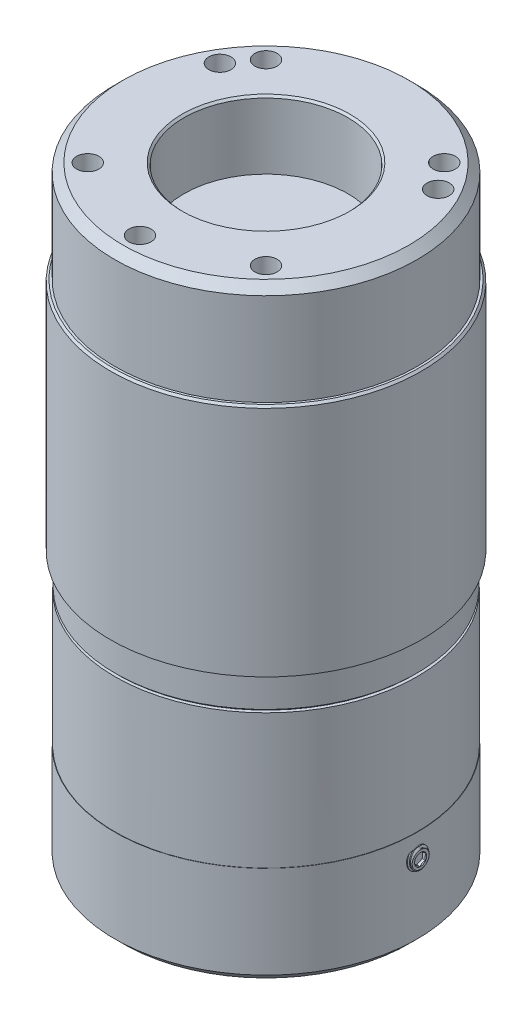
ISO-10303-21;
HEADER;
FILE_DESCRIPTION(('STEP AP214'),'2;1');
FILE_NAME('part.step','',(''),(''),'','','');
FILE_SCHEMA(('AUTOMOTIVE_DESIGN { 1 0 10303 214 1 1 1 1 }'));
ENDSEC;
DATA;
#1=APPLICATION_CONTEXT('core data for automotive mechanical design processes');
#2=APPLICATION_PROTOCOL_DEFINITION('international standard','automotive_design',2000,#1);
#3=PRODUCT_CONTEXT('',#1,'mechanical');
#4=PRODUCT('Part','Part','',(#3));
#5=PRODUCT_RELATED_PRODUCT_CATEGORY('part','',(#4));
#6=PRODUCT_DEFINITION_FORMATION('','',#4);
#7=PRODUCT_DEFINITION_CONTEXT('part definition',#1,'design');
#8=PRODUCT_DEFINITION('design','',#6,#7);
#9=PRODUCT_DEFINITION_SHAPE('','',#8);
#10=(LENGTH_UNIT() NAMED_UNIT(*) SI_UNIT(.MILLI.,.METRE.));
#11=(NAMED_UNIT(*) PLANE_ANGLE_UNIT() SI_UNIT($,.RADIAN.));
#12=(NAMED_UNIT(*) SI_UNIT($,.STERADIAN.) SOLID_ANGLE_UNIT());
#13=UNCERTAINTY_MEASURE_WITH_UNIT(LENGTH_MEASURE(1.E-05),#10,'distance_accuracy_value','');
#14=(GEOMETRIC_REPRESENTATION_CONTEXT(3) GLOBAL_UNCERTAINTY_ASSIGNED_CONTEXT((#13)) GLOBAL_UNIT_ASSIGNED_CONTEXT((#10,
#11,#12)) REPRESENTATION_CONTEXT('',''));
#15=CARTESIAN_POINT('',(0.,0.,0.));
#16=DIRECTION('',(0.,0.,1.));
#17=DIRECTION('',(1.,0.,0.));
#18=AXIS2_PLACEMENT_3D('',#15,#16,#17);
#19=CARTESIAN_POINT('',(-23.549613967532,31.877,-17.5588206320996));
#20=DIRECTION('',(0.,-1.,0.));
#21=DIRECTION('',(-0.597745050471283,0.,0.801686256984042));
#22=AXIS2_PLACEMENT_3D('',#19,#20,#21);
#23=PLANE('',#22);
#24=CARTESIAN_POINT('',(0.,31.877,-6.11930390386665E-13));
#25=DIRECTION('',(0.,1.,0.));
#26=DIRECTION('',(0.597745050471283,0.,-0.801686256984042));
#27=AXIS2_PLACEMENT_3D('',#24,#25,#26);
#28=CIRCLE('',#27,28.448);
#29=CARTESIAN_POINT('',(17.004651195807,31.877,-22.8063706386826));
#30=VERTEX_POINT('',#29);
#31=EDGE_CURVE('P0_E42',#30,#30,#28,.T.);
#32=ORIENTED_EDGE('',*,*,#31,.T.);
#33=EDGE_LOOP('',(#32));
#34=FACE_BOUND('',#33,.T.);
#35=CARTESIAN_POINT('',(0.,31.877,-6.11930390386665E-13));
#36=DIRECTION('',(0.,1.,0.));
#37=DIRECTION('',(0.597745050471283,0.,-0.801686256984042));
#38=AXIS2_PLACEMENT_3D('',#35,#36,#37);
#39=CIRCLE('',#38,29.3751);
#40=CARTESIAN_POINT('',(17.558820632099,31.877,-23.5496139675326));
#41=VERTEX_POINT('',#40);
#42=EDGE_CURVE('P0_E45',#41,#41,#39,.T.);
#43=ORIENTED_EDGE('',*,*,#42,.F.);
#44=EDGE_LOOP('',(#43));
#45=FACE_BOUND('',#44,.T.);
#46=ADVANCED_FACE('P0_F14',(#34,#45),#23,.T.);
#47=CARTESIAN_POINT('',(0.,76.2,-6.24465560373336E-13));
#48=DIRECTION('',(0.,1.,0.));
#49=DIRECTION('',(0.597745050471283,0.,-0.801686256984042));
#50=AXIS2_PLACEMENT_3D('',#47,#48,#49);
#51=CYLINDRICAL_SURFACE('',#50,28.448);
#52=CARTESIAN_POINT('',(0.,25.908,-6.10242272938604E-13));
#53=DIRECTION('',(0.,-1.,0.));
#54=DIRECTION('',(-0.597745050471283,0.,0.801686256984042));
#55=AXIS2_PLACEMENT_3D('',#52,#53,#54);
#56=CIRCLE('',#55,28.448);
#57=CARTESIAN_POINT('',(17.004651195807,25.908,-22.8063706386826));
#58=VERTEX_POINT('',#57);
#59=EDGE_CURVE('P0_E22',#58,#58,#56,.F.);
#60=ORIENTED_EDGE('',*,*,#59,.T.);
#61=EDGE_LOOP('',(#60));
#62=FACE_BOUND('',#61,.T.);
#63=ORIENTED_EDGE('',*,*,#31,.F.);
#64=EDGE_LOOP('',(#63));
#65=FACE_BOUND('',#64,.T.);
#66=ADVANCED_FACE('P0_F175',(#62,#65),#51,.T.);
#67=CARTESIAN_POINT('',(-21.7882290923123,25.527,-16.2455149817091));
#68=DIRECTION('',(0.,-1.,0.));
#69=DIRECTION('',(-0.597745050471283,0.,0.801686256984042));
#70=AXIS2_PLACEMENT_3D('',#67,#68,#69);
#71=PLANE('',#70);
#72=CARTESIAN_POINT('',(0.,25.527,-6.10134520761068E-13));
#73=DIRECTION('',(0.,-1.,0.));
#74=DIRECTION('',(-0.597745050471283,0.,0.801686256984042));
#75=AXIS2_PLACEMENT_3D('',#72,#73,#74);
#76=CIRCLE('',#75,28.067);
#77=CARTESIAN_POINT('',(16.7769103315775,25.527,-22.5009281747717));
#78=VERTEX_POINT('',#77);
#79=EDGE_CURVE('P0_E10',#78,#78,#76,.T.);
#80=ORIENTED_EDGE('',*,*,#79,.T.);
#81=EDGE_LOOP('',(#80));
#82=FACE_BOUND('',#81,.T.);
#83=ADVANCED_FACE('P0_F181',(#82),#71,.T.);
#84=CARTESIAN_POINT('',(-18.4283619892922,76.2,-13.740365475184));
#85=DIRECTION('',(0.,1.,0.));
#86=DIRECTION('',(0.597745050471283,0.,-0.801686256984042));
#87=AXIS2_PLACEMENT_3D('',#84,#85,#86);
#88=PLANE('',#87);
#89=CARTESIAN_POINT('',(0.,76.2,0.));
#90=DIRECTION('',(0.,1.,0.));
#91=DIRECTION('',(-1.,0.,0.));
#92=AXIS2_PLACEMENT_3D('',#89,#90,#91);
#93=CIRCLE('',#92,28.575);
#94=CARTESIAN_POINT('',(28.575,76.2,0.));
#95=VERTEX_POINT('',#94);
#96=EDGE_CURVE('P0_E57',#95,#95,#93,.T.);
#97=ORIENTED_EDGE('',*,*,#96,.F.);
#98=EDGE_LOOP('',(#97));
#99=FACE_BOUND('',#98,.T.);
#100=CARTESIAN_POINT('',(0.,76.2,-6.24465560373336E-13));
#101=DIRECTION('',(0.,1.,0.));
#102=DIRECTION('',(0.597745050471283,0.,-0.801686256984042));
#103=AXIS2_PLACEMENT_3D('',#100,#101,#102);
#104=CIRCLE('',#103,28.9941);
#105=CARTESIAN_POINT('',(-17.3310797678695,76.2,23.2441715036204));
#106=VERTEX_POINT('',#105);
#107=EDGE_CURVE('P0_E37',#106,#106,#104,.T.);
#108=ORIENTED_EDGE('',*,*,#107,.T.);
#109=EDGE_LOOP('',(#108));
#110=FACE_BOUND('',#109,.T.);
#111=ADVANCED_FACE('P0_F194',(#99,#110),#88,.T.);
#112=CARTESIAN_POINT('',(0.,76.2,-6.24465560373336E-13));
#113=DIRECTION('',(0.,1.,0.));
#114=DIRECTION('',(0.597745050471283,0.,-0.801686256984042));
#115=AXIS2_PLACEMENT_3D('',#112,#113,#114);
#116=CYLINDRICAL_SURFACE('',#115,29.3751);
#117=CARTESIAN_POINT('',(0.,75.819,-6.243578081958E-13));
#118=DIRECTION('',(0.,1.,0.));
#119=DIRECTION('',(0.597745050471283,0.,-0.801686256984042));
#120=AXIS2_PLACEMENT_3D('',#117,#118,#119);
#121=CIRCLE('',#120,29.3751);
#122=CARTESIAN_POINT('',(-17.558820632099,75.819,23.5496139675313));
#123=VERTEX_POINT('',#122);
#124=EDGE_CURVE('P0_E30',#123,#123,#121,.F.);
#125=ORIENTED_EDGE('',*,*,#124,.T.);
#126=EDGE_LOOP('',(#125));
#127=FACE_BOUND('',#126,.T.);
#128=ORIENTED_EDGE('',*,*,#42,.T.);
#129=EDGE_LOOP('',(#128));
#130=FACE_BOUND('',#129,.T.);
#131=ADVANCED_FACE('P0_F187',(#127,#130),#116,.T.);
#132=CARTESIAN_POINT('',(0.,76.2,-6.24465560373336E-13));
#133=DIRECTION('',(0.,-1.,0.));
#134=DIRECTION('',(-0.597745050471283,0.,0.801686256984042));
#135=AXIS2_PLACEMENT_3D('',#132,#133,#134);
#136=CONICAL_SURFACE('',#135,28.9941,0.785398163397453);
#137=CARTESIAN_POINT('',(-17.558820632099,75.819,23.5496139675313));
#138=CARTESIAN_POINT('',(-17.55644833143,75.82296875,23.5464322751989));
#139=CARTESIAN_POINT('',(-17.5540760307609,75.8269375,23.5432505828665));
#140=CARTESIAN_POINT('',(-17.5493314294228,75.834875,23.5368871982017));
#141=CARTESIAN_POINT('',(-17.5469591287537,75.83884375,23.5337055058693));
#142=CARTESIAN_POINT('',(-17.5422145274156,75.84678125,23.5273421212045));
#143=CARTESIAN_POINT('',(-17.5398422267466,75.85075,23.5241604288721));
#144=CARTESIAN_POINT('',(-17.5350976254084,75.8586875,23.5177970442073));
#145=CARTESIAN_POINT('',(-17.5327253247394,75.86265625,23.5146153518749));
#146=CARTESIAN_POINT('',(-17.5279807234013,75.87059375,23.5082519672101));
#147=CARTESIAN_POINT('',(-17.5256084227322,75.8745625,23.5050702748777));
#148=CARTESIAN_POINT('',(-17.5208638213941,75.8825,23.4987068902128));
#149=CARTESIAN_POINT('',(-17.518491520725,75.88646875,23.4955251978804));
#150=CARTESIAN_POINT('',(-17.5137469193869,75.89440625,23.4891618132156));
#151=CARTESIAN_POINT('',(-17.5113746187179,75.898375,23.4859801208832));
#152=CARTESIAN_POINT('',(-17.5066300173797,75.9063125,23.4796167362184));
#153=CARTESIAN_POINT('',(-17.5042577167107,75.91028125,23.476435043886));
#154=CARTESIAN_POINT('',(-17.4995131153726,75.91821875,23.4700716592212));
#155=CARTESIAN_POINT('',(-17.4971408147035,75.9221875,23.4668899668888));
#156=CARTESIAN_POINT('',(-17.4923962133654,75.930125,23.460526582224));
#157=CARTESIAN_POINT('',(-17.4900239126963,75.93409375,23.4573448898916));
#158=CARTESIAN_POINT('',(-17.4852793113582,75.94203125,23.4509815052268));
#159=CARTESIAN_POINT('',(-17.4829070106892,75.946,23.4477998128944));
#160=CARTESIAN_POINT('',(-17.478162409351,75.9539375,23.4414364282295));
#161=CARTESIAN_POINT('',(-17.475790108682,75.95790625,23.4382547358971));
#162=CARTESIAN_POINT('',(-17.4710455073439,75.96584375,23.4318913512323));
#163=CARTESIAN_POINT('',(-17.4686732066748,75.9698125,23.4287096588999));
#164=CARTESIAN_POINT('',(-17.4639286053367,75.97775,23.4223462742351));
#165=CARTESIAN_POINT('',(-17.4615563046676,75.98171875,23.4191645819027));
#166=CARTESIAN_POINT('',(-17.4568117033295,75.98965625,23.4128011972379));
#167=CARTESIAN_POINT('',(-17.4544394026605,75.993625,23.4096195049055));
#168=CARTESIAN_POINT('',(-17.4496948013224,76.0015625,23.4032561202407));
#169=CARTESIAN_POINT('',(-17.4473225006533,76.00553125,23.4000744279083));
#170=CARTESIAN_POINT('',(-17.4425778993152,76.01346875,23.3937110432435));
#171=CARTESIAN_POINT('',(-17.4402055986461,76.0174375,23.3905293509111));
#172=CARTESIAN_POINT('',(-17.435460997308,76.025375,23.3841659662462));
#173=CARTESIAN_POINT('',(-17.4330886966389,76.02934375,23.3809842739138));
#174=CARTESIAN_POINT('',(-17.4283440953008,76.03728125,23.374620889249));
#175=CARTESIAN_POINT('',(-17.4259717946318,76.04125,23.3714391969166));
#176=CARTESIAN_POINT('',(-17.4212271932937,76.0491875,23.3650758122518));
#177=CARTESIAN_POINT('',(-17.4188548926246,76.05315625,23.3618941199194));
#178=CARTESIAN_POINT('',(-17.4141102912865,76.06109375,23.3555307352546));
#179=CARTESIAN_POINT('',(-17.4117379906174,76.0650625,23.3523490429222));
#180=CARTESIAN_POINT('',(-17.4069933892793,76.073,23.3459856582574));
#181=CARTESIAN_POINT('',(-17.4046210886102,76.07696875,23.342803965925));
#182=CARTESIAN_POINT('',(-17.3998764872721,76.08490625,23.3364405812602));
#183=CARTESIAN_POINT('',(-17.3975041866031,76.088875,23.3332588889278));
#184=CARTESIAN_POINT('',(-17.392759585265,76.0968125,23.3268955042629));
#185=CARTESIAN_POINT('',(-17.3903872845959,76.10078125,23.3237138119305));
#186=CARTESIAN_POINT('',(-17.3856426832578,76.10871875,23.3173504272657));
#187=CARTESIAN_POINT('',(-17.3832703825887,76.1126875,23.3141687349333));
#188=CARTESIAN_POINT('',(-17.3785257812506,76.120625,23.3078053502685));
#189=CARTESIAN_POINT('',(-17.3761534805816,76.12459375,23.3046236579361));
#190=CARTESIAN_POINT('',(-17.3714088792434,76.13253125,23.2982602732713));
#191=CARTESIAN_POINT('',(-17.3690365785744,76.1365,23.2950785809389));
#192=CARTESIAN_POINT('',(-17.3642919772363,76.1444375,23.2887151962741));
#193=CARTESIAN_POINT('',(-17.3619196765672,76.14840625,23.2855335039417));
#194=CARTESIAN_POINT('',(-17.3571750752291,76.15634375,23.2791701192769));
#195=CARTESIAN_POINT('',(-17.35480277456,76.1603125,23.2759884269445));
#196=CARTESIAN_POINT('',(-17.3500581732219,76.16825,23.2696250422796));
#197=CARTESIAN_POINT('',(-17.3476858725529,76.17221875,23.2664433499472));
#198=CARTESIAN_POINT('',(-17.3429412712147,76.18015625,23.2600799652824));
#199=CARTESIAN_POINT('',(-17.3405689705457,76.184125,23.25689827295));
#200=CARTESIAN_POINT('',(-17.3358243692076,76.1920625,23.2505348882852));
#201=CARTESIAN_POINT('',(-17.3334520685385,76.19603125,23.2473531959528));
#202=CARTESIAN_POINT('',(-17.3310797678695,76.2,23.2441715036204));
#203=B_SPLINE_CURVE_WITH_KNOTS('',3,(#137,#138,#139,#140,#141,#142,#143,#144,#145,#146,#147,
#148,#149,#150,#151,#152,#153,#154,#155,#156,#157,#158,#159,#160,#161,#162,#163,#164,#165,#166,
#167,#168,#169,#170,#171,#172,#173,#174,#175,#176,#177,#178,#179,#180,#181,#182,#183,#184,#185,
#186,#187,#188,#189,#190,#191,#192,#193,#194,#195,#196,#197,#198,#199,#200,#201,#202),
.UNSPECIFIED.,.F.,.F.,(4,2,2,2,2,2,2,2,2,2,2,2,2,2,2,2,2,2,2,2,2,2,2,2,2,2,2,2,2,2,2,2,4),(0.,
0.0168379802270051,0.0336759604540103,0.050513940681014,0.0673519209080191,0.0841899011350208,
0.101027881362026,0.117865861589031,0.134703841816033,0.15154182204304,0.168379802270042,
0.185217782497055,0.202055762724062,0.218893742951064,0.235731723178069,0.252569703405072,
0.269407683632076,0.286245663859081,0.303083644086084,0.31992162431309,0.336759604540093,
0.353597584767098,0.370435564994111,0.387273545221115,0.40411152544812,0.420949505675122,
0.437787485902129,0.454625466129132,0.471463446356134,0.488301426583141,0.505139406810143,
0.521977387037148,0.538815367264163),.UNSPECIFIED.);
#204=EDGE_CURVE('P0_BSEAM185',#123,#106,#203,.T.);
#205=ORIENTED_EDGE('',*,*,#124,.F.);
#206=ORIENTED_EDGE('',*,*,#107,.F.);
#207=ORIENTED_EDGE('',*,*,#204,.T.);
#208=ORIENTED_EDGE('',*,*,#204,.F.);
#209=EDGE_LOOP('',(#205,#207,#206,#208));
#210=FACE_BOUND('',#209,.T.);
#211=ADVANCED_FACE('P0_F185',(#210),#136,.T.);
#212=CARTESIAN_POINT('',(0.,25.908,-6.10242272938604E-13));
#213=DIRECTION('',(0.,1.,0.));
#214=DIRECTION('',(0.597745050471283,0.,-0.801686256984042));
#215=AXIS2_PLACEMENT_3D('',#212,#213,#214);
#216=CONICAL_SURFACE('',#215,28.448,0.785398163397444);
#217=CARTESIAN_POINT('',(16.7769103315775,25.527,-22.5009281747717));
#218=CARTESIAN_POINT('',(16.7792826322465,25.53096875,-22.5041098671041));
#219=CARTESIAN_POINT('',(16.7816549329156,25.5349375,-22.5072915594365));
#220=CARTESIAN_POINT('',(16.7863995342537,25.542875,-22.5136549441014));
#221=CARTESIAN_POINT('',(16.7887718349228,25.54684375,-22.5168366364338));
#222=CARTESIAN_POINT('',(16.7935164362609,25.55478125,-22.5232000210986));
#223=CARTESIAN_POINT('',(16.7958887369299,25.55875,-22.526381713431));
#224=CARTESIAN_POINT('',(16.8006333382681,25.5666875,-22.5327450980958));
#225=CARTESIAN_POINT('',(16.8030056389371,25.57065625,-22.5359267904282));
#226=CARTESIAN_POINT('',(16.8077502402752,25.57859375,-22.542290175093));
#227=CARTESIAN_POINT('',(16.8101225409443,25.5825625,-22.5454718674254));
#228=CARTESIAN_POINT('',(16.8148671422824,25.5905,-22.5518352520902));
#229=CARTESIAN_POINT('',(16.8172394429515,25.59446875,-22.5550169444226));
#230=CARTESIAN_POINT('',(16.8219840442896,25.60240625,-22.5613803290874));
#231=CARTESIAN_POINT('',(16.8243563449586,25.606375,-22.5645620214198));
#232=CARTESIAN_POINT('',(16.8291009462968,25.6143125,-22.5709254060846));
#233=CARTESIAN_POINT('',(16.8314732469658,25.61828125,-22.5741070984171));
#234=CARTESIAN_POINT('',(16.8362178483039,25.62621875,-22.5804704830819));
#235=CARTESIAN_POINT('',(16.838590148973,25.6301875,-22.5836521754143));
#236=CARTESIAN_POINT('',(16.8433347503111,25.638125,-22.5900155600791));
#237=CARTESIAN_POINT('',(16.8457070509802,25.64209375,-22.5931972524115));
#238=CARTESIAN_POINT('',(16.8504516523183,25.65003125,-22.5995606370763));
#239=CARTESIAN_POINT('',(16.8528239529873,25.654,-22.6027423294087));
#240=CARTESIAN_POINT('',(16.8575685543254,25.6619375,-22.6091057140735));
#241=CARTESIAN_POINT('',(16.8599408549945,25.66590625,-22.6122874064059));
#242=CARTESIAN_POINT('',(16.8646854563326,25.67384375,-22.6186507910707));
#243=CARTESIAN_POINT('',(16.8670577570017,25.6778125,-22.6218324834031));
#244=CARTESIAN_POINT('',(16.8718023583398,25.68575,-22.6281958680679));
#245=CARTESIAN_POINT('',(16.8741746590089,25.68971875,-22.6313775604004));
#246=CARTESIAN_POINT('',(16.878919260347,25.69765625,-22.6377409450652));
#247=CARTESIAN_POINT('',(16.881291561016,25.701625,-22.6409226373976));
#248=CARTESIAN_POINT('',(16.8860361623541,25.7095625,-22.6472860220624));
#249=CARTESIAN_POINT('',(16.8884084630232,25.71353125,-22.6504677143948));
#250=CARTESIAN_POINT('',(16.8931530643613,25.72146875,-22.6568310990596));
#251=CARTESIAN_POINT('',(16.8955253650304,25.7254375,-22.660012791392));
#252=CARTESIAN_POINT('',(16.9002699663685,25.733375,-22.6663761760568));
#253=CARTESIAN_POINT('',(16.9026422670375,25.73734375,-22.6695578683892));
#254=CARTESIAN_POINT('',(16.9073868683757,25.74528125,-22.675921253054));
#255=CARTESIAN_POINT('',(16.9097591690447,25.74925,-22.6791029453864));
#256=CARTESIAN_POINT('',(16.9145037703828,25.7571875,-22.6854663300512));
#257=CARTESIAN_POINT('',(16.9168760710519,25.76115625,-22.6886480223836));
#258=CARTESIAN_POINT('',(16.92162067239,25.76909375,-22.6950114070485));
#259=CARTESIAN_POINT('',(16.9239929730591,25.7730625,-22.6981930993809));
#260=CARTESIAN_POINT('',(16.9287375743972,25.781,-22.7045564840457));
#261=CARTESIAN_POINT('',(16.9311098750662,25.78496875,-22.7077381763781));
#262=CARTESIAN_POINT('',(16.9358544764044,25.79290625,-22.7141015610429));
#263=CARTESIAN_POINT('',(16.9382267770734,25.796875,-22.7172832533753));
#264=CARTESIAN_POINT('',(16.9429713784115,25.8048125,-22.7236466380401));
#265=CARTESIAN_POINT('',(16.9453436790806,25.80878125,-22.7268283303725));
#266=CARTESIAN_POINT('',(16.9500882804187,25.81671875,-22.7331917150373));
#267=CARTESIAN_POINT('',(16.9524605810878,25.8206875,-22.7363734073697));
#268=CARTESIAN_POINT('',(16.9572051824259,25.828625,-22.7427367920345));
#269=CARTESIAN_POINT('',(16.9595774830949,25.83259375,-22.7459184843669));
#270=CARTESIAN_POINT('',(16.9643220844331,25.84053125,-22.7522818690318));
#271=CARTESIAN_POINT('',(16.9666943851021,25.8445,-22.7554635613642));
#272=CARTESIAN_POINT('',(16.9714389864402,25.8524375,-22.761826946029));
#273=CARTESIAN_POINT('',(16.9738112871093,25.85640625,-22.7650086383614));
#274=CARTESIAN_POINT('',(16.9785558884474,25.86434375,-22.7713720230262));
#275=CARTESIAN_POINT('',(16.9809281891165,25.8683125,-22.7745537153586));
#276=CARTESIAN_POINT('',(16.9856727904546,25.87625,-22.7809171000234));
#277=CARTESIAN_POINT('',(16.9880450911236,25.88021875,-22.7840987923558));
#278=CARTESIAN_POINT('',(16.9927896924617,25.88815625,-22.7904621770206));
#279=CARTESIAN_POINT('',(16.9951619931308,25.892125,-22.793643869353));
#280=CARTESIAN_POINT('',(16.9999065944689,25.9000625,-22.8000072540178));
#281=CARTESIAN_POINT('',(17.002278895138,25.90403125,-22.8031889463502));
#282=CARTESIAN_POINT('',(17.004651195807,25.908,-22.8063706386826));
#283=B_SPLINE_CURVE_WITH_KNOTS('',3,(#217,#218,#219,#220,#221,#222,#223,#224,#225,#226,#227,
#228,#229,#230,#231,#232,#233,#234,#235,#236,#237,#238,#239,#240,#241,#242,#243,#244,#245,#246,
#247,#248,#249,#250,#251,#252,#253,#254,#255,#256,#257,#258,#259,#260,#261,#262,#263,#264,#265,
#266,#267,#268,#269,#270,#271,#272,#273,#274,#275,#276,#277,#278,#279,#280,#281,#282),
.UNSPECIFIED.,.F.,.F.,(4,2,2,2,2,2,2,2,2,2,2,2,2,2,2,2,2,2,2,2,2,2,2,2,2,2,2,2,2,2,2,2,4),(0.,
0.0168379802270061,0.0336759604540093,0.0505139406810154,0.0673519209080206,0.0841899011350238,
0.101027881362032,0.117865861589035,0.134703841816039,0.151541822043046,0.168379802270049,
0.185217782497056,0.202055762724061,0.218893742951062,0.23573172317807,0.252569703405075,
0.269407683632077,0.286245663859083,0.303083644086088,0.319921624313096,0.336759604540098,
0.353597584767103,0.370435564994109,0.387273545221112,0.40411152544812,0.420949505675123,
0.437787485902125,0.454625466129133,0.471463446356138,0.48830142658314,0.505139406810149,
0.521977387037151,0.538815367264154),.UNSPECIFIED.);
#284=EDGE_CURVE('P0_BSEAM16',#78,#58,#283,.T.);
#285=ORIENTED_EDGE('',*,*,#79,.F.);
#286=ORIENTED_EDGE('',*,*,#59,.F.);
#287=ORIENTED_EDGE('',*,*,#284,.T.);
#288=ORIENTED_EDGE('',*,*,#284,.F.);
#289=EDGE_LOOP('',(#285,#287,#286,#288));
#290=FACE_BOUND('',#289,.T.);
#291=ADVANCED_FACE('P0_F16',(#290),#216,.T.);
#292=CARTESIAN_POINT('',(0.,95.25,0.));
#293=DIRECTION('',(0.,-1.,0.));
#294=DIRECTION('',(1.,0.,0.));
#295=AXIS2_PLACEMENT_3D('',#292,#293,#294);
#296=CYLINDRICAL_SURFACE('',#295,28.575);
#297=CARTESIAN_POINT('',(0.,93.6752,0.));
#298=DIRECTION('',(0.,1.,0.));
#299=DIRECTION('',(-1.,0.,0.));
#300=AXIS2_PLACEMENT_3D('',#297,#298,#299);
#301=CIRCLE('',#300,28.575);
#302=CARTESIAN_POINT('',(28.575,93.6752,0.));
#303=VERTEX_POINT('',#302);
#304=EDGE_CURVE('P0_E49',#303,#303,#301,.F.);
#305=CARTESIAN_POINT('',(28.575,93.6752,0.));
#306=CARTESIAN_POINT('',(28.575,93.4931666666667,0.));
#307=CARTESIAN_POINT('',(28.575,93.3111333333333,0.));
#308=CARTESIAN_POINT('',(28.575,92.9470666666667,0.));
#309=CARTESIAN_POINT('',(28.575,92.7650333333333,0.));
#310=CARTESIAN_POINT('',(28.575,92.4009666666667,0.));
#311=CARTESIAN_POINT('',(28.575,92.2189333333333,0.));
#312=CARTESIAN_POINT('',(28.575,91.8548666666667,0.));
#313=CARTESIAN_POINT('',(28.575,91.6728333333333,0.));
#314=CARTESIAN_POINT('',(28.575,91.3087666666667,0.));
#315=CARTESIAN_POINT('',(28.575,91.1267333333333,0.));
#316=CARTESIAN_POINT('',(28.575,90.7626666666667,0.));
#317=CARTESIAN_POINT('',(28.575,90.5806333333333,0.));
#318=CARTESIAN_POINT('',(28.575,90.2165666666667,0.));
#319=CARTESIAN_POINT('',(28.575,90.0345333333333,0.));
#320=CARTESIAN_POINT('',(28.575,89.6704666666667,0.));
#321=CARTESIAN_POINT('',(28.575,89.4884333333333,0.));
#322=CARTESIAN_POINT('',(28.575,89.1243666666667,0.));
#323=CARTESIAN_POINT('',(28.575,88.9423333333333,0.));
#324=CARTESIAN_POINT('',(28.575,88.5782666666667,0.));
#325=CARTESIAN_POINT('',(28.575,88.3962333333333,0.));
#326=CARTESIAN_POINT('',(28.575,88.0321666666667,0.));
#327=CARTESIAN_POINT('',(28.575,87.8501333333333,0.));
#328=CARTESIAN_POINT('',(28.575,87.4860666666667,0.));
#329=CARTESIAN_POINT('',(28.575,87.3040333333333,0.));
#330=CARTESIAN_POINT('',(28.575,86.9399666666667,0.));
#331=CARTESIAN_POINT('',(28.575,86.7579333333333,0.));
#332=CARTESIAN_POINT('',(28.575,86.3938666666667,0.));
#333=CARTESIAN_POINT('',(28.575,86.2118333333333,0.));
#334=CARTESIAN_POINT('',(28.575,85.8477666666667,0.));
#335=CARTESIAN_POINT('',(28.575,85.6657333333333,0.));
#336=CARTESIAN_POINT('',(28.575,85.3016666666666,0.));
#337=CARTESIAN_POINT('',(28.575,85.1196333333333,0.));
#338=CARTESIAN_POINT('',(28.575,84.7555666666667,0.));
#339=CARTESIAN_POINT('',(28.575,84.5735333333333,0.));
#340=CARTESIAN_POINT('',(28.575,84.2094666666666,0.));
#341=CARTESIAN_POINT('',(28.575,84.0274333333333,0.));
#342=CARTESIAN_POINT('',(28.575,83.6633666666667,0.));
#343=CARTESIAN_POINT('',(28.575,83.4813333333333,0.));
#344=CARTESIAN_POINT('',(28.575,83.1172666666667,0.));
#345=CARTESIAN_POINT('',(28.575,82.9352333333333,0.));
#346=CARTESIAN_POINT('',(28.575,82.5711666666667,0.));
#347=CARTESIAN_POINT('',(28.575,82.3891333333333,0.));
#348=CARTESIAN_POINT('',(28.575,82.0250666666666,0.));
#349=CARTESIAN_POINT('',(28.575,81.8430333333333,0.));
#350=CARTESIAN_POINT('',(28.575,81.4789666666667,0.));
#351=CARTESIAN_POINT('',(28.575,81.2969333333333,0.));
#352=CARTESIAN_POINT('',(28.575,80.9328666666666,0.));
#353=CARTESIAN_POINT('',(28.575,80.7508333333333,0.));
#354=CARTESIAN_POINT('',(28.575,80.3867666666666,0.));
#355=CARTESIAN_POINT('',(28.575,80.2047333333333,0.));
#356=CARTESIAN_POINT('',(28.575,79.8406666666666,0.));
#357=CARTESIAN_POINT('',(28.575,79.6586333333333,0.));
#358=CARTESIAN_POINT('',(28.575,79.2945666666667,0.));
#359=CARTESIAN_POINT('',(28.575,79.1125333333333,0.));
#360=CARTESIAN_POINT('',(28.575,78.7484666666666,0.));
#361=CARTESIAN_POINT('',(28.575,78.5664333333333,0.));
#362=CARTESIAN_POINT('',(28.575,78.2023666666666,0.));
#363=CARTESIAN_POINT('',(28.575,78.0203333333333,0.));
#364=CARTESIAN_POINT('',(28.575,77.6562666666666,0.));
#365=CARTESIAN_POINT('',(28.575,77.4742333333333,0.));
#366=CARTESIAN_POINT('',(28.575,77.1101666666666,0.));
#367=CARTESIAN_POINT('',(28.575,76.9281333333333,0.));
#368=CARTESIAN_POINT('',(28.575,76.5640666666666,0.));
#369=CARTESIAN_POINT('',(28.575,76.3820333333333,0.));
#370=CARTESIAN_POINT('',(28.575,76.2,0.));
#371=B_SPLINE_CURVE_WITH_KNOTS('',3,(#305,#306,#307,#308,#309,#310,#311,#312,#313,#314,#315,
#316,#317,#318,#319,#320,#321,#322,#323,#324,#325,#326,#327,#328,#329,#330,#331,#332,#333,#334,
#335,#336,#337,#338,#339,#340,#341,#342,#343,#344,#345,#346,#347,#348,#349,#350,#351,#352,#353,
#354,#355,#356,#357,#358,#359,#360,#361,#362,#363,#364,#365,#366,#367,#368,#369,#370),
.UNSPECIFIED.,.F.,.F.,(4,2,2,2,2,2,2,2,2,2,2,2,2,2,2,2,2,2,2,2,2,2,2,2,2,2,2,2,2,2,2,2,4),(0.,
0.546100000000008,1.0922,1.63830000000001,2.1844,2.73050000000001,3.2766,3.82270000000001,
4.36880000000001,4.91490000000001,5.46100000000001,6.00710000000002,6.55320000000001,
7.09930000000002,7.64540000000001,8.19150000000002,8.73760000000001,9.28370000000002,
9.82980000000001,10.3759,10.922,11.4681,12.0142,12.5603,13.1064,13.6525,14.1986,14.7447,15.2908,
15.8369,16.383,16.9291,17.4752),.UNSPECIFIED.);
#372=EDGE_CURVE('P0_BSEAM147',#303,#95,#371,.T.);
#373=ORIENTED_EDGE('',*,*,#304,.T.);
#374=ORIENTED_EDGE('',*,*,#96,.T.);
#375=ORIENTED_EDGE('',*,*,#372,.T.);
#376=ORIENTED_EDGE('',*,*,#372,.F.);
#377=EDGE_LOOP('',(#373,#375,#374,#376));
#378=FACE_BOUND('',#377,.T.);
#379=ADVANCED_FACE('P0_F147',(#378),#296,.T.);
#380=CARTESIAN_POINT('',(0.,95.25,0.));
#381=DIRECTION('',(0.,1.,0.));
#382=DIRECTION('',(-1.,0.,0.));
#383=AXIS2_PLACEMENT_3D('',#380,#381,#382);
#384=PLANE('',#383);
#385=CARTESIAN_POINT('',(16.8379802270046,95.25,16.8379802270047));
#386=DIRECTION('',(0.,1.,0.));
#387=DIRECTION('',(-1.,0.,0.));
#388=AXIS2_PLACEMENT_3D('',#385,#386,#387);
#389=CIRCLE('',#388,2.09999999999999);
#390=CARTESIAN_POINT('',(14.7379802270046,95.25,16.8379802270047));
#391=VERTEX_POINT('',#390);
#392=EDGE_CURVE('P0_E98',#391,#391,#389,.T.);
#393=ORIENTED_EDGE('',*,*,#392,.F.);
#394=EDGE_LOOP('',(#393));
#395=FACE_BOUND('',#394,.T.);
#396=CARTESIAN_POINT('',(16.8379802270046,95.25,-16.8379802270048));
#397=DIRECTION('',(0.,1.,0.));
#398=DIRECTION('',(-1.,0.,0.));
#399=AXIS2_PLACEMENT_3D('',#396,#397,#398);
#400=CIRCLE('',#399,2.09999999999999);
#401=CARTESIAN_POINT('',(14.7379802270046,95.25,-16.8379802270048));
#402=VERTEX_POINT('',#401);
#403=EDGE_CURVE('P0_E107',#402,#402,#400,.T.);
#404=ORIENTED_EDGE('',*,*,#403,.F.);
#405=EDGE_LOOP('',(#404));
#406=FACE_BOUND('',#405,.T.);
#407=CARTESIAN_POINT('',(-16.8379802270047,95.25,-16.8379802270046));
#408=DIRECTION('',(0.,1.,0.));
#409=DIRECTION('',(-1.,0.,0.));
#410=AXIS2_PLACEMENT_3D('',#407,#408,#409);
#411=CIRCLE('',#410,2.09999999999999);
#412=CARTESIAN_POINT('',(-18.9379802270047,95.25,-16.8379802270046));
#413=VERTEX_POINT('',#412);
#414=EDGE_CURVE('P0_E115',#413,#413,#411,.T.);
#415=ORIENTED_EDGE('',*,*,#414,.F.);
#416=EDGE_LOOP('',(#415));
#417=FACE_BOUND('',#416,.T.);
#418=CARTESIAN_POINT('',(-16.8379802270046,95.25,16.8379802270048));
#419=DIRECTION('',(0.,1.,0.));
#420=DIRECTION('',(-1.,0.,0.));
#421=AXIS2_PLACEMENT_3D('',#418,#419,#420);
#422=CIRCLE('',#421,2.09999999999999);
#423=CARTESIAN_POINT('',(-18.9379802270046,95.25,16.8379802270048));
#424=VERTEX_POINT('',#423);
#425=EDGE_CURVE('P0_E83',#424,#424,#422,.T.);
#426=ORIENTED_EDGE('',*,*,#425,.F.);
#427=EDGE_LOOP('',(#426));
#428=FACE_BOUND('',#427,.T.);
#429=CARTESIAN_POINT('',(20.6222299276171,95.25,-11.9062499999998));
#430=DIRECTION('',(0.,1.,0.));
#431=DIRECTION('',(-1.,0.,0.));
#432=AXIS2_PLACEMENT_3D('',#429,#430,#431);
#433=CIRCLE('',#432,2.09999999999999);
#434=CARTESIAN_POINT('',(18.5222299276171,95.25,-11.9062499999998));
#435=VERTEX_POINT('',#434);
#436=EDGE_CURVE('P0_E74',#435,#435,#433,.T.);
#437=ORIENTED_EDGE('',*,*,#436,.F.);
#438=EDGE_LOOP('',(#437));
#439=FACE_BOUND('',#438,.T.);
#440=CARTESIAN_POINT('',(-20.6222299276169,95.25,-11.9062500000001));
#441=DIRECTION('',(0.,1.,0.));
#442=DIRECTION('',(-1.,0.,0.));
#443=AXIS2_PLACEMENT_3D('',#440,#441,#442);
#444=CIRCLE('',#443,2.09999999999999);
#445=CARTESIAN_POINT('',(-22.7222299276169,95.25,-11.9062500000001));
#446=VERTEX_POINT('',#445);
#447=EDGE_CURVE('P0_E84',#446,#446,#444,.T.);
#448=ORIENTED_EDGE('',*,*,#447,.F.);
#449=EDGE_LOOP('',(#448));
#450=FACE_BOUND('',#449,.T.);
#451=CARTESIAN_POINT('',(0.,95.25,23.8125));
#452=DIRECTION('',(0.,1.,0.));
#453=DIRECTION('',(-1.,0.,0.));
#454=AXIS2_PLACEMENT_3D('',#451,#452,#453);
#455=CIRCLE('',#454,2.09999999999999);
#456=CARTESIAN_POINT('',(-2.09999999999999,95.25,23.8125));
#457=VERTEX_POINT('',#456);
#458=EDGE_CURVE('P0_E73',#457,#457,#455,.T.);
#459=ORIENTED_EDGE('',*,*,#458,.F.);
#460=EDGE_LOOP('',(#459));
#461=FACE_BOUND('',#460,.T.);
#462=CARTESIAN_POINT('',(0.,95.25,0.));
#463=DIRECTION('',(0.,1.,0.));
#464=DIRECTION('',(-1.,0.,0.));
#465=AXIS2_PLACEMENT_3D('',#462,#463,#464);
#466=CIRCLE('',#465,15.8750000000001);
#467=CARTESIAN_POINT('',(-15.8750000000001,95.25,0.));
#468=VERTEX_POINT('',#467);
#469=EDGE_CURVE('P0_E65',#468,#468,#466,.F.);
#470=ORIENTED_EDGE('',*,*,#469,.T.);
#471=EDGE_LOOP('',(#470));
#472=FACE_BOUND('',#471,.T.);
#473=CARTESIAN_POINT('',(0.,95.25,0.));
#474=DIRECTION('',(0.,1.,0.));
#475=DIRECTION('',(-1.,0.,0.));
#476=AXIS2_PLACEMENT_3D('',#473,#474,#475);
#477=CIRCLE('',#476,27.0002);
#478=CARTESIAN_POINT('',(-27.0002,95.25,0.));
#479=VERTEX_POINT('',#478);
#480=EDGE_CURVE('P0_E53',#479,#479,#477,.T.);
#481=ORIENTED_EDGE('',*,*,#480,.T.);
#482=EDGE_LOOP('',(#481));
#483=FACE_BOUND('',#482,.T.);
#484=ADVANCED_FACE('P0_F143',(#395,#406,#417,#428,#439,#450,#461,#472,#483),#384,.T.);
#485=CARTESIAN_POINT('',(0.,95.25,0.));
#486=DIRECTION('',(0.,-1.,0.));
#487=DIRECTION('',(1.,0.,0.));
#488=AXIS2_PLACEMENT_3D('',#485,#486,#487);
#489=CONICAL_SURFACE('',#488,27.0002,0.785398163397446);
#490=ORIENTED_EDGE('',*,*,#304,.F.);
#491=EDGE_LOOP('',(#490));
#492=FACE_BOUND('',#491,.T.);
#493=ORIENTED_EDGE('',*,*,#480,.F.);
#494=EDGE_LOOP('',(#493));
#495=FACE_BOUND('',#494,.T.);
#496=ADVANCED_FACE('P0_F146',(#492,#495),#489,.T.);
#497=CARTESIAN_POINT('',(0.,82.423,0.));
#498=DIRECTION('',(0.,-1.,0.));
#499=DIRECTION('',(1.,0.,0.));
#500=AXIS2_PLACEMENT_3D('',#497,#498,#499);
#501=PLANE('',#500);
#502=CARTESIAN_POINT('',(0.,82.423,0.));
#503=DIRECTION('',(0.,-1.,0.));
#504=DIRECTION('',(1.,0.,0.));
#505=AXIS2_PLACEMENT_3D('',#502,#503,#504);
#506=CIRCLE('',#505,15.494);
#507=CARTESIAN_POINT('',(-15.494,82.423,0.));
#508=VERTEX_POINT('',#507);
#509=EDGE_CURVE('P0_E69',#508,#508,#506,.T.);
#510=ORIENTED_EDGE('',*,*,#509,.F.);
#511=EDGE_LOOP('',(#510));
#512=FACE_BOUND('',#511,.T.);
#513=ADVANCED_FACE('P0_F161',(#512),#501,.F.);
#514=CARTESIAN_POINT('',(0.,94.8689999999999,0.));
#515=DIRECTION('',(0.,1.,0.));
#516=DIRECTION('',(-1.,0.,0.));
#517=AXIS2_PLACEMENT_3D('',#514,#515,#516);
#518=CONICAL_SURFACE('',#517,15.494,0.785398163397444);
#519=ORIENTED_EDGE('',*,*,#469,.F.);
#520=EDGE_LOOP('',(#519));
#521=FACE_BOUND('',#520,.T.);
#522=CARTESIAN_POINT('',(0.,94.8689999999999,0.));
#523=DIRECTION('',(0.,1.,0.));
#524=DIRECTION('',(-1.,0.,0.));
#525=AXIS2_PLACEMENT_3D('',#522,#523,#524);
#526=CIRCLE('',#525,15.494);
#527=CARTESIAN_POINT('',(-15.494,94.8689999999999,0.));
#528=VERTEX_POINT('',#527);
#529=EDGE_CURVE('P0_E61',#528,#528,#526,.T.);
#530=ORIENTED_EDGE('',*,*,#529,.F.);
#531=EDGE_LOOP('',(#530));
#532=FACE_BOUND('',#531,.T.);
#533=ADVANCED_FACE('P0_F168',(#521,#532),#518,.F.);
#534=CARTESIAN_POINT('',(0.,76.2,0.));
#535=DIRECTION('',(0.,1.,0.));
#536=DIRECTION('',(-1.,0.,0.));
#537=AXIS2_PLACEMENT_3D('',#534,#535,#536);
#538=CYLINDRICAL_SURFACE('',#537,15.494);
#539=CARTESIAN_POINT('',(-15.494,94.8689999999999,0.));
#540=CARTESIAN_POINT('',(-15.494,94.7393541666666,0.));
#541=CARTESIAN_POINT('',(-15.494,94.6097083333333,0.));
#542=CARTESIAN_POINT('',(-15.494,94.3504166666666,0.));
#543=CARTESIAN_POINT('',(-15.494,94.2207708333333,0.));
#544=CARTESIAN_POINT('',(-15.494,93.9614791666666,0.));
#545=CARTESIAN_POINT('',(-15.494,93.8318333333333,0.));
#546=CARTESIAN_POINT('',(-15.494,93.5725416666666,0.));
#547=CARTESIAN_POINT('',(-15.494,93.4428958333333,0.));
#548=CARTESIAN_POINT('',(-15.494,93.1836041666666,0.));
#549=CARTESIAN_POINT('',(-15.494,93.0539583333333,0.));
#550=CARTESIAN_POINT('',(-15.494,92.7946666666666,0.));
#551=CARTESIAN_POINT('',(-15.494,92.6650208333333,0.));
#552=CARTESIAN_POINT('',(-15.494,92.4057291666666,0.));
#553=CARTESIAN_POINT('',(-15.494,92.2760833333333,0.));
#554=CARTESIAN_POINT('',(-15.494,92.0167916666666,0.));
#555=CARTESIAN_POINT('',(-15.494,91.8871458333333,0.));
#556=CARTESIAN_POINT('',(-15.494,91.6278541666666,0.));
#557=CARTESIAN_POINT('',(-15.494,91.4982083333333,0.));
#558=CARTESIAN_POINT('',(-15.494,91.2389166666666,0.));
#559=CARTESIAN_POINT('',(-15.494,91.1092708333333,0.));
#560=CARTESIAN_POINT('',(-15.494,90.8499791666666,0.));
#561=CARTESIAN_POINT('',(-15.494,90.7203333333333,0.));
#562=CARTESIAN_POINT('',(-15.494,90.4610416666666,0.));
#563=CARTESIAN_POINT('',(-15.494,90.3313958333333,0.));
#564=CARTESIAN_POINT('',(-15.494,90.0721041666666,0.));
#565=CARTESIAN_POINT('',(-15.494,89.9424583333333,0.));
#566=CARTESIAN_POINT('',(-15.494,89.6831666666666,0.));
#567=CARTESIAN_POINT('',(-15.494,89.5535208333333,0.));
#568=CARTESIAN_POINT('',(-15.494,89.2942291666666,0.));
#569=CARTESIAN_POINT('',(-15.494,89.1645833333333,0.));
#570=CARTESIAN_POINT('',(-15.494,88.9052916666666,0.));
#571=CARTESIAN_POINT('',(-15.494,88.7756458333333,0.));
#572=CARTESIAN_POINT('',(-15.494,88.5163541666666,0.));
#573=CARTESIAN_POINT('',(-15.494,88.3867083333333,0.));
#574=CARTESIAN_POINT('',(-15.494,88.1274166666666,0.));
#575=CARTESIAN_POINT('',(-15.494,87.9977708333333,0.));
#576=CARTESIAN_POINT('',(-15.494,87.7384791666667,0.));
#577=CARTESIAN_POINT('',(-15.494,87.6088333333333,0.));
#578=CARTESIAN_POINT('',(-15.494,87.3495416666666,0.));
#579=CARTESIAN_POINT('',(-15.494,87.2198958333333,0.));
#580=CARTESIAN_POINT('',(-15.494,86.9606041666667,0.));
#581=CARTESIAN_POINT('',(-15.494,86.8309583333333,0.));
#582=CARTESIAN_POINT('',(-15.494,86.5716666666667,0.));
#583=CARTESIAN_POINT('',(-15.494,86.4420208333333,0.));
#584=CARTESIAN_POINT('',(-15.494,86.1827291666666,0.));
#585=CARTESIAN_POINT('',(-15.494,86.0530833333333,0.));
#586=CARTESIAN_POINT('',(-15.494,85.7937916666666,0.));
#587=CARTESIAN_POINT('',(-15.494,85.6641458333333,0.));
#588=CARTESIAN_POINT('',(-15.494,85.4048541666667,0.));
#589=CARTESIAN_POINT('',(-15.494,85.2752083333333,0.));
#590=CARTESIAN_POINT('',(-15.494,85.0159166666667,0.));
#591=CARTESIAN_POINT('',(-15.494,84.8862708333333,0.));
#592=CARTESIAN_POINT('',(-15.494,84.6269791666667,0.));
#593=CARTESIAN_POINT('',(-15.494,84.4973333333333,0.));
#594=CARTESIAN_POINT('',(-15.494,84.2380416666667,0.));
#595=CARTESIAN_POINT('',(-15.494,84.1083958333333,0.));
#596=CARTESIAN_POINT('',(-15.494,83.8491041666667,0.));
#597=CARTESIAN_POINT('',(-15.494,83.7194583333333,0.));
#598=CARTESIAN_POINT('',(-15.494,83.4601666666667,0.));
#599=CARTESIAN_POINT('',(-15.494,83.3305208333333,0.));
#600=CARTESIAN_POINT('',(-15.494,83.0712291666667,0.));
#601=CARTESIAN_POINT('',(-15.494,82.9415833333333,0.));
#602=CARTESIAN_POINT('',(-15.494,82.6822916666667,0.));
#603=CARTESIAN_POINT('',(-15.494,82.5526458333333,0.));
#604=CARTESIAN_POINT('',(-15.494,82.423,0.));
#605=B_SPLINE_CURVE_WITH_KNOTS('',3,(#539,#540,#541,#542,#543,#544,#545,#546,#547,#548,#549,
#550,#551,#552,#553,#554,#555,#556,#557,#558,#559,#560,#561,#562,#563,#564,#565,#566,#567,#568,
#569,#570,#571,#572,#573,#574,#575,#576,#577,#578,#579,#580,#581,#582,#583,#584,#585,#586,#587,
#588,#589,#590,#591,#592,#593,#594,#595,#596,#597,#598,#599,#600,#601,#602,#603,#604),
.UNSPECIFIED.,.F.,.F.,(4,2,2,2,2,2,2,2,2,2,2,2,2,2,2,2,2,2,2,2,2,2,2,2,2,2,2,2,2,2,2,2,4),(0.,
0.388937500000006,0.777874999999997,1.16681249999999,1.55574999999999,1.9446875,
2.33362499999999,2.72256249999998,3.11149999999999,3.50043749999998,3.88937499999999,
4.27831249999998,4.66724999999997,5.05618749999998,5.44512499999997,5.83406249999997,
6.22299999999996,6.61193749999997,7.00087499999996,7.38981249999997,7.77874999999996,
8.16768749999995,8.55662499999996,8.94556249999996,9.33449999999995,9.72343749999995,10.112375,
10.5013124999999,10.8902499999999,11.2791874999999,11.6681249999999,12.0570624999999,
12.4459999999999),.UNSPECIFIED.);
#606=EDGE_CURVE('P0_BSEAM215',#528,#508,#605,.T.);
#607=ORIENTED_EDGE('',*,*,#529,.T.);
#608=ORIENTED_EDGE('',*,*,#509,.T.);
#609=ORIENTED_EDGE('',*,*,#606,.T.);
#610=ORIENTED_EDGE('',*,*,#606,.F.);
#611=EDGE_LOOP('',(#607,#609,#608,#610));
#612=FACE_BOUND('',#611,.T.);
#613=ADVANCED_FACE('P0_F215',(#612),#538,.F.);
#614=CARTESIAN_POINT('',(0.,83.82,23.8125));
#615=DIRECTION('',(0.,1.,0.));
#616=DIRECTION('',(-1.,0.,0.));
#617=AXIS2_PLACEMENT_3D('',#614,#615,#616);
#618=PLANE('',#617);
#619=CARTESIAN_POINT('',(0.,83.82,23.8125));
#620=DIRECTION('',(0.,1.,0.));
#621=DIRECTION('',(-1.,0.,0.));
#622=AXIS2_PLACEMENT_3D('',#619,#620,#621);
#623=CIRCLE('',#622,2.1);
#624=CARTESIAN_POINT('',(-2.1,83.82,23.8125));
#625=VERTEX_POINT('',#624);
#626=EDGE_CURVE('P0_E88',#625,#625,#623,.T.);
#627=ORIENTED_EDGE('',*,*,#626,.T.);
#628=EDGE_LOOP('',(#627));
#629=FACE_BOUND('',#628,.T.);
#630=ADVANCED_FACE('P0_F219',(#629),#618,.T.);
#631=CARTESIAN_POINT('',(0.,95.25,23.8125));
#632=DIRECTION('',(0.,1.,0.));
#633=DIRECTION('',(-1.,0.,0.));
#634=AXIS2_PLACEMENT_3D('',#631,#632,#633);
#635=CYLINDRICAL_SURFACE('',#634,2.09999999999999);
#636=ORIENTED_EDGE('',*,*,#626,.F.);
#637=EDGE_LOOP('',(#636));
#638=FACE_BOUND('',#637,.T.);
#639=ORIENTED_EDGE('',*,*,#458,.T.);
#640=EDGE_LOOP('',(#639));
#641=FACE_BOUND('',#640,.T.);
#642=ADVANCED_FACE('P0_F233',(#638,#641),#635,.F.);
#643=CARTESIAN_POINT('',(-20.6222299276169,83.82,-11.9062500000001));
#644=DIRECTION('',(0.,1.,0.));
#645=DIRECTION('',(-1.,0.,0.));
#646=AXIS2_PLACEMENT_3D('',#643,#644,#645);
#647=PLANE('',#646);
#648=CARTESIAN_POINT('',(-20.6222299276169,83.82,-11.9062500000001));
#649=DIRECTION('',(0.,1.,0.));
#650=DIRECTION('',(-1.,0.,0.));
#651=AXIS2_PLACEMENT_3D('',#648,#649,#650);
#652=CIRCLE('',#651,2.1);
#653=CARTESIAN_POINT('',(-22.7222299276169,83.82,-11.9062500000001));
#654=VERTEX_POINT('',#653);
#655=EDGE_CURVE('P0_E78',#654,#654,#652,.T.);
#656=ORIENTED_EDGE('',*,*,#655,.T.);
#657=EDGE_LOOP('',(#656));
#658=FACE_BOUND('',#657,.T.);
#659=ADVANCED_FACE('P0_F230',(#658),#647,.T.);
#660=CARTESIAN_POINT('',(-20.6222299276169,95.25,-11.9062500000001));
#661=DIRECTION('',(0.,1.,0.));
#662=DIRECTION('',(-1.,0.,0.));
#663=AXIS2_PLACEMENT_3D('',#660,#661,#662);
#664=CYLINDRICAL_SURFACE('',#663,2.09999999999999);
#665=ORIENTED_EDGE('',*,*,#655,.F.);
#666=EDGE_LOOP('',(#665));
#667=FACE_BOUND('',#666,.T.);
#668=ORIENTED_EDGE('',*,*,#447,.T.);
#669=EDGE_LOOP('',(#668));
#670=FACE_BOUND('',#669,.T.);
#671=ADVANCED_FACE('P0_F225',(#667,#670),#664,.F.);
#672=CARTESIAN_POINT('',(20.6222299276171,83.82,-11.9062499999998));
#673=DIRECTION('',(0.,1.,0.));
#674=DIRECTION('',(-1.,0.,0.));
#675=AXIS2_PLACEMENT_3D('',#672,#673,#674);
#676=PLANE('',#675);
#677=CARTESIAN_POINT('',(20.6222299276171,83.82,-11.9062499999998));
#678=DIRECTION('',(0.,1.,0.));
#679=DIRECTION('',(-1.,0.,0.));
#680=AXIS2_PLACEMENT_3D('',#677,#678,#679);
#681=CIRCLE('',#680,2.1);
#682=CARTESIAN_POINT('',(18.5222299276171,83.82,-11.9062499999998));
#683=VERTEX_POINT('',#682);
#684=EDGE_CURVE('P0_E79',#683,#683,#681,.T.);
#685=ORIENTED_EDGE('',*,*,#684,.T.);
#686=EDGE_LOOP('',(#685));
#687=FACE_BOUND('',#686,.T.);
#688=ADVANCED_FACE('P0_F221',(#687),#676,.T.);
#689=CARTESIAN_POINT('',(20.6222299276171,95.25,-11.9062499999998));
#690=DIRECTION('',(0.,1.,0.));
#691=DIRECTION('',(-1.,0.,0.));
#692=AXIS2_PLACEMENT_3D('',#689,#690,#691);
#693=CYLINDRICAL_SURFACE('',#692,2.09999999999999);
#694=ORIENTED_EDGE('',*,*,#684,.F.);
#695=EDGE_LOOP('',(#694));
#696=FACE_BOUND('',#695,.T.);
#697=ORIENTED_EDGE('',*,*,#436,.T.);
#698=EDGE_LOOP('',(#697));
#699=FACE_BOUND('',#698,.T.);
#700=ADVANCED_FACE('P0_F224',(#696,#699),#693,.F.);
#701=CARTESIAN_POINT('',(-16.8379802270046,83.6168,16.8379802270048));
#702=DIRECTION('',(0.,1.,0.));
#703=DIRECTION('',(-1.,0.,0.));
#704=AXIS2_PLACEMENT_3D('',#701,#702,#703);
#705=PLANE('',#704);
#706=CARTESIAN_POINT('',(-16.8379802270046,83.6168,16.8379802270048));
#707=DIRECTION('',(0.,1.,0.));
#708=DIRECTION('',(-1.,0.,0.));
#709=AXIS2_PLACEMENT_3D('',#706,#707,#708);
#710=CIRCLE('',#709,2.1);
#711=CARTESIAN_POINT('',(-18.9379802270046,83.6168,16.8379802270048));
#712=VERTEX_POINT('',#711);
#713=EDGE_CURVE('P0_E119',#712,#712,#710,.T.);
#714=ORIENTED_EDGE('',*,*,#713,.T.);
#715=EDGE_LOOP('',(#714));
#716=FACE_BOUND('',#715,.T.);
#717=ADVANCED_FACE('P0_F134',(#716),#705,.T.);
#718=CARTESIAN_POINT('',(-16.8379802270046,95.25,16.8379802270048));
#719=DIRECTION('',(0.,1.,0.));
#720=DIRECTION('',(-1.,0.,0.));
#721=AXIS2_PLACEMENT_3D('',#718,#719,#720);
#722=CYLINDRICAL_SURFACE('',#721,2.09999999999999);
#723=ORIENTED_EDGE('',*,*,#713,.F.);
#724=EDGE_LOOP('',(#723));
#725=FACE_BOUND('',#724,.T.);
#726=ORIENTED_EDGE('',*,*,#425,.T.);
#727=EDGE_LOOP('',(#726));
#728=FACE_BOUND('',#727,.T.);
#729=ADVANCED_FACE('P0_F136',(#725,#728),#722,.F.);
#730=CARTESIAN_POINT('',(-16.8379802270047,83.6168,-16.8379802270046));
#731=DIRECTION('',(0.,1.,0.));
#732=DIRECTION('',(-1.,0.,0.));
#733=AXIS2_PLACEMENT_3D('',#730,#731,#732);
#734=PLANE('',#733);
#735=CARTESIAN_POINT('',(-16.8379802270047,83.6168,-16.8379802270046));
#736=DIRECTION('',(0.,1.,0.));
#737=DIRECTION('',(-1.,0.,0.));
#738=AXIS2_PLACEMENT_3D('',#735,#736,#737);
#739=CIRCLE('',#738,2.1);
#740=CARTESIAN_POINT('',(-18.9379802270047,83.6168,-16.8379802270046));
#741=VERTEX_POINT('',#740);
#742=EDGE_CURVE('P0_E111',#741,#741,#739,.T.);
#743=ORIENTED_EDGE('',*,*,#742,.T.);
#744=EDGE_LOOP('',(#743));
#745=FACE_BOUND('',#744,.T.);
#746=ADVANCED_FACE('P0_F139',(#745),#734,.T.);
#747=CARTESIAN_POINT('',(-16.8379802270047,95.25,-16.8379802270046));
#748=DIRECTION('',(0.,1.,0.));
#749=DIRECTION('',(-1.,0.,0.));
#750=AXIS2_PLACEMENT_3D('',#747,#748,#749);
#751=CYLINDRICAL_SURFACE('',#750,2.09999999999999);
#752=ORIENTED_EDGE('',*,*,#742,.F.);
#753=EDGE_LOOP('',(#752));
#754=FACE_BOUND('',#753,.T.);
#755=ORIENTED_EDGE('',*,*,#414,.T.);
#756=EDGE_LOOP('',(#755));
#757=FACE_BOUND('',#756,.T.);
#758=ADVANCED_FACE('P0_F256',(#754,#757),#751,.F.);
#759=CARTESIAN_POINT('',(16.8379802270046,83.6168,-16.8379802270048));
#760=DIRECTION('',(0.,1.,0.));
#761=DIRECTION('',(-1.,0.,0.));
#762=AXIS2_PLACEMENT_3D('',#759,#760,#761);
#763=PLANE('',#762);
#764=CARTESIAN_POINT('',(16.8379802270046,83.6168,-16.8379802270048));
#765=DIRECTION('',(0.,1.,0.));
#766=DIRECTION('',(-1.,0.,0.));
#767=AXIS2_PLACEMENT_3D('',#764,#765,#766);
#768=CIRCLE('',#767,2.1);
#769=CARTESIAN_POINT('',(14.7379802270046,83.6168,-16.8379802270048));
#770=VERTEX_POINT('',#769);
#771=EDGE_CURVE('P0_E102',#770,#770,#768,.T.);
#772=ORIENTED_EDGE('',*,*,#771,.T.);
#773=EDGE_LOOP('',(#772));
#774=FACE_BOUND('',#773,.T.);
#775=ADVANCED_FACE('P0_F253',(#774),#763,.T.);
#776=CARTESIAN_POINT('',(16.8379802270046,95.25,-16.8379802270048));
#777=DIRECTION('',(0.,1.,0.));
#778=DIRECTION('',(-1.,0.,0.));
#779=AXIS2_PLACEMENT_3D('',#776,#777,#778);
#780=CYLINDRICAL_SURFACE('',#779,2.09999999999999);
#781=ORIENTED_EDGE('',*,*,#771,.F.);
#782=EDGE_LOOP('',(#781));
#783=FACE_BOUND('',#782,.T.);
#784=ORIENTED_EDGE('',*,*,#403,.T.);
#785=EDGE_LOOP('',(#784));
#786=FACE_BOUND('',#785,.T.);
#787=ADVANCED_FACE('P0_F248',(#783,#786),#780,.F.);
#788=CARTESIAN_POINT('',(16.8379802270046,83.6168,16.8379802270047));
#789=DIRECTION('',(0.,1.,0.));
#790=DIRECTION('',(-1.,0.,0.));
#791=AXIS2_PLACEMENT_3D('',#788,#789,#790);
#792=PLANE('',#791);
#793=CARTESIAN_POINT('',(16.8379802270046,83.6168,16.8379802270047));
#794=DIRECTION('',(0.,1.,0.));
#795=DIRECTION('',(-1.,0.,0.));
#796=AXIS2_PLACEMENT_3D('',#793,#794,#795);
#797=CIRCLE('',#796,2.1);
#798=CARTESIAN_POINT('',(14.7379802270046,83.6168,16.8379802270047));
#799=VERTEX_POINT('',#798);
#800=EDGE_CURVE('P0_E103',#799,#799,#797,.T.);
#801=ORIENTED_EDGE('',*,*,#800,.T.);
#802=EDGE_LOOP('',(#801));
#803=FACE_BOUND('',#802,.T.);
#804=ADVANCED_FACE('P0_F244',(#803),#792,.T.);
#805=CARTESIAN_POINT('',(16.8379802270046,95.25,16.8379802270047));
#806=DIRECTION('',(0.,1.,0.));
#807=DIRECTION('',(-1.,0.,0.));
#808=AXIS2_PLACEMENT_3D('',#805,#806,#807);
#809=CYLINDRICAL_SURFACE('',#808,2.09999999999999);
#810=ORIENTED_EDGE('',*,*,#800,.F.);
#811=EDGE_LOOP('',(#810));
#812=FACE_BOUND('',#811,.T.);
#813=ORIENTED_EDGE('',*,*,#392,.T.);
#814=EDGE_LOOP('',(#813));
#815=FACE_BOUND('',#814,.T.);
#816=ADVANCED_FACE('P0_F247',(#812,#815),#809,.F.);
#817=CLOSED_SHELL('',(#46,#66,#83,#111,#131,#211,#291,#379,#484,#496,#513,#533,#613,#630,#642,
#659,#671,#688,#700,#717,#729,#746,#758,#775,#787,#804,#816));
#818=MANIFOLD_SOLID_BREP('P0_B1',#817);
#819=CARTESIAN_POINT('',(0.,-19.05,0.));
#820=DIRECTION('',(0.,-1.,0.));
#821=DIRECTION('',(0.,0.,-1.));
#822=AXIS2_PLACEMENT_3D('',#819,#820,#821);
#823=PLANE('',#822);
#824=CARTESIAN_POINT('',(-16.8379802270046,-19.05,-16.8379802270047));
#825=DIRECTION('',(0.,-1.,0.));
#826=DIRECTION('',(0.,0.,-1.));
#827=AXIS2_PLACEMENT_3D('',#824,#825,#826);
#828=CIRCLE('',#827,2.09999999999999);
#829=CARTESIAN_POINT('',(-16.8379802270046,-19.05,-18.9379802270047));
#830=VERTEX_POINT('',#829);
#831=EDGE_CURVE('P1_E902',#830,#830,#828,.T.);
#832=ORIENTED_EDGE('',*,*,#831,.F.);
#833=EDGE_LOOP('',(#832));
#834=FACE_BOUND('',#833,.T.);
#835=CARTESIAN_POINT('',(-16.8379802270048,-19.05,16.8379802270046));
#836=DIRECTION('',(0.,-1.,0.));
#837=DIRECTION('',(0.,0.,-1.));
#838=AXIS2_PLACEMENT_3D('',#835,#836,#837);
#839=CIRCLE('',#838,2.09999999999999);
#840=CARTESIAN_POINT('',(-16.8379802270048,-19.05,14.7379802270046));
#841=VERTEX_POINT('',#840);
#842=EDGE_CURVE('P1_E959',#841,#841,#839,.T.);
#843=ORIENTED_EDGE('',*,*,#842,.F.);
#844=EDGE_LOOP('',(#843));
#845=FACE_BOUND('',#844,.T.);
#846=CARTESIAN_POINT('',(0.,-19.05,0.));
#847=DIRECTION('',(0.,-1.,0.));
#848=DIRECTION('',(0.,0.,-1.));
#849=AXIS2_PLACEMENT_3D('',#846,#847,#848);
#850=CIRCLE('',#849,27.0002);
#851=CARTESIAN_POINT('',(0.,-19.05,-27.0002));
#852=VERTEX_POINT('',#851);
#853=EDGE_CURVE('P1_E331',#852,#852,#850,.T.);
#854=ORIENTED_EDGE('',*,*,#853,.T.);
#855=EDGE_LOOP('',(#854));
#856=FACE_BOUND('',#855,.T.);
#857=CARTESIAN_POINT('',(23.8125,-19.05,0.));
#858=DIRECTION('',(0.,-1.,0.));
#859=DIRECTION('',(0.,0.,-1.));
#860=AXIS2_PLACEMENT_3D('',#857,#858,#859);
#861=CIRCLE('',#860,2.09999999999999);
#862=CARTESIAN_POINT('',(23.8125,-19.05,-2.09999999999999));
#863=VERTEX_POINT('',#862);
#864=EDGE_CURVE('P1_E415',#863,#863,#861,.T.);
#865=ORIENTED_EDGE('',*,*,#864,.F.);
#866=EDGE_LOOP('',(#865));
#867=FACE_BOUND('',#866,.T.);
#868=CARTESIAN_POINT('',(16.8379802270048,-19.05,-16.8379802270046));
#869=DIRECTION('',(0.,-1.,0.));
#870=DIRECTION('',(0.,0.,-1.));
#871=AXIS2_PLACEMENT_3D('',#868,#869,#870);
#872=CIRCLE('',#871,2.09999999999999);
#873=CARTESIAN_POINT('',(16.8379802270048,-19.05,-18.9379802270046));
#874=VERTEX_POINT('',#873);
#875=EDGE_CURVE('P1_E901',#874,#874,#872,.T.);
#876=ORIENTED_EDGE('',*,*,#875,.F.);
#877=EDGE_LOOP('',(#876));
#878=FACE_BOUND('',#877,.T.);
#879=CARTESIAN_POINT('',(-11.9062499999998,-19.05,20.6222299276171));
#880=DIRECTION('',(0.,-1.,0.));
#881=DIRECTION('',(0.,0.,-1.));
#882=AXIS2_PLACEMENT_3D('',#879,#880,#881);
#883=CIRCLE('',#882,2.09999999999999);
#884=CARTESIAN_POINT('',(-11.9062499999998,-19.05,18.5222299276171));
#885=VERTEX_POINT('',#884);
#886=EDGE_CURVE('P1_E912',#885,#885,#883,.T.);
#887=ORIENTED_EDGE('',*,*,#886,.F.);
#888=EDGE_LOOP('',(#887));
#889=FACE_BOUND('',#888,.T.);
#890=CARTESIAN_POINT('',(-11.9062500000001,-19.05,-20.6222299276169));
#891=DIRECTION('',(0.,-1.,0.));
#892=DIRECTION('',(0.,0.,-1.));
#893=AXIS2_PLACEMENT_3D('',#890,#891,#892);
#894=CIRCLE('',#893,2.09999999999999);
#895=CARTESIAN_POINT('',(-11.9062500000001,-19.05,-22.7222299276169));
#896=VERTEX_POINT('',#895);
#897=EDGE_CURVE('P1_E922',#896,#896,#894,.T.);
#898=ORIENTED_EDGE('',*,*,#897,.F.);
#899=EDGE_LOOP('',(#898));
#900=FACE_BOUND('',#899,.T.);
#901=CARTESIAN_POINT('',(16.8379802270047,-19.05,16.8379802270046));
#902=DIRECTION('',(0.,-1.,0.));
#903=DIRECTION('',(0.,0.,-1.));
#904=AXIS2_PLACEMENT_3D('',#901,#902,#903);
#905=CIRCLE('',#904,2.09999999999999);
#906=CARTESIAN_POINT('',(16.8379802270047,-19.05,14.7379802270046));
#907=VERTEX_POINT('',#906);
#908=EDGE_CURVE('P1_E933',#907,#907,#905,.T.);
#909=ORIENTED_EDGE('',*,*,#908,.F.);
#910=EDGE_LOOP('',(#909));
#911=FACE_BOUND('',#910,.T.);
#912=CARTESIAN_POINT('',(0.,-19.05,0.));
#913=DIRECTION('',(0.,-1.,0.));
#914=DIRECTION('',(0.,0.,-1.));
#915=AXIS2_PLACEMENT_3D('',#912,#913,#914);
#916=CIRCLE('',#915,15.8750000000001);
#917=CARTESIAN_POINT('',(0.,-19.05,-15.8750000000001));
#918=VERTEX_POINT('',#917);
#919=EDGE_CURVE('P1_E948',#918,#918,#916,.F.);
#920=ORIENTED_EDGE('',*,*,#919,.T.);
#921=EDGE_LOOP('',(#920));
#922=FACE_BOUND('',#921,.T.);
#923=ADVANCED_FACE('P1_F16',(#834,#845,#856,#867,#878,#889,#900,#911,#922),#823,.T.);
#924=CARTESIAN_POINT('',(0.,-19.05,0.));
#925=DIRECTION('',(0.,1.,0.));
#926=DIRECTION('',(0.,0.,1.));
#927=AXIS2_PLACEMENT_3D('',#924,#925,#926);
#928=CYLINDRICAL_SURFACE('',#927,28.575);
#929=CARTESIAN_POINT('',(0.,0.,0.));
#930=DIRECTION('',(0.,-1.,0.));
#931=DIRECTION('',(0.,0.,-1.));
#932=AXIS2_PLACEMENT_3D('',#929,#930,#931);
#933=CIRCLE('',#932,28.575);
#934=CARTESIAN_POINT('',(0.,0.,-28.575));
#935=VERTEX_POINT('',#934);
#936=EDGE_CURVE('P1_E335',#935,#935,#933,.T.);
#937=ORIENTED_EDGE('',*,*,#936,.T.);
#938=EDGE_LOOP('',(#937));
#939=FACE_BOUND('',#938,.T.);
#940=CARTESIAN_POINT('',(0.,-17.4752,0.));
#941=DIRECTION('',(0.,-1.,0.));
#942=DIRECTION('',(0.,0.,-1.));
#943=AXIS2_PLACEMENT_3D('',#940,#941,#942);
#944=CIRCLE('',#943,28.575);
#945=CARTESIAN_POINT('',(0.,-17.4752,-28.575));
#946=VERTEX_POINT('',#945);
#947=EDGE_CURVE('P1_E334',#946,#946,#944,.F.);
#948=ORIENTED_EDGE('',*,*,#947,.T.);
#949=EDGE_LOOP('',(#948));
#950=FACE_BOUND('',#949,.T.);
#951=CARTESIAN_POINT('',(28.5176616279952,-3.28790912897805,-1.80930933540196));
#952=CARTESIAN_POINT('',(28.520701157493,-3.18622366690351,-1.76140411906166));
#953=CARTESIAN_POINT('',(28.5241684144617,-3.08852499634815,-1.70487816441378));
#954=CARTESIAN_POINT('',(28.5315686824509,-2.90394238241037,-1.57618330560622));
#955=CARTESIAN_POINT('',(28.535502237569,-2.81707132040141,-1.50399604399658));
#956=CARTESIAN_POINT('',(28.5433864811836,-2.65672265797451,-1.34608512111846));
#957=CARTESIAN_POINT('',(28.5473371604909,-2.58323861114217,-1.26036801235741));
#958=CARTESIAN_POINT('',(28.5548114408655,-2.45172229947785,-1.0778204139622));
#959=CARTESIAN_POINT('',(28.5583351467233,-2.393686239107,-0.980992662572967));
#960=CARTESIAN_POINT('',(28.5645600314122,-2.29468737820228,-0.77893530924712));
#961=CARTESIAN_POINT('',(28.5672611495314,-2.25372583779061,-0.673705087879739));
#962=CARTESIAN_POINT('',(28.5715358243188,-2.19005851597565,-0.457833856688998));
#963=CARTESIAN_POINT('',(28.5731093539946,-2.16735317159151,-0.347192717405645));
#964=CARTESIAN_POINT('',(28.5749490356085,-2.14088398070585,-0.12389365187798));
#965=CARTESIAN_POINT('',(28.5752179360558,-2.13708031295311,-0.01124046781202));
#966=CARTESIAN_POINT('',(28.5744255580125,-2.14841649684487,0.213103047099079));
#967=CARTESIAN_POINT('',(28.5733642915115,-2.16355617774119,0.324793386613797));
#968=CARTESIAN_POINT('',(28.5700328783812,-2.21231566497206,0.543918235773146));
#969=CARTESIAN_POINT('',(28.5677640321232,-2.24591559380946,0.651357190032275));
#970=CARTESIAN_POINT('',(28.562272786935,-2.33062062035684,0.859070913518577));
#971=CARTESIAN_POINT('',(28.5590503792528,-2.38172587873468,0.959345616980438));
#972=CARTESIAN_POINT('',(28.5520072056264,-2.50008641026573,1.15006226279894));
#973=CARTESIAN_POINT('',(28.5481854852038,-2.56736753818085,1.24048812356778));
#974=CARTESIAN_POINT('',(28.5403763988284,-2.71613440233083,1.40877630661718));
#975=CARTESIAN_POINT('',(28.5363890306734,-2.79762032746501,1.48663846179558));
#976=CARTESIAN_POINT('',(28.5286896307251,-2.97265963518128,1.6277310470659));
#977=CARTESIAN_POINT('',(28.5249781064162,-3.06623443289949,1.69093494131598));
#978=CARTESIAN_POINT('',(28.5182577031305,-3.26269135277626,1.80073348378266));
#979=CARTESIAN_POINT('',(28.515248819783,-3.36557341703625,1.84732823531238));
#980=CARTESIAN_POINT('',(28.5102767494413,-3.57764055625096,1.92254358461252));
#981=CARTESIAN_POINT('',(28.5083127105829,-3.68682041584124,1.9511788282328));
#982=CARTESIAN_POINT('',(28.5056496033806,-3.90845279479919,1.98970955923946));
#983=CARTESIAN_POINT('',(28.5049505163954,-4.02090526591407,1.99960532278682));
#984=CARTESIAN_POINT('',(28.5048968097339,-4.24563090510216,2.00037065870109));
#985=CARTESIAN_POINT('',(28.5055392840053,-4.35790393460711,1.99128135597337));
#986=CARTESIAN_POINT('',(28.5080900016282,-4.57932503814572,1.95442209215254));
#987=CARTESIAN_POINT('',(28.5099982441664,-4.68847311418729,1.92665214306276));
#988=CARTESIAN_POINT('',(28.5148644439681,-4.90053859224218,1.85323349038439));
#989=CARTESIAN_POINT('',(28.517822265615,-5.00345679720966,1.80758709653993));
#990=CARTESIAN_POINT('',(28.5244544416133,-5.20017795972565,1.69971501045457));
#991=CARTESIAN_POINT('',(28.5281288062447,-5.29398078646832,1.63748908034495));
#992=CARTESIAN_POINT('',(28.5357895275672,-5.47002057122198,1.49806898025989));
#993=CARTESIAN_POINT('',(28.5397765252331,-5.55223274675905,1.42084355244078));
#994=CARTESIAN_POINT('',(28.5476071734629,-5.70253736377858,1.25368863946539));
#995=CARTESIAN_POINT('',(28.5514508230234,-5.77062970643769,1.16375906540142));
#996=CARTESIAN_POINT('',(28.5585663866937,-5.89083014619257,0.973630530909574));
#997=CARTESIAN_POINT('',(28.5618376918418,-5.94292126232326,0.873420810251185));
#998=CARTESIAN_POINT('',(28.5674346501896,-6.02953214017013,0.665650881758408));
#999=CARTESIAN_POINT('',(28.5697603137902,-6.06405209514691,0.558090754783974));
#1000=CARTESIAN_POINT('',(28.5732005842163,-6.11448594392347,0.338859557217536));
#1001=CARTESIAN_POINT('',(28.5743171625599,-6.13043013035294,0.227195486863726));
#1002=CARTESIAN_POINT('',(28.575220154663,-6.14335384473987,0.00277065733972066));
#1003=CARTESIAN_POINT('',(28.5750065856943,-6.14033361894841,-0.109990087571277));
#1004=CARTESIAN_POINT('',(28.5732749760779,-6.11543875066,-0.333196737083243));
#1005=CARTESIAN_POINT('',(28.5717592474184,-6.09359752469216,-0.443646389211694));
#1006=CARTESIAN_POINT('',(28.5675966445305,-6.03173313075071,-0.659307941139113));
#1007=CARTESIAN_POINT('',(28.5649497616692,-5.99170982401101,-0.764519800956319));
#1008=CARTESIAN_POINT('',(28.5588190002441,-5.89458223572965,-0.96682143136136));
#1009=CARTESIAN_POINT('',(28.5553344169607,-5.83746356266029,-1.06390427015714));
#1010=CARTESIAN_POINT('',(28.5479201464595,-5.70777666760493,-1.24711677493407));
#1011=CARTESIAN_POINT('',(28.5439904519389,-5.63520819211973,-1.33324626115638));
#1012=CARTESIAN_POINT('',(28.5361179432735,-5.4764944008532,-1.49230247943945));
#1013=CARTESIAN_POINT('',(28.5321751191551,-5.39031999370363,-1.56520018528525));
#1014=CARTESIAN_POINT('',(28.5247294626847,-5.20694436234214,-1.69549599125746));
#1015=CARTESIAN_POINT('',(28.5212266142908,-5.10974354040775,-1.75289465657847));
#1016=CARTESIAN_POINT('',(28.5150565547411,-4.90706013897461,-1.85056233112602));
#1017=CARTESIAN_POINT('',(28.5123893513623,-4.80157748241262,-1.89083118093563));
#1018=CARTESIAN_POINT('',(28.5081927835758,-4.58529755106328,-1.95308778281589));
#1019=CARTESIAN_POINT('',(28.5066636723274,-4.47449909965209,-1.97507146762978));
#1020=CARTESIAN_POINT('',(28.504919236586,-4.25096921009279,-2.0000906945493));
#1021=CARTESIAN_POINT('',(28.5047017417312,-4.13824127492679,-2.00315753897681));
#1022=CARTESIAN_POINT('',(28.5056005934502,-3.91396520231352,-1.99032812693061));
#1023=CARTESIAN_POINT('',(28.506715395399,-3.80241584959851,-1.97445383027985));
#1024=CARTESIAN_POINT('',(28.5095237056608,-3.62326438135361,-1.93336984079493));
#1025=CARTESIAN_POINT('',(28.5108621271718,-3.55435815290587,-1.91361238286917));
#1026=CARTESIAN_POINT('',(28.5139630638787,-3.41906516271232,-1.86683890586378));
#1027=CARTESIAN_POINT('',(28.5157255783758,-3.35267839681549,-1.83982289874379));
#1028=CARTESIAN_POINT('',(28.5176616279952,-3.28790912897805,-1.80930933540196));
#1029=B_SPLINE_CURVE_WITH_KNOTS('',3,(#951,#952,#953,#954,#955,#956,#957,#958,#959,#960,#961,
#962,#963,#964,#965,#966,#967,#968,#969,#970,#971,#972,#973,#974,#975,#976,#977,#978,#979,#980,
#981,#982,#983,#984,#985,#986,#987,#988,#989,#990,#991,#992,#993,#994,#995,#996,#997,#998,#999,
#1000,#1001,#1002,#1003,#1004,#1005,#1006,#1007,#1008,#1009,#1010,#1011,#1012,#1013,#1014,#1015,
#1016,#1017,#1018,#1019,#1020,#1021,#1022,#1023,#1024,#1025,#1026,#1027,#1028),.UNSPECIFIED.,
.T.,.F.,(4,2,2,2,2,2,2,2,2,2,2,2,2,2,2,2,2,2,2,2,2,2,2,2,2,2,2,2,2,2,2,2,2,2,2,2,2,2,4),(0.,
0.337076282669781,0.674549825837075,1.01186042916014,1.34908807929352,1.68634061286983,
2.02360121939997,2.36015099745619,2.69669774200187,3.03288281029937,3.36907096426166,
3.7058000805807,4.04253367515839,4.37987218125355,4.71720858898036,5.05426954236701,
5.39132552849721,5.72765215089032,6.06397855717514,6.40026152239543,6.73654931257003,
7.07354556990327,7.41054418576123,7.74789920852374,8.08525052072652,8.42205092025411,
8.75884694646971,9.09504622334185,9.43124806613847,9.76773373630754,10.104224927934,
10.4414455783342,10.7786539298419,11.115865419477,11.4531518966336,11.7898801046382,
12.1262182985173,12.3409217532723,12.555624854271),.UNSPECIFIED.);
#1030=CARTESIAN_POINT('',(28.5373648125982,-2.7798451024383,1.46609500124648));
#1031=VERTEX_POINT('',#1030);
#1032=CARTESIAN_POINT('',(28.509134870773,-3.65015298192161,1.93903427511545));
#1033=VERTEX_POINT('',#1032);
#1034=EDGE_CURVE('P1_E36',#1031,#1033,#1029,.T.);
#1035=ORIENTED_EDGE('',*,*,#1034,.F.);
#1036=CARTESIAN_POINT('',(28.4856063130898,-5.6679952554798,2.25850790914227));
#1037=CARTESIAN_POINT('',(28.4887871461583,-5.70471825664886,2.21839452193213));
#1038=CARTESIAN_POINT('',(28.4920083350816,-5.73962772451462,2.17668450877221));
#1039=CARTESIAN_POINT('',(28.4984650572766,-5.80582098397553,2.0904506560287));
#1040=CARTESIAN_POINT('',(28.5017005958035,-5.83710330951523,2.04592568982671));
#1041=CARTESIAN_POINT('',(28.5116320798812,-5.92828728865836,1.90437429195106));
#1042=CARTESIAN_POINT('',(28.5182352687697,-5.98199229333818,1.80327523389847));
#1043=CARTESIAN_POINT('',(28.5306982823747,-6.07328278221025,1.59402970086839));
#1044=CARTESIAN_POINT('',(28.5365571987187,-6.11084869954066,1.48587485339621));
#1045=CARTESIAN_POINT('',(28.5481096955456,-6.17504451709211,1.24609136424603));
#1046=CARTESIAN_POINT('',(28.5536007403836,-6.19867367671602,1.11362972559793));
#1047=CARTESIAN_POINT('',(28.5605506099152,-6.21779297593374,0.911271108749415));
#1048=CARTESIAN_POINT('',(28.5626765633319,-6.22135946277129,0.842028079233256));
#1049=CARTESIAN_POINT('',(28.5681961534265,-6.22316453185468,0.637853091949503));
#1050=CARTESIAN_POINT('',(28.5708879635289,-6.2131777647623,0.502710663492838));
#1051=CARTESIAN_POINT('',(28.5743409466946,-6.17063259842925,0.235742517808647));
#1052=CARTESIAN_POINT('',(28.5750979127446,-6.13802520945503,0.103924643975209));
#1053=CARTESIAN_POINT('',(28.5748824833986,-6.05049378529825,-0.151269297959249));
#1054=CARTESIAN_POINT('',(28.5739205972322,-5.99570694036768,-0.274691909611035));
#1055=CARTESIAN_POINT('',(28.5707014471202,-5.86438299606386,-0.509317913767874));
#1056=CARTESIAN_POINT('',(28.5684454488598,-5.78786718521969,-0.620533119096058));
#1057=CARTESIAN_POINT('',(28.563469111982,-5.62194764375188,-0.817141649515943));
#1058=CARTESIAN_POINT('',(28.5608046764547,-5.53419632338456,-0.903927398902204));
#1059=CARTESIAN_POINT('',(28.5554648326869,-5.34380160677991,-1.05929887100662));
#1060=CARTESIAN_POINT('',(28.5527894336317,-5.24116888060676,-1.12789753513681));
#1061=CARTESIAN_POINT('',(28.5482641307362,-5.03622040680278,-1.23688955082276));
#1062=CARTESIAN_POINT('',(28.5463557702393,-4.93511395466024,-1.27955680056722));
#1063=CARTESIAN_POINT('',(28.5433267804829,-4.72673643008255,-1.34544725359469));
#1064=CARTESIAN_POINT('',(28.5422056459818,-4.61946935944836,-1.36868292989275));
#1065=CARTESIAN_POINT('',(28.5410213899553,-4.4121711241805,-1.39314503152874));
#1066=CARTESIAN_POINT('',(28.5408727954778,-4.31234826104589,-1.39615019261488));
#1067=CARTESIAN_POINT('',(28.5414432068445,-4.11375390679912,-1.38444324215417));
#1068=CARTESIAN_POINT('',(28.5421618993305,-4.01498204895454,-1.36973752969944));
#1069=CARTESIAN_POINT('',(28.5443137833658,-3.8264956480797,-1.32410671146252));
#1070=CARTESIAN_POINT('',(28.5457095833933,-3.73657503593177,-1.29402641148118));
#1071=CARTESIAN_POINT('',(28.5490083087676,-3.56314705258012,-1.21907701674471));
#1072=CARTESIAN_POINT('',(28.5509111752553,-3.47963893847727,-1.17420963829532));
#1073=CARTESIAN_POINT('',(28.554947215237,-3.32195116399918,-1.0715503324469));
#1074=CARTESIAN_POINT('',(28.5570784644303,-3.24770344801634,-1.01386258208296));
#1075=CARTESIAN_POINT('',(28.5612934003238,-3.10956520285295,-0.887214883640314));
#1076=CARTESIAN_POINT('',(28.5633770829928,-3.04567554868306,-0.818253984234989));
#1077=CARTESIAN_POINT('',(28.5672775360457,-2.92751618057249,-0.668624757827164));
#1078=CARTESIAN_POINT('',(28.5690825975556,-2.87365509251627,-0.587634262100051));
#1079=CARTESIAN_POINT('',(28.5720640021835,-2.77916644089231,-0.418280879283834));
#1080=CARTESIAN_POINT('',(28.5732401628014,-2.73854271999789,-0.329915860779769));
#1081=CARTESIAN_POINT('',(28.5748192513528,-2.66813917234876,-0.141096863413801));
#1082=CARTESIAN_POINT('',(28.5751548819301,-2.63944926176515,-0.0402372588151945));
#1083=CARTESIAN_POINT('',(28.5747097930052,-2.59747391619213,0.164606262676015));
#1084=CARTESIAN_POINT('',(28.573928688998,-2.58419378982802,0.268591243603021));
#1085=CARTESIAN_POINT('',(28.5710463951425,-2.57173620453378,0.489341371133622));
#1086=CARTESIAN_POINT('',(28.5688041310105,-2.5743500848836,0.606204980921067));
#1087=CARTESIAN_POINT('',(28.5629388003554,-2.59680592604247,0.838249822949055));
#1088=CARTESIAN_POINT('',(28.5593146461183,-2.61666147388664,0.953429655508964));
#1089=CARTESIAN_POINT('',(28.5503277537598,-2.67594856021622,1.19399669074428));
#1090=CARTESIAN_POINT('',(28.5448039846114,-2.71752274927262,1.31885260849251));
#1091=CARTESIAN_POINT('',(28.5326168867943,-2.81949946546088,1.56047485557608));
#1092=CARTESIAN_POINT('',(28.5259538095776,-2.87989784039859,1.67724296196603));
#1093=CARTESIAN_POINT('',(28.511479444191,-3.02336670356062,1.90797060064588));
#1094=CARTESIAN_POINT('',(28.5036199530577,-3.10776196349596,2.02111485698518));
#1095=CARTESIAN_POINT('',(28.4880095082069,-3.29577063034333,2.2305522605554));
#1096=CARTESIAN_POINT('',(28.4802588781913,-3.39943196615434,2.32680219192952));
#1097=CARTESIAN_POINT('',(28.4730095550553,-3.51196258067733,2.41212600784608));
#1098=B_SPLINE_CURVE_WITH_KNOTS('',3,(#1036,#1037,#1038,#1039,#1040,#1041,#1042,#1043,#1044,
#1045,#1046,#1047,#1048,#1049,#1050,#1051,#1052,#1053,#1054,#1055,#1056,#1057,#1058,#1059,#1060,
#1061,#1062,#1063,#1064,#1065,#1066,#1067,#1068,#1069,#1070,#1071,#1072,#1073,#1074,#1075,#1076,
#1077,#1078,#1079,#1080,#1081,#1082,#1083,#1084,#1085,#1086,#1087,#1088,#1089,#1090,#1091,#1092,
#1093,#1094,#1095,#1096,#1097),.UNSPECIFIED.,.F.,.F.,(4,2,2,2,2,2,2,2,2,2,2,2,2,2,2,2,2,2,2,2,2,
2,2,2,2,2,2,2,2,2,4),(0.,0.163301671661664,0.326669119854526,0.66903249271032,1.0118097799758,
1.4136653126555,1.62160400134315,2.02613980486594,2.43155446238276,2.83449885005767,
3.23704981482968,3.60532008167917,3.97332759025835,4.30081615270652,4.62809434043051,
4.92617219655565,5.22414238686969,5.50726339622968,5.79035155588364,6.07121841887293,
6.35210899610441,6.64270417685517,6.93338363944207,7.24668426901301,7.56009279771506,
7.90943190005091,8.25904654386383,8.65250413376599,9.04587499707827,9.46772321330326,
9.89063527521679),.UNSPECIFIED.);
#1099=CARTESIAN_POINT('',(28.5653950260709,-2.5874538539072,0.740831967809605));
#1100=VERTEX_POINT('',#1099);
#1101=EDGE_CURVE('P1_E242',#1100,#1031,#1098,.T.);
#1102=ORIENTED_EDGE('',*,*,#1101,.F.);
#1103=CARTESIAN_POINT('',(28.573834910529,-2.43882638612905,-0.258037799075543));
#1104=CARTESIAN_POINT('',(28.5742829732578,-2.43164127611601,-0.208502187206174));
#1105=CARTESIAN_POINT('',(28.5746031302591,-2.42660433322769,-0.158683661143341));
#1106=CARTESIAN_POINT('',(28.5749830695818,-2.42082765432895,-0.0587955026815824));
#1107=CARTESIAN_POINT('',(28.5750428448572,-2.42008803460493,-0.0087258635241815));
#1108=CARTESIAN_POINT('',(28.5748283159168,-2.4242472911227,0.138913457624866));
#1109=CARTESIAN_POINT('',(28.5741824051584,-2.43517471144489,0.236390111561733));
#1110=CARTESIAN_POINT('',(28.5722566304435,-2.46778888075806,0.402095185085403));
#1111=CARTESIAN_POINT('',(28.5711957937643,-2.48576089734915,0.471096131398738));
#1112=CARTESIAN_POINT('',(28.5686222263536,-2.53020190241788,0.607653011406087));
#1113=CARTESIAN_POINT('',(28.5671018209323,-2.55681581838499,0.675161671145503));
#1114=CARTESIAN_POINT('',(28.5653950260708,-2.5874538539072,0.740831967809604));
#1115=B_SPLINE_CURVE_WITH_KNOTS('',3,(#1103,#1104,#1105,#1106,#1107,#1108,#1109,#1110,#1111,
#1112,#1113,#1114),.UNSPECIFIED.,.F.,.F.,(4,2,2,2,2,4),(0.,0.150063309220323,0.300130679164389,
0.592857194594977,0.806317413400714,1.02356026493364),.UNSPECIFIED.);
#1116=CARTESIAN_POINT('',(28.5738349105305,-2.43882638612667,-0.25803779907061));
#1117=VERTEX_POINT('',#1116);
#1118=EDGE_CURVE('P1_E267',#1117,#1100,#1115,.T.);
#1119=ORIENTED_EDGE('',*,*,#1118,.F.);
#1120=CARTESIAN_POINT('',(28.5520431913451,-5.20987215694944,-1.14518758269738));
#1121=CARTESIAN_POINT('',(28.5491338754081,-5.16230773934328,-1.21771830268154));
#1122=CARTESIAN_POINT('',(28.5461070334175,-5.10851613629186,-1.28624360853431));
#1123=CARTESIAN_POINT('',(28.5400960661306,-4.99016055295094,-1.41337039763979));
#1124=CARTESIAN_POINT('',(28.5371120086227,-4.92558117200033,-1.4719574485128));
#1125=CARTESIAN_POINT('',(28.5314622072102,-4.78754774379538,-1.5776879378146));
#1126=CARTESIAN_POINT('',(28.5287967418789,-4.71408604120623,-1.62482139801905));
#1127=CARTESIAN_POINT('',(28.5240331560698,-4.56044494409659,-1.70640970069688));
#1128=CARTESIAN_POINT('',(28.521934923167,-4.48026688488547,-1.74086705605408));
#1129=CARTESIAN_POINT('',(28.5184587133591,-4.31343780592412,-1.79692808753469));
#1130=CARTESIAN_POINT('',(28.5170985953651,-4.22667970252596,-1.81821466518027));
#1131=CARTESIAN_POINT('',(28.5153102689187,-4.05080517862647,-1.84605049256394));
#1132=CARTESIAN_POINT('',(28.5148822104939,-3.96168838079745,-1.85259736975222));
#1133=CARTESIAN_POINT('',(28.5150111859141,-3.78314210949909,-1.85061194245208));
#1134=CARTESIAN_POINT('',(28.5155733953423,-3.69371344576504,-1.84200041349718));
#1135=CARTESIAN_POINT('',(28.517654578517,-3.5176734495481,-1.80949337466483));
#1136=CARTESIAN_POINT('',(28.5191734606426,-3.43106184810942,-1.78559932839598));
#1137=CARTESIAN_POINT('',(28.5229803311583,-3.26573859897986,-1.72370144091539));
#1138=CARTESIAN_POINT('',(28.5252461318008,-3.18687561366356,-1.68610167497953));
#1139=CARTESIAN_POINT('',(28.5303471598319,-3.03711785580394,-1.5974595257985));
#1140=CARTESIAN_POINT('',(28.5331821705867,-2.96622006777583,-1.54642225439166));
#1141=CARTESIAN_POINT('',(28.5389779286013,-2.83865560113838,-1.43536460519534));
#1142=CARTESIAN_POINT('',(28.5419229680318,-2.78141752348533,-1.37599989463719));
#1143=CARTESIAN_POINT('',(28.5478038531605,-2.67841472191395,-1.24804116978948));
#1144=CARTESIAN_POINT('',(28.5507397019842,-2.63264555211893,-1.17945074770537));
#1145=CARTESIAN_POINT('',(28.5561895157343,-2.55622787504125,-1.03891573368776));
#1146=CARTESIAN_POINT('',(28.5587174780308,-2.52491703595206,-0.967330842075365));
#1147=CARTESIAN_POINT('',(28.5633306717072,-2.47491875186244,-0.819877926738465));
#1148=CARTESIAN_POINT('',(28.5654159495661,-2.45622998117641,-0.744010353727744));
#1149=CARTESIAN_POINT('',(28.5689884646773,-2.43191716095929,-0.591030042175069));
#1150=CARTESIAN_POINT('',(28.5704817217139,-2.42615867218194,-0.513938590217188));
#1151=CARTESIAN_POINT('',(28.5728382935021,-2.42709552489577,-0.359833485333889));
#1152=CARTESIAN_POINT('',(28.5737015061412,-2.43379288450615,-0.282819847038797));
#1153=CARTESIAN_POINT('',(28.574825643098,-2.45958791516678,-0.127491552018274));
#1154=CARTESIAN_POINT('',(28.5750589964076,-2.47920775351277,-0.0492639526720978));
#1155=CARTESIAN_POINT('',(28.5749155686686,-2.53036714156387,0.103182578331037));
#1156=CARTESIAN_POINT('',(28.5745385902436,-2.56191054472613,0.17740020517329));
#1157=CARTESIAN_POINT('',(28.5732483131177,-2.63854851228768,0.325571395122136));
#1158=CARTESIAN_POINT('',(28.5722971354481,-2.6844778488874,0.399092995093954));
#1159=CARTESIAN_POINT('',(28.570019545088,-2.78732501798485,0.538000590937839));
#1160=CARTESIAN_POINT('',(28.5686929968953,-2.84424681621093,0.603383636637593));
#1161=CARTESIAN_POINT('',(28.5657896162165,-2.97144407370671,0.728311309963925));
#1162=CARTESIAN_POINT('',(28.5642023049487,-3.04233310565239,0.787232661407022));
#1163=CARTESIAN_POINT('',(28.5611071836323,-3.19292436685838,0.892504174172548));
#1164=CARTESIAN_POINT('',(28.5595993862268,-3.27262799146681,0.938852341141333));
#1165=CARTESIAN_POINT('',(28.5568971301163,-3.43955746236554,1.01775850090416));
#1166=CARTESIAN_POINT('',(28.5557057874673,-3.5268476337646,1.05018116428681));
#1167=CARTESIAN_POINT('',(28.553865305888,-3.70580080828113,1.09909535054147));
#1168=CARTESIAN_POINT('',(28.5532160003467,-3.79746245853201,1.11559176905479));
#1169=CARTESIAN_POINT('',(28.5526041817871,-3.97778250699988,1.13113952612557));
#1170=CARTESIAN_POINT('',(28.5526098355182,-4.06637046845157,1.13099944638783));
#1171=CARTESIAN_POINT('',(28.553247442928,-4.24207458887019,1.11478873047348));
#1172=CARTESIAN_POINT('',(28.5538791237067,-4.32919137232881,1.0987250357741));
#1173=CARTESIAN_POINT('',(28.555622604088,-4.4935716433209,1.05239471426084));
#1174=CARTESIAN_POINT('',(28.5567012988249,-4.57110938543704,1.02309678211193));
#1175=CARTESIAN_POINT('',(28.5591774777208,-4.719900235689,0.951464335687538));
#1176=CARTESIAN_POINT('',(28.5605749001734,-4.79115455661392,0.909132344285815));
#1177=CARTESIAN_POINT('',(28.5634329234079,-4.92300665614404,0.81430413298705));
#1178=CARTESIAN_POINT('',(28.564889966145,-4.98387662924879,0.76218536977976));
#1179=CARTESIAN_POINT('',(28.5676967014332,-5.09604110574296,0.648502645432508));
#1180=CARTESIAN_POINT('',(28.5690463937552,-5.14733558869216,0.586938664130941));
#1181=CARTESIAN_POINT('',(28.5714381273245,-5.23920052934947,0.455907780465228));
#1182=CARTESIAN_POINT('',(28.5724789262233,-5.27972761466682,0.386410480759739));
#1183=CARTESIAN_POINT('',(28.5740693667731,-5.34879727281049,0.241696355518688));
#1184=CARTESIAN_POINT('',(28.5746189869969,-5.37733932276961,0.166479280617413));
#1185=CARTESIAN_POINT('',(28.5751056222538,-5.42220120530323,0.0109439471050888));
#1186=CARTESIAN_POINT('',(28.5750308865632,-5.43828034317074,-0.0694437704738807));
#1187=CARTESIAN_POINT('',(28.5741752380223,-5.4569733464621,-0.231785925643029));
#1188=CARTESIAN_POINT('',(28.5733941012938,-5.45958294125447,-0.31374085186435));
#1189=CARTESIAN_POINT('',(28.5711165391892,-5.4512754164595,-0.478348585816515));
#1190=CARTESIAN_POINT('',(28.5696081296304,-5.44012659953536,-0.560989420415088));
#1191=CARTESIAN_POINT('',(28.5659618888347,-5.40431103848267,-0.723198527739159));
#1192=CARTESIAN_POINT('',(28.5638247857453,-5.37965990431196,-0.802770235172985));
#1193=CARTESIAN_POINT('',(28.5600259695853,-5.32999524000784,-0.926127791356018));
#1194=CARTESIAN_POINT('',(28.5585122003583,-5.30900832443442,-0.971582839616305));
#1195=CARTESIAN_POINT('',(28.5553597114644,-5.26266193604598,-1.06019845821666));
#1196=CARTESIAN_POINT('',(28.5537209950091,-5.23730257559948,-1.10335908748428));
#1197=CARTESIAN_POINT('',(28.5520431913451,-5.20987215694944,-1.14518758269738));
#1198=B_SPLINE_CURVE_WITH_KNOTS('',3,(#1120,#1121,#1122,#1123,#1124,#1125,#1126,#1127,#1128,
#1129,#1130,#1131,#1132,#1133,#1134,#1135,#1136,#1137,#1138,#1139,#1140,#1141,#1142,#1143,#1144,
#1145,#1146,#1147,#1148,#1149,#1150,#1151,#1152,#1153,#1154,#1155,#1156,#1157,#1158,#1159,#1160,
#1161,#1162,#1163,#1164,#1165,#1166,#1167,#1168,#1169,#1170,#1171,#1172,#1173,#1174,#1175,#1176,
#1177,#1178,#1179,#1180,#1181,#1182,#1183,#1184,#1185,#1186,#1187,#1188,#1189,#1190,#1191,#1192,
#1193,#1194,#1195,#1196,#1197),.UNSPECIFIED.,.T.,.F.,(4,2,2,2,2,2,2,2,2,2,2,2,2,2,2,2,2,2,2,2,2,
2,2,2,2,2,2,2,2,2,2,2,2,2,2,2,2,2,4),(0.,0.260168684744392,0.520712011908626,0.781481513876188,
1.04219929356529,1.30897198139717,1.57578760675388,1.84400187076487,2.11219045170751,
2.3730388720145,2.63378820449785,2.8800677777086,3.12625173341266,3.35963846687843,
3.59300068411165,3.82392511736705,4.05488696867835,4.29580630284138,4.53680356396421,
4.79576286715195,5.05481576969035,5.33011438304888,5.60545663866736,5.88341727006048,
6.16129243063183,6.42566786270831,6.68992809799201,6.93737469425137,7.18477342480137,
7.42408563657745,7.66339835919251,7.90366092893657,8.14393397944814,8.38873914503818,
8.63362192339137,8.88268549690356,9.13146173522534,9.28150497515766,9.43154435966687),.UNSPECIFIED.);
#1199=CARTESIAN_POINT('',(28.5292693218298,-4.72399789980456,-1.61598792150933));
#1200=VERTEX_POINT('',#1199);
#1201=EDGE_CURVE('P1_E241',#1200,#1117,#1198,.T.);
#1202=ORIENTED_EDGE('',*,*,#1201,.F.);
#1203=CARTESIAN_POINT('',(28.5658492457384,-5.70130533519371,-0.723105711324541));
#1204=CARTESIAN_POINT('',(28.5647242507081,-5.68023484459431,-0.767565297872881));
#1205=CARTESIAN_POINT('',(28.5635173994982,-5.65731010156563,-0.811117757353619));
#1206=CARTESIAN_POINT('',(28.5609760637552,-5.60789095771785,-0.896145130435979));
#1207=CARTESIAN_POINT('',(28.5596415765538,-5.58139648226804,-0.937620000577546));
#1208=CARTESIAN_POINT('',(28.5555002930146,-5.49675661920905,-1.05854704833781));
#1209=CARTESIAN_POINT('',(28.5525561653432,-5.43346354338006,-1.13448322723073));
#1210=CARTESIAN_POINT('',(28.5466440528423,-5.29499084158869,-1.2746316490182));
#1211=CARTESIAN_POINT('',(28.5436760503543,-5.21980146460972,-1.33883418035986));
#1212=CARTESIAN_POINT('',(28.538065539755,-5.05975336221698,-1.45352629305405));
#1213=CARTESIAN_POINT('',(28.535422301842,-4.97491717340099,-1.50404693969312));
#1214=CARTESIAN_POINT('',(28.5323955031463,-4.8600411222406,-1.55987039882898));
#1215=CARTESIAN_POINT('',(28.5317254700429,-4.83321867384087,-1.57206854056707));
#1216=CARTESIAN_POINT('',(28.5304487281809,-4.77901911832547,-1.59507146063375));
#1217=CARTESIAN_POINT('',(28.5298419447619,-4.75164271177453,-1.60587788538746));
#1218=CARTESIAN_POINT('',(28.5292693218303,-4.72399789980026,-1.61598792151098));
#1219=B_SPLINE_CURVE_WITH_KNOTS('',3,(#1203,#1204,#1205,#1206,#1207,#1208,#1209,#1210,#1211,
#1212,#1213,#1214,#1215,#1216,#1217,#1218),.UNSPECIFIED.,.F.,.F.,(4,2,2,2,2,2,2,4),(0.,
0.147547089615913,0.295097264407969,0.590258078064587,0.885662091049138,1.18038964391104,
1.26878437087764,1.3570735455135),.UNSPECIFIED.);
#1220=CARTESIAN_POINT('',(28.5658492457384,-5.70130533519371,-0.723105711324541));
#1221=VERTEX_POINT('',#1220);
#1222=EDGE_CURVE('P1_E258',#1221,#1200,#1219,.T.);
#1223=ORIENTED_EDGE('',*,*,#1222,.F.);
#1224=CARTESIAN_POINT('',(28.5747698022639,-6.13690835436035,0.114698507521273));
#1225=VERTEX_POINT('',#1224);
#1226=EDGE_CURVE('P1_E235',#1225,#1221,#1098,.T.);
#1227=ORIENTED_EDGE('',*,*,#1226,.F.);
#1228=CARTESIAN_POINT('',(28.5511044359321,-5.76344967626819,1.16835803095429));
#1229=VERTEX_POINT('',#1228);
#1230=EDGE_CURVE('P1_E205',#1229,#1225,#1029,.T.);
#1231=ORIENTED_EDGE('',*,*,#1230,.F.);
#1232=CARTESIAN_POINT('',(28.5412526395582,-2.14,1.3883525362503));
#1233=CARTESIAN_POINT('',(28.5388185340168,-2.21061417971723,1.43837730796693));
#1234=CARTESIAN_POINT('',(28.5363988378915,-2.28328555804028,1.48542762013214));
#1235=CARTESIAN_POINT('',(28.5316904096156,-2.43233551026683,1.57327956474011));
#1236=CARTESIAN_POINT('',(28.5294017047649,-2.50871485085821,1.61407989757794));
#1237=CARTESIAN_POINT('',(28.5228804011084,-2.74299175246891,1.72673892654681));
#1238=CARTESIAN_POINT('',(28.519000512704,-2.90581437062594,1.78870407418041));
#1239=CARTESIAN_POINT('',(28.5129218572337,-3.23868444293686,1.88312524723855));
#1240=CARTESIAN_POINT('',(28.5107126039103,-3.40867963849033,1.91576558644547));
#1241=CARTESIAN_POINT('',(28.5083902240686,-3.75165361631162,1.95003479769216));
#1242=CARTESIAN_POINT('',(28.5082741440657,-3.92462784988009,1.95170736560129));
#1243=CARTESIAN_POINT('',(28.5101701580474,-4.2572684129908,1.92379427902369));
#1244=CARTESIAN_POINT('',(28.5120512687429,-4.41709690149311,1.89613260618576));
#1245=CARTESIAN_POINT('',(28.5174817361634,-4.72925038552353,1.81262261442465));
#1246=CARTESIAN_POINT('',(28.5210310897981,-4.88157539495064,1.75677434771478));
#1247=CARTESIAN_POINT('',(28.5289718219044,-5.16464658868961,1.62252882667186));
#1248=CARTESIAN_POINT('',(28.5332993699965,-5.29614048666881,1.54569781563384));
#1249=CARTESIAN_POINT('',(28.5422463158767,-5.54389119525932,1.37056429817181));
#1250=CARTESIAN_POINT('',(28.5468654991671,-5.66015901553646,1.27227744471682));
#1251=CARTESIAN_POINT('',(28.5541704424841,-5.83816081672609,1.09320349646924));
#1252=CARTESIAN_POINT('',(28.5569863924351,-5.90513318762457,1.01754749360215));
#1253=CARTESIAN_POINT('',(28.5621926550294,-6.02985101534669,0.859121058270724));
#1254=CARTESIAN_POINT('',(28.5645834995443,-6.08760799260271,0.776359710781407));
#1255=CARTESIAN_POINT('',(28.5666565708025,-6.14040000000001,0.690476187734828));
#1256=B_SPLINE_CURVE_WITH_KNOTS('',3,(#1232,#1233,#1234,#1235,#1236,#1237,#1238,#1239,#1240,
#1241,#1242,#1243,#1244,#1245,#1246,#1247,#1248,#1249,#1250,#1251,#1252,#1253,#1254,#1255),
.UNSPECIFIED.,.F.,.F.,(4,2,2,2,2,2,2,2,2,2,2,4),(0.,0.259557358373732,0.519168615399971,
1.03916784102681,1.55587540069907,2.07185382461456,2.55596785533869,3.04008098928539,
3.49494474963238,3.94947776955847,4.25208804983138,4.55431701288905),.UNSPECIFIED.);
#1257=EDGE_CURVE('P1_E32',#1033,#1229,#1256,.T.);
#1258=ORIENTED_EDGE('',*,*,#1257,.F.);
#1259=EDGE_LOOP('',(#1035,#1102,#1119,#1202,#1223,#1227,#1231,#1258));
#1260=FACE_BOUND('',#1259,.T.);
#1261=ADVANCED_FACE('P1_F246',(#939,#950,#1260),#928,.T.);
#1262=CARTESIAN_POINT('',(0.,0.,0.));
#1263=DIRECTION('',(0.,-1.,0.));
#1264=DIRECTION('',(0.,0.,-1.));
#1265=AXIS2_PLACEMENT_3D('',#1262,#1263,#1264);
#1266=PLANE('',#1265);
#1267=CARTESIAN_POINT('',(0.,0.,0.));
#1268=DIRECTION('',(0.,-1.,0.));
#1269=DIRECTION('',(0.,0.,-1.));
#1270=AXIS2_PLACEMENT_3D('',#1267,#1268,#1269);
#1271=CIRCLE('',#1270,28.5115);
#1272=CARTESIAN_POINT('',(0.,0.,-28.5115));
#1273=VERTEX_POINT('',#1272);
#1274=EDGE_CURVE('P1_E25',#1273,#1273,#1271,.T.);
#1275=ORIENTED_EDGE('',*,*,#1274,.T.);
#1276=EDGE_LOOP('',(#1275));
#1277=FACE_BOUND('',#1276,.T.);
#1278=ORIENTED_EDGE('',*,*,#936,.F.);
#1279=EDGE_LOOP('',(#1278));
#1280=FACE_BOUND('',#1279,.T.);
#1281=ADVANCED_FACE('P1_F251',(#1277,#1280),#1266,.F.);
#1282=CARTESIAN_POINT('',(0.,-19.05,0.));
#1283=DIRECTION('',(0.,1.,0.));
#1284=DIRECTION('',(0.,0.,1.));
#1285=AXIS2_PLACEMENT_3D('',#1282,#1283,#1284);
#1286=CONICAL_SURFACE('',#1285,27.0002,0.785398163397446);
#1287=ORIENTED_EDGE('',*,*,#947,.F.);
#1288=EDGE_LOOP('',(#1287));
#1289=FACE_BOUND('',#1288,.T.);
#1290=ORIENTED_EDGE('',*,*,#853,.F.);
#1291=EDGE_LOOP('',(#1290));
#1292=FACE_BOUND('',#1291,.T.);
#1293=ADVANCED_FACE('P1_F255',(#1289,#1292),#1286,.T.);
#1294=CARTESIAN_POINT('',(23.0124,-4.1402,0.));
#1295=DIRECTION('',(1.,0.,0.));
#1296=DIRECTION('',(0.,0.426145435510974,-0.904654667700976));
#1297=AXIS2_PLACEMENT_3D('',#1294,#1295,#1296);
#1298=CYLINDRICAL_SURFACE('',#1297,2.00000000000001);
#1299=CARTESIAN_POINT('',(28.1748688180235,-5.12167891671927,-1.74261273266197));
#1300=CARTESIAN_POINT('',(28.1935010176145,-5.22094365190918,-1.68669873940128));
#1301=CARTESIAN_POINT('',(28.2131050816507,-5.31536113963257,-1.62231731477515));
#1302=CARTESIAN_POINT('',(28.2535920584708,-5.49181578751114,-1.47855327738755));
#1303=CARTESIAN_POINT('',(28.2744766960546,-5.57383571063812,-1.39915011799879));
#1304=CARTESIAN_POINT('',(28.3168659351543,-5.72317953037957,-1.22764117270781));
#1305=CARTESIAN_POINT('',(28.3383707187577,-5.790499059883,-1.135531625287));
#1306=CARTESIAN_POINT('',(28.3813596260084,-5.90852035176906,-0.941254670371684));
#1307=CARTESIAN_POINT('',(28.4028437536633,-5.95922659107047,-0.839089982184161));
#1308=CARTESIAN_POINT('',(28.4453507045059,-6.04288342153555,-0.626814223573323));
#1309=CARTESIAN_POINT('',(28.4663694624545,-6.07571252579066,-0.516654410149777));
#1310=CARTESIAN_POINT('',(28.507236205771,-6.1220686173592,-0.292125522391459));
#1311=CARTESIAN_POINT('',(28.5270841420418,-6.13559479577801,-0.17775627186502));
#1312=CARTESIAN_POINT('',(28.5649985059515,-6.14280580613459,0.051298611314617));
#1313=CARTESIAN_POINT('',(28.583073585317,-6.13659250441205,0.165979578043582));
#1314=CARTESIAN_POINT('',(28.6171043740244,-6.10457206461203,0.392897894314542));
#1315=CARTESIAN_POINT('',(28.6330602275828,-6.07876626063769,0.505135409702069));
#1316=CARTESIAN_POINT('',(28.6622653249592,-6.00862254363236,0.722398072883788));
#1317=CARTESIAN_POINT('',(28.6755470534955,-5.96452987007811,0.827498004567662));
#1318=CARTESIAN_POINT('',(28.6993383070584,-5.85898570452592,1.02893190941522));
#1319=CARTESIAN_POINT('',(28.7098480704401,-5.79753570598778,1.1252666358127));
#1320=CARTESIAN_POINT('',(28.7277055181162,-5.66001688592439,1.3048988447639));
#1321=CARTESIAN_POINT('',(28.7350981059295,-5.58418023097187,1.3883696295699));
#1322=CARTESIAN_POINT('',(28.7467699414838,-5.41943970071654,1.54148927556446));
#1323=CARTESIAN_POINT('',(28.7510494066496,-5.33053673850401,1.61113910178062));
#1324=CARTESIAN_POINT('',(28.7563629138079,-5.14328679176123,1.73384143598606));
#1325=CARTESIAN_POINT('',(28.7574330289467,-5.04505768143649,1.78707234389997));
#1326=CARTESIAN_POINT('',(28.7564053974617,-4.84113234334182,1.87645579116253));
#1327=CARTESIAN_POINT('',(28.7543077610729,-4.73543637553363,1.91260892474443));
#1328=CARTESIAN_POINT('',(28.747008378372,-4.52003348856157,1.96672593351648));
#1329=CARTESIAN_POINT('',(28.741818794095,-4.41034385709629,1.98476033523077));
#1330=CARTESIAN_POINT('',(28.7284660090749,-4.18967475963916,2.00244970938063));
#1331=CARTESIAN_POINT('',(28.7203027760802,-4.07869527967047,2.00210448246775));
#1332=CARTESIAN_POINT('',(28.7011466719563,-3.85805012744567,1.98310589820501));
#1333=CARTESIAN_POINT('',(28.6901409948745,-3.74839281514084,1.96436858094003));
#1334=CARTESIAN_POINT('',(28.6655722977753,-3.53395533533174,1.90911725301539));
#1335=CARTESIAN_POINT('',(28.6520091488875,-3.4291754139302,1.87260234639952));
#1336=CARTESIAN_POINT('',(28.6224667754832,-3.22616689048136,1.78242010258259));
#1337=CARTESIAN_POINT('',(28.6064614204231,-3.12802808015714,1.72855926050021));
#1338=CARTESIAN_POINT('',(28.5725290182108,-2.94230566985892,1.60544841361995));
#1339=CARTESIAN_POINT('',(28.5546018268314,-2.85472286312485,1.53619725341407));
#1340=CARTESIAN_POINT('',(28.5169743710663,-2.69122693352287,1.38318363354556));
#1341=CARTESIAN_POINT('',(28.4972517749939,-2.61550590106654,1.29922140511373));
#1342=CARTESIAN_POINT('',(28.456758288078,-2.47934596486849,1.11992784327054));
#1343=CARTESIAN_POINT('',(28.4359873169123,-2.41890823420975,1.0245956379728));
#1344=CARTESIAN_POINT('',(28.3936640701,-2.31425641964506,0.823950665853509));
#1345=CARTESIAN_POINT('',(28.3721051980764,-2.27025981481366,0.718525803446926));
#1346=CARTESIAN_POINT('',(28.3290609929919,-2.20080877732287,0.501717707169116));
#1347=CARTESIAN_POINT('',(28.3075756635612,-2.17535524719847,0.390334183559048));
#1348=CARTESIAN_POINT('',(28.2652043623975,-2.14366282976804,0.164150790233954));
#1349=CARTESIAN_POINT('',(28.2443219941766,-2.13752231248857,0.0493364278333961));
#1350=CARTESIAN_POINT('',(28.2039385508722,-2.14500898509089,-0.179896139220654));
#1351=CARTESIAN_POINT('',(28.1844374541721,-2.15863586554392,-0.294314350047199));
#1352=CARTESIAN_POINT('',(28.1476097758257,-2.20525913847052,-0.51869806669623));
#1353=CARTESIAN_POINT('',(28.1302697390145,-2.23812757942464,-0.628687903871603));
#1354=CARTESIAN_POINT('',(28.0982532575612,-2.32235665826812,-0.841763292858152));
#1355=CARTESIAN_POINT('',(28.0835765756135,-2.37371564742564,-0.944849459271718));
#1356=CARTESIAN_POINT('',(28.0576897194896,-2.49254871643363,-1.13930065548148));
#1357=CARTESIAN_POINT('',(28.0464244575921,-2.55973159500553,-1.23083625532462));
#1358=CARTESIAN_POINT('',(28.0274846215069,-2.70883019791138,-1.40143094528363));
#1359=CARTESIAN_POINT('',(28.0198096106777,-2.790744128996,-1.48049155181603));
#1360=CARTESIAN_POINT('',(28.0084893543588,-2.96520945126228,-1.62227740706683));
#1361=CARTESIAN_POINT('',(28.0047675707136,-3.05751900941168,-1.68529424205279));
#1362=CARTESIAN_POINT('',(28.0012444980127,-3.25138725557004,-1.79510982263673));
#1363=CARTESIAN_POINT('',(28.0014427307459,-3.35294481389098,-1.84191054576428));
#1364=CARTESIAN_POINT('',(28.0057252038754,-3.56115418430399,-1.9175073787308));
#1365=CARTESIAN_POINT('',(28.0097650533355,-3.66773460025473,-1.94650294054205));
#1366=CARTESIAN_POINT('',(28.021501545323,-3.8840420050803,-1.98657574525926));
#1367=CARTESIAN_POINT('',(28.0291991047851,-3.99376977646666,-1.99764849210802));
#1368=CARTESIAN_POINT('',(28.0479804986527,-4.21370846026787,-2.00168678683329));
#1369=CARTESIAN_POINT('',(28.0590782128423,-4.32391949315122,-1.99457722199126));
#1370=CARTESIAN_POINT('',(28.0842159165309,-4.54125764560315,-1.96244637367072));
#1371=CARTESIAN_POINT('',(28.0982526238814,-4.64838805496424,-1.93744499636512));
#1372=CARTESIAN_POINT('',(28.1228897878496,-4.81669411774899,-1.88332419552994));
#1373=CARTESIAN_POINT('',(28.1327412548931,-4.87972573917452,-1.85946861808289));
#1374=CARTESIAN_POINT('',(28.1532388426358,-5.00295937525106,-1.80559378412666));
#1375=CARTESIAN_POINT('',(28.1638849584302,-5.06316140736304,-1.77557456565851));
#1376=CARTESIAN_POINT('',(28.1748688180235,-5.12167891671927,-1.74261273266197));
#1377=B_SPLINE_CURVE_WITH_KNOTS('',3,(#1299,#1300,#1301,#1302,#1303,#1304,#1305,#1306,#1307,
#1308,#1309,#1310,#1311,#1312,#1313,#1314,#1315,#1316,#1317,#1318,#1319,#1320,#1321,#1322,#1323,
#1324,#1325,#1326,#1327,#1328,#1329,#1330,#1331,#1332,#1333,#1334,#1335,#1336,#1337,#1338,#1339,
#1340,#1341,#1342,#1343,#1344,#1345,#1346,#1347,#1348,#1349,#1350,#1351,#1352,#1353,#1354,#1355,
#1356,#1357,#1358,#1359,#1360,#1361,#1362,#1363,#1364,#1365,#1366,#1367,#1368,#1369,#1370,#1371,
#1372,#1373,#1374,#1375,#1376),.UNSPECIFIED.,.T.,.F.,(4,2,2,2,2,2,2,2,2,2,2,2,2,2,2,2,2,2,2,2,2,
2,2,2,2,2,2,2,2,2,2,2,2,2,2,2,2,2,4),(0.,0.346078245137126,0.692633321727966,1.03929121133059,
1.38585560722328,1.73474664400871,2.08365230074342,2.43076034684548,2.77784475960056,
3.12041778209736,3.46296133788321,3.80038634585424,4.13778778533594,4.47138234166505,
4.80496528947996,5.13724468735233,5.46952768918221,5.80333465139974,6.13715843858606,
6.47484332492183,6.81255357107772,7.15526654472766,7.49800581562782,7.84513049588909,
8.19227207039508,8.5411789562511,8.89008038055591,9.23668763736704,9.5832639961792,
9.92390196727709,10.264498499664,10.5983733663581,10.9322075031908,11.262230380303,
11.5923360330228,11.9238075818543,12.2549109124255,12.4589286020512,12.6629450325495),.UNSPECIFIED.);
#1378=EDGE_CURVE('P1_E222',#1225,#1031,#1377,.T.);
#1379=ORIENTED_EDGE('',*,*,#1378,.T.);
#1380=ORIENTED_EDGE('',*,*,#1034,.T.);
#1381=CARTESIAN_POINT('',(27.9976927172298,-5.14090771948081,-1.73164201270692));
#1382=CARTESIAN_POINT('',(27.981364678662,-5.04379809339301,-1.78775570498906));
#1383=CARTESIAN_POINT('',(27.9660703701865,-4.94175905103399,-1.83579748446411));
#1384=CARTESIAN_POINT('',(27.9379275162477,-4.73067931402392,-1.91416641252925));
#1385=CARTESIAN_POINT('',(27.9250816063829,-4.6216312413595,-1.94447454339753));
#1386=CARTESIAN_POINT('',(27.9021718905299,-4.39985320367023,-1.98627524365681));
#1387=CARTESIAN_POINT('',(27.8921040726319,-4.28712881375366,-1.9977950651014));
#1388=CARTESIAN_POINT('',(27.8749715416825,-4.06115160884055,-2.00162892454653));
#1389=CARTESIAN_POINT('',(27.8679060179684,-3.94789894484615,-1.99394815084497));
#1390=CARTESIAN_POINT('',(27.8570171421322,-3.72566018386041,-1.95975219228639));
#1391=CARTESIAN_POINT('',(27.8531519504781,-3.61663738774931,-1.93348866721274));
#1392=CARTESIAN_POINT('',(27.8485982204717,-3.40444537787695,-1.8631045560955));
#1393=CARTESIAN_POINT('',(27.8479096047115,-3.30127602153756,-1.81898440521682));
#1394=CARTESIAN_POINT('',(27.8497183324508,-3.1045135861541,-1.71454591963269));
#1395=CARTESIAN_POINT('',(27.8521919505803,-3.01085481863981,-1.65435085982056));
#1396=CARTESIAN_POINT('',(27.860226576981,-2.83488459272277,-1.51935798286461));
#1397=CARTESIAN_POINT('',(27.8657875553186,-2.75257302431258,-1.44456030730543));
#1398=CARTESIAN_POINT('',(27.8798741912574,-2.60150524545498,-1.28246025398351));
#1399=CARTESIAN_POINT('',(27.8884024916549,-2.53276120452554,-1.19514677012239));
#1400=CARTESIAN_POINT('',(27.9082258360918,-2.41076114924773,-1.01058385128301));
#1401=CARTESIAN_POINT('',(27.9195209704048,-2.35750564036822,-0.913334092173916));
#1402=CARTESIAN_POINT('',(27.9447303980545,-2.2674471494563,-0.710767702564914));
#1403=CARTESIAN_POINT('',(27.9586669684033,-2.23079381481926,-0.605387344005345));
#1404=CARTESIAN_POINT('',(27.9887689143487,-2.1755140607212,-0.390308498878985));
#1405=CARTESIAN_POINT('',(28.0049344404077,-2.15688885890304,-0.280609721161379));
#1406=CARTESIAN_POINT('',(28.0393572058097,-2.13790162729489,-0.0583875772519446));
#1407=CARTESIAN_POINT('',(28.0576405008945,-2.13779824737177,0.0541538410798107));
#1408=CARTESIAN_POINT('',(28.095669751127,-2.15636847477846,0.277424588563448));
#1409=CARTESIAN_POINT('',(28.1154158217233,-2.17504356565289,0.388153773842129));
#1410=CARTESIAN_POINT('',(28.1561739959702,-2.23095453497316,0.606337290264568));
#1411=CARTESIAN_POINT('',(28.1772002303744,-2.26845367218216,0.713721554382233));
#1412=CARTESIAN_POINT('',(28.2197012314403,-2.36102713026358,0.920533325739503));
#1413=CARTESIAN_POINT('',(28.2411760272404,-2.4161025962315,1.0199603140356));
#1414=CARTESIAN_POINT('',(28.2841753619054,-2.5428637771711,1.20895864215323));
#1415=CARTESIAN_POINT('',(28.3056985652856,-2.61469653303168,1.29843172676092));
#1416=CARTESIAN_POINT('',(28.3479514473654,-2.77269400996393,1.46390356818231));
#1417=CARTESIAN_POINT('',(28.3686811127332,-2.85885897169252,1.53990209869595));
#1418=CARTESIAN_POINT('',(28.4086560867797,-3.04302644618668,1.67609982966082));
#1419=CARTESIAN_POINT('',(28.4279031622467,-3.1410145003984,1.73631804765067));
#1420=CARTESIAN_POINT('',(28.4642736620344,-3.34617337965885,1.83920852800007));
#1421=CARTESIAN_POINT('',(28.4813972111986,-3.45334366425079,1.88188182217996));
#1422=CARTESIAN_POINT('',(28.5126747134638,-3.6723539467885,1.94782634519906));
#1423=CARTESIAN_POINT('',(28.5268645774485,-3.78411453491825,1.97134403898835));
#1424=CARTESIAN_POINT('',(28.5519964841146,-4.01036683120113,1.99903164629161));
#1425=CARTESIAN_POINT('',(28.5629389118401,-4.12485821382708,2.00320385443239));
#1426=CARTESIAN_POINT('',(28.5809401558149,-4.35088719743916,1.99202396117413));
#1427=CARTESIAN_POINT('',(28.5880720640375,-4.46243817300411,1.97705953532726));
#1428=CARTESIAN_POINT('',(28.5984814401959,-4.68162118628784,1.9285892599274));
#1429=CARTESIAN_POINT('',(28.6017593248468,-4.7892536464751,1.89508541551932));
#1430=CARTESIAN_POINT('',(28.6042998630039,-4.99571231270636,1.81116397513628));
#1431=CARTESIAN_POINT('',(28.6036269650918,-5.09465328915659,1.76103038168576));
#1432=CARTESIAN_POINT('',(28.598444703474,-5.28282822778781,1.64517705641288));
#1433=CARTESIAN_POINT('',(28.59393548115,-5.3720625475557,1.57945789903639));
#1434=CARTESIAN_POINT('',(28.5812875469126,-5.53806579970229,1.43459733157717));
#1435=CARTESIAN_POINT('',(28.5731603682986,-5.61487329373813,1.35549906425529));
#1436=CARTESIAN_POINT('',(28.5536029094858,-5.75431774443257,1.18602998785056));
#1437=CARTESIAN_POINT('',(28.5421724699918,-5.81695401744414,1.09565863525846));
#1438=CARTESIAN_POINT('',(28.5162917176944,-5.92710434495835,0.90510930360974));
#1439=CARTESIAN_POINT('',(28.5018080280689,-5.97443524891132,0.804830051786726));
#1440=CARTESIAN_POINT('',(28.4704291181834,-6.05183877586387,0.598176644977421));
#1441=CARTESIAN_POINT('',(28.4535336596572,-6.08190969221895,0.491801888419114));
#1442=CARTESIAN_POINT('',(28.4175550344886,-6.12454945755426,0.273746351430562));
#1443=CARTESIAN_POINT('',(28.3984356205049,-6.13676544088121,0.162002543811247));
#1444=CARTESIAN_POINT('',(28.3589094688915,-6.14237742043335,-0.0617252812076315));
#1445=CARTESIAN_POINT('',(28.3385026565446,-6.1357723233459,-0.173709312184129));
#1446=CARTESIAN_POINT('',(28.2966656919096,-6.10373711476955,-0.396778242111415));
#1447=CARTESIAN_POINT('',(28.2752240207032,-6.07798777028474,-0.507815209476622));
#1448=CARTESIAN_POINT('',(28.2322712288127,-6.00803695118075,-0.723939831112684));
#1449=CARTESIAN_POINT('',(28.2107600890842,-5.96382989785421,-0.829025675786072));
#1450=CARTESIAN_POINT('',(28.1681065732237,-5.8577808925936,-1.03103533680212));
#1451=CARTESIAN_POINT('',(28.1469683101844,-5.7958058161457,-1.12789009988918));
#1452=CARTESIAN_POINT('',(28.1058154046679,-5.65610763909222,-1.3096296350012));
#1453=CARTESIAN_POINT('',(28.085799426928,-5.57840378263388,-1.39452882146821));
#1454=CARTESIAN_POINT('',(28.0543806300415,-5.44017640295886,-1.52164834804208));
#1455=CARTESIAN_POINT('',(28.0424889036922,-5.38365659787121,-1.5681734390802));
#1456=CARTESIAN_POINT('',(28.0194817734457,-5.26576261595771,-1.65482950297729));
#1457=CARTESIAN_POINT('',(28.0083663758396,-5.20438839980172,-1.69496042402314));
#1458=CARTESIAN_POINT('',(27.9976927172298,-5.14090771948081,-1.73164201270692));
#1459=B_SPLINE_CURVE_WITH_KNOTS('',3,(#1381,#1382,#1383,#1384,#1385,#1386,#1387,#1388,#1389,
#1390,#1391,#1392,#1393,#1394,#1395,#1396,#1397,#1398,#1399,#1400,#1401,#1402,#1403,#1404,#1405,
#1406,#1407,#1408,#1409,#1410,#1411,#1412,#1413,#1414,#1415,#1416,#1417,#1418,#1419,#1420,#1421,
#1422,#1423,#1424,#1425,#1426,#1427,#1428,#1429,#1430,#1431,#1432,#1433,#1434,#1435,#1436,#1437,
#1438,#1439,#1440,#1441,#1442,#1443,#1444,#1445,#1446,#1447,#1448,#1449,#1450,#1451,#1452,#1453,
#1454,#1455,#1456,#1457,#1458),.UNSPECIFIED.,.T.,.F.,(4,2,2,2,2,2,2,2,2,2,2,2,2,2,2,2,2,2,2,2,2,
2,2,2,2,2,2,2,2,2,2,2,2,2,2,2,2,2,4),(0.,0.339747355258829,0.67985839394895,1.01947566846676,
1.35900118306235,1.69401451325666,2.02901967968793,2.36152608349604,2.69402926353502,
3.02682934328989,3.35964028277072,3.69539413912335,4.03117067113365,4.37163582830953,
4.71212788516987,5.05752030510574,5.40293523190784,5.75150335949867,6.10007734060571,
6.44822928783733,6.79636075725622,7.1399389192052,7.48347632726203,7.82016324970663,
8.15681376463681,8.48798796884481,8.81914996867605,9.14926376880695,9.47939349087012,
9.81333886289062,10.1473172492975,10.4878107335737,10.8283239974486,11.1746464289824,
11.521073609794,11.8701673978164,12.218836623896,12.440928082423,12.663021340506),.UNSPECIFIED.);
#1460=EDGE_CURVE('P1_E214',#1033,#1229,#1459,.T.);
#1461=ORIENTED_EDGE('',*,*,#1460,.T.);
#1462=ORIENTED_EDGE('',*,*,#1230,.T.);
#1463=EDGE_LOOP('',(#1379,#1380,#1461,#1462));
#1464=FACE_BOUND('',#1463,.T.);
#1465=ADVANCED_FACE('P1_F198',(#1464),#1298,.T.);
#1466=CARTESIAN_POINT('',(28.2544025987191,-4.1177031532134,-0.0477580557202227));
#1467=DIRECTION('',(0.985030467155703,0.0734590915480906,-0.15594467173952));
#1468=DIRECTION('',(-0.172380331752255,0.419766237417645,-0.891112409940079));
#1469=AXIS2_PLACEMENT_3D('',#1466,#1467,#1468);
#1470=CONICAL_SURFACE('',#1469,2.0993003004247,1.04719755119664);
#1471=ORIENTED_EDGE('',*,*,#1460,.F.);
#1472=ORIENTED_EDGE('',*,*,#1257,.T.);
#1473=EDGE_LOOP('',(#1471,#1472));
#1474=FACE_BOUND('',#1473,.T.);
#1475=ADVANCED_FACE('P1_F199',(#1474),#1470,.T.);
#1476=CARTESIAN_POINT('',(28.5665468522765,-4.14662767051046,0.0136451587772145));
#1477=DIRECTION('',(-0.985030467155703,-0.0734590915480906,0.15594467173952));
#1478=DIRECTION('',(0.172380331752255,-0.419766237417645,0.891112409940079));
#1479=AXIS2_PLACEMENT_3D('',#1476,#1477,#1478);
#1480=CONICAL_SURFACE('',#1479,1.72041418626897,1.04719755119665);
#1481=ORIENTED_EDGE('',*,*,#1378,.F.);
#1482=ORIENTED_EDGE('',*,*,#1226,.T.);
#1483=CARTESIAN_POINT('',(28.5665468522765,-4.14662767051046,0.0136451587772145));
#1484=DIRECTION('',(-0.985030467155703,-0.0734590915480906,0.15594467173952));
#1485=DIRECTION('',(0.172380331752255,-0.419766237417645,0.891112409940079));
#1486=AXIS2_PLACEMENT_3D('',#1483,#1484,#1485);
#1487=CIRCLE('',#1486,1.72041418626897);
#1488=EDGE_CURVE('P1_E290',#1221,#1100,#1487,.T.);
#1489=ORIENTED_EDGE('',*,*,#1488,.T.);
#1490=ORIENTED_EDGE('',*,*,#1101,.T.);
#1491=EDGE_LOOP('',(#1481,#1482,#1489,#1490));
#1492=FACE_BOUND('',#1491,.T.);
#1493=ADVANCED_FACE('P1_F228',(#1492),#1480,.T.);
#1494=CARTESIAN_POINT('',(28.9544025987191,-4.1177031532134,-0.0477580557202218));
#1495=DIRECTION('',(0.985030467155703,0.0734590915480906,-0.15594467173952));
#1496=DIRECTION('',(-0.172380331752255,0.419766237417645,-0.891112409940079));
#1497=AXIS2_PLACEMENT_3D('',#1494,#1495,#1496);
#1498=CONICAL_SURFACE('',#1497,2.0993003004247,1.04719755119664);
#1499=CARTESIAN_POINT('',(29.1620624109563,-6.06405964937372,0.54659312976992));
#1500=CARTESIAN_POINT('',(29.1533443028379,-6.07967479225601,0.491627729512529));
#1501=CARTESIAN_POINT('',(29.144344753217,-6.09291475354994,0.436065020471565));
#1502=CARTESIAN_POINT('',(29.1258540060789,-6.11459106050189,0.324092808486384));
#1503=CARTESIAN_POINT('',(29.1163628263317,-6.12302757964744,0.267683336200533));
#1504=CARTESIAN_POINT('',(29.0873130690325,-6.14101925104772,0.0980237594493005));
#1505=CARTESIAN_POINT('',(29.06712771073,-6.14334614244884,-0.015975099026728));
#1506=CARTESIAN_POINT('',(29.027951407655,-6.12946329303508,-0.230605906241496));
#1507=CARTESIAN_POINT('',(29.0090559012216,-6.11516417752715,-0.331390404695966));
#1508=CARTESIAN_POINT('',(28.9709288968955,-6.0714741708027,-0.529598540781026));
#1509=CARTESIAN_POINT('',(28.9516973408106,-6.04208064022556,-0.627021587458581));
#1510=CARTESIAN_POINT('',(28.9109320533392,-5.9642407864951,-0.828200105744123));
#1511=CARTESIAN_POINT('',(28.8894119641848,-5.91386785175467,-0.93121827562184));
#1512=CARTESIAN_POINT('',(28.8470953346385,-5.79618781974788,-1.12729137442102));
#1513=CARTESIAN_POINT('',(28.8262990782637,-5.72887415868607,-1.22034242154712));
#1514=CARTESIAN_POINT('',(28.785996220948,-5.5792129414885,-1.39367954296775));
#1515=CARTESIAN_POINT('',(28.766488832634,-5.49687468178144,-1.47397345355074));
#1516=CARTESIAN_POINT('',(28.7292514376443,-5.31943400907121,-1.61943358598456));
#1517=CARTESIAN_POINT('',(28.7115211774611,-5.22433342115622,-1.68460196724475));
#1518=CARTESIAN_POINT('',(28.6784556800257,-5.02511350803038,-1.79718717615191));
#1519=CARTESIAN_POINT('',(28.6630972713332,-4.92109924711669,-1.84478303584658));
#1520=CARTESIAN_POINT('',(28.6349305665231,-4.70617397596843,-1.92163867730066));
#1521=CARTESIAN_POINT('',(28.6221221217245,-4.59526336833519,-1.95089952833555));
#1522=CARTESIAN_POINT('',(28.5995391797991,-4.37147306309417,-1.98977873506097));
#1523=CARTESIAN_POINT('',(28.5897222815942,-4.25864740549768,-1.99968354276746));
#1524=CARTESIAN_POINT('',(28.5731026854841,-4.03272180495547,-2.000301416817));
#1525=CARTESIAN_POINT('',(28.5662997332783,-3.91962188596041,-1.9910161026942));
#1526=CARTESIAN_POINT('',(28.5559408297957,-3.69796294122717,-1.95368645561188));
#1527=CARTESIAN_POINT('',(28.5523428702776,-3.58936351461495,-1.92589342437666));
#1528=CARTESIAN_POINT('',(28.5483250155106,-3.37827440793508,-1.85255278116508));
#1529=CARTESIAN_POINT('',(28.5479049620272,-3.27578442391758,-1.80700605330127));
#1530=CARTESIAN_POINT('',(28.5502441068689,-3.080571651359,-1.69985231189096));
#1531=CARTESIAN_POINT('',(28.5529806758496,-2.98778447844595,-1.63836203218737));
#1532=CARTESIAN_POINT('',(28.5615321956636,-2.81376068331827,-1.50094978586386));
#1533=CARTESIAN_POINT('',(28.5673471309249,-2.73252400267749,-1.42502789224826));
#1534=CARTESIAN_POINT('',(28.5819298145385,-2.58374783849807,-1.2608507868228));
#1535=CARTESIAN_POINT('',(28.5907012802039,-2.51622577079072,-1.17258013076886));
#1536=CARTESIAN_POINT('',(28.6109925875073,-2.3968116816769,-0.986324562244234));
#1537=CARTESIAN_POINT('',(28.6225124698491,-2.34491989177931,-0.888339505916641));
#1538=CARTESIAN_POINT('',(28.6481527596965,-2.25768995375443,-0.684511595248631));
#1539=CARTESIAN_POINT('',(28.6622958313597,-2.2225063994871,-0.578605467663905));
#1540=CARTESIAN_POINT('',(28.6927853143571,-2.17023066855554,-0.362711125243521));
#1541=CARTESIAN_POINT('',(28.7091321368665,-2.15314187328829,-0.252722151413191));
#1542=CARTESIAN_POINT('',(28.7438920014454,-2.13727192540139,-0.0301430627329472));
#1543=CARTESIAN_POINT('',(28.7623312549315,-2.13875615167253,0.0824617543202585));
#1544=CARTESIAN_POINT('',(28.8006313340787,-2.16050886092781,0.305564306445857));
#1545=CARTESIAN_POINT('',(28.8204914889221,-2.18076853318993,0.416063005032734));
#1546=CARTESIAN_POINT('',(28.855742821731,-2.23158712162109,0.603298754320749));
#1547=CARTESIAN_POINT('',(28.8709253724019,-2.25800016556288,0.681230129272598));
#1548=CARTESIAN_POINT('',(28.901566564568,-2.3201427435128,0.833131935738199));
#1549=CARTESIAN_POINT('',(28.9170248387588,-2.35586063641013,0.907107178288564));
#1550=CARTESIAN_POINT('',(28.9492085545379,-2.43918515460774,1.05563270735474));
#1551=CARTESIAN_POINT('',(28.9659394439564,-2.48749812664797,1.1297841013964));
#1552=CARTESIAN_POINT('',(29.0040465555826,-2.60901405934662,1.29168301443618));
#1553=CARTESIAN_POINT('',(29.02536033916,-2.68537042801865,1.37712264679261));
#1554=CARTESIAN_POINT('',(29.0566203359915,-2.81021726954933,1.49481123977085));
#1555=CARTESIAN_POINT('',(29.0669544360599,-2.8537105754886,1.53240098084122));
#1556=CARTESIAN_POINT('',(29.0872862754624,-2.94381332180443,1.60373139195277));
#1557=CARTESIAN_POINT('',(29.0972840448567,-2.99042248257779,1.63747240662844));
#1558=CARTESIAN_POINT('',(29.1070779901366,-3.0384563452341,1.66917971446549));
#1559=B_SPLINE_CURVE_WITH_KNOTS('',3,(#1499,#1500,#1501,#1502,#1503,#1504,#1505,#1506,#1507,
#1508,#1509,#1510,#1511,#1512,#1513,#1514,#1515,#1516,#1517,#1518,#1519,#1520,#1521,#1522,#1523,
#1524,#1525,#1526,#1527,#1528,#1529,#1530,#1531,#1532,#1533,#1534,#1535,#1536,#1537,#1538,#1539,
#1540,#1541,#1542,#1543,#1544,#1545,#1546,#1547,#1548,#1549,#1550,#1551,#1552,#1553,#1554,#1555,
#1556,#1557,#1558),.UNSPECIFIED.,.F.,.F.,(4,2,2,2,2,2,2,2,2,2,2,2,2,2,2,2,2,2,2,2,2,2,2,2,2,2,2,
2,2,4),(0.,0.173291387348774,0.346576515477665,0.692157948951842,1.00164608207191,
1.3111883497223,1.65953686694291,2.00802056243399,2.3562893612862,2.70450840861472,
3.04907486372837,3.39362122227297,3.73302879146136,4.07240771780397,4.40726997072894,
4.74211555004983,5.07457551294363,5.40703379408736,5.73991165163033,6.07279443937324,
6.40869996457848,6.74466824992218,7.08544240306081,7.42605672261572,7.67650806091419,
7.92664755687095,8.19615320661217,8.54394939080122,8.71899369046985,8.89402230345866),.UNSPECIFIED.);
#1560=CARTESIAN_POINT('',(28.9323169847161,-6.00507429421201,-0.722664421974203));
#1561=VERTEX_POINT('',#1560);
#1562=CARTESIAN_POINT('',(28.9323169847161,-2.39545263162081,0.977679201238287));
#1563=VERTEX_POINT('',#1562);
#1564=EDGE_CURVE('P1_E133',#1561,#1563,#1559,.T.);
#1565=ORIENTED_EDGE('',*,*,#1564,.F.);
#1566=CARTESIAN_POINT('',(28.9018446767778,-2.23030722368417,0.726828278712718));
#1567=CARTESIAN_POINT('',(28.9069163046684,-2.25457835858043,0.770235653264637));
#1568=CARTESIAN_POINT('',(28.911979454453,-2.2803959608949,0.812752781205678));
#1569=CARTESIAN_POINT('',(28.922077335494,-2.33507017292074,0.895906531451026));
#1570=CARTESIAN_POINT('',(28.9271119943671,-2.36393247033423,0.93653942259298));
#1571=CARTESIAN_POINT('',(28.9438363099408,-2.46520839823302,1.0687281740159));
#1572=CARTESIAN_POINT('',(28.9553929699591,-2.54410395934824,1.15547171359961));
#1573=CARTESIAN_POINT('',(28.9778272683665,-2.71549621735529,1.31449836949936));
#1574=CARTESIAN_POINT('',(28.9887041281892,-2.80800811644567,1.38676510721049));
#1575=CARTESIAN_POINT('',(29.0094337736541,-3.00392262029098,1.51456304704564));
#1576=CARTESIAN_POINT('',(29.0192877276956,-3.10731252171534,1.57011348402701));
#1577=CARTESIAN_POINT('',(29.0376701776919,-3.32211040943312,1.66284019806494));
#1578=CARTESIAN_POINT('',(29.0461990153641,-3.43351631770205,1.700021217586));
#1579=CARTESIAN_POINT('',(29.0615625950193,-3.65984828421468,1.75450248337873));
#1580=CARTESIAN_POINT('',(29.0684155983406,-3.77471950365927,1.77202526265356));
#1581=CARTESIAN_POINT('',(29.0803184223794,-4.00586515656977,1.78731620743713));
#1582=CARTESIAN_POINT('',(29.0853683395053,-4.12213951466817,1.78508542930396));
#1583=CARTESIAN_POINT('',(29.0934324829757,-4.35117392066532,1.7609945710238));
#1584=CARTESIAN_POINT('',(29.0964723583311,-4.46396001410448,1.73939044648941));
#1585=CARTESIAN_POINT('',(29.1005120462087,-4.68430968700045,1.67746860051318));
#1586=CARTESIAN_POINT('',(29.1015119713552,-4.79187355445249,1.63715191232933));
#1587=CARTESIAN_POINT('',(29.1014360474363,-4.99776877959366,1.53937673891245));
#1588=CARTESIAN_POINT('',(29.1003779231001,-5.09617139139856,1.48206819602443));
#1589=CARTESIAN_POINT('',(29.096259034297,-5.2819870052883,1.3518393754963));
#1590=CARTESIAN_POINT('',(29.0931982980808,-5.36940016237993,1.27891931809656));
#1591=CARTESIAN_POINT('',(29.0851827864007,-5.53078031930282,1.11960209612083));
#1592=CARTESIAN_POINT('',(29.0802284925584,-5.60475073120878,1.03320836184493));
#1593=CARTESIAN_POINT('',(29.0685948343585,-5.73727034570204,0.849419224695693));
#1594=CARTESIAN_POINT('',(29.0619154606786,-5.79581946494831,0.752023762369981));
#1595=CARTESIAN_POINT('',(29.0469900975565,-5.89637390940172,0.548175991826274));
#1596=CARTESIAN_POINT('',(29.0387320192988,-5.93824333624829,0.441657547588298));
#1597=CARTESIAN_POINT('',(29.0209449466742,-6.00372718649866,0.223240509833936));
#1598=CARTESIAN_POINT('',(29.0114156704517,-6.02733755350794,0.111340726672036));
#1599=CARTESIAN_POINT('',(28.9907204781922,-6.05668076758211,-0.12209349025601));
#1600=CARTESIAN_POINT('',(28.9794884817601,-6.06115392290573,-0.243781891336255));
#1601=CARTESIAN_POINT('',(28.9562728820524,-6.04875114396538,-0.485989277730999));
#1602=CARTESIAN_POINT('',(28.9442892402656,-6.0318741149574,-0.606508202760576));
#1603=CARTESIAN_POINT('',(28.9203353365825,-5.97825520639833,-0.838912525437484));
#1604=CARTESIAN_POINT('',(28.9083769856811,-5.94216816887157,-0.95095086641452));
#1605=CARTESIAN_POINT('',(28.8844400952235,-5.85160710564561,-1.16735859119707));
#1606=CARTESIAN_POINT('',(28.8724615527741,-5.79713017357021,-1.27172675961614));
#1607=CARTESIAN_POINT('',(28.8488123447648,-5.67130028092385,-1.46985950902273));
#1608=CARTESIAN_POINT('',(28.8371418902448,-5.59993606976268,-1.56361695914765));
#1609=CARTESIAN_POINT('',(28.8144470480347,-5.44237337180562,-1.73767203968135));
#1610=CARTESIAN_POINT('',(28.803421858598,-5.35619384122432,-1.81798661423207));
#1611=CARTESIAN_POINT('',(28.7873453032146,-5.21547462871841,-1.92835510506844));
#1612=CARTESIAN_POINT('',(28.7819459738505,-5.16537308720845,-1.96415002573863));
#1613=CARTESIAN_POINT('',(28.7714512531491,-5.06219212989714,-2.03110440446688));
#1614=CARTESIAN_POINT('',(28.7663555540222,-5.00911583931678,-2.0622686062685));
#1615=CARTESIAN_POINT('',(28.7549140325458,-4.88283581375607,-2.1290041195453));
#1616=CARTESIAN_POINT('',(28.7486943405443,-4.80865647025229,-2.16276076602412));
#1617=CARTESIAN_POINT('',(28.7428147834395,-4.73267894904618,-2.19197672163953));
#1618=B_SPLINE_CURVE_WITH_KNOTS('',3,(#1566,#1567,#1568,#1569,#1570,#1571,#1572,#1573,#1574,
#1575,#1576,#1577,#1578,#1579,#1580,#1581,#1582,#1583,#1584,#1585,#1586,#1587,#1588,#1589,#1590,
#1591,#1592,#1593,#1594,#1595,#1596,#1597,#1598,#1599,#1600,#1601,#1602,#1603,#1604,#1605,#1606,
#1607,#1608,#1609,#1610,#1611,#1612,#1613,#1614,#1615,#1616,#1617),.UNSPECIFIED.,.F.,.F.,(4,2,2,
2,2,2,2,2,2,2,2,2,2,2,2,2,2,2,2,2,2,2,2,2,2,4),(0.,0.149892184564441,0.300069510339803,
0.651713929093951,1.00375396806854,1.35538736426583,1.70692993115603,2.05445153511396,
2.40195455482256,2.74493301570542,3.08789254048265,3.42791143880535,3.76792554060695,
4.10785321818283,4.44778273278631,4.79042781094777,5.13314898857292,5.49811266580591,
5.86309505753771,6.21636517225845,6.56969114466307,6.92325317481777,7.27636614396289,
7.46159021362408,7.64662321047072,7.89126665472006),.UNSPECIFIED.);
#1619=EDGE_CURVE('P1_E227',#1563,#1561,#1618,.T.);
#1620=ORIENTED_EDGE('',*,*,#1619,.F.);
#1621=EDGE_LOOP('',(#1565,#1620));
#1622=FACE_BOUND('',#1621,.T.);
#1623=CARTESIAN_POINT('',(28.7389271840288,-4.13377232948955,-0.0136451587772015));
#1624=DIRECTION('',(-0.985030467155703,-0.0734590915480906,0.15594467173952));
#1625=DIRECTION('',(0.172380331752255,-0.419766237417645,0.891112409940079));
#1626=AXIS2_PLACEMENT_3D('',#1623,#1624,#1625);
#1627=CIRCLE('',#1626,1.72041418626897);
#1628=EDGE_CURVE('P1_E189',#1200,#1117,#1627,.T.);
#1629=ORIENTED_EDGE('',*,*,#1628,.F.);
#1630=ORIENTED_EDGE('',*,*,#1201,.T.);
#1631=EDGE_LOOP('',(#1629,#1630));
#1632=FACE_BOUND('',#1631,.T.);
#1633=ADVANCED_FACE('P1_F178',(#1622,#1632),#1498,.T.);
#1634=CARTESIAN_POINT('',(27.9030031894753,-4.19611173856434,0.118693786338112));
#1635=DIRECTION('',(-0.985030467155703,-0.0734590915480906,0.15594467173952));
#1636=DIRECTION('',(0.172380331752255,-0.419766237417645,0.891112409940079));
#1637=AXIS2_PLACEMENT_3D('',#1634,#1635,#1636);
#1638=CYLINDRICAL_SURFACE('',#1637,1.72041418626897);
#1639=ORIENTED_EDGE('',*,*,#1628,.T.);
#1640=ORIENTED_EDGE('',*,*,#1118,.T.);
#1641=ORIENTED_EDGE('',*,*,#1488,.F.);
#1642=ORIENTED_EDGE('',*,*,#1222,.T.);
#1643=EDGE_LOOP('',(#1639,#1640,#1641,#1642));
#1644=FACE_BOUND('',#1643,.T.);
#1645=ADVANCED_FACE('P1_F232',(#1644),#1638,.T.);
#1646=CARTESIAN_POINT('',(29.2124,-4.14020000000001,0.));
#1647=DIRECTION('',(-1.,0.,0.));
#1648=DIRECTION('',(0.,-0.426145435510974,0.904654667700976));
#1649=AXIS2_PLACEMENT_3D('',#1646,#1647,#1648);
#1650=PLANE('',#1649);
#1651=CARTESIAN_POINT('',(29.2124,-4.14020000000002,0.));
#1652=DIRECTION('',(1.,0.,0.));
#1653=DIRECTION('',(0.,0.904654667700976,0.426145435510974));
#1654=AXIS2_PLACEMENT_3D('',#1651,#1652,#1653);
#1655=CIRCLE('',#1654,1.15470053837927);
#1656=CARTESIAN_POINT('',(29.2124,-4.6322703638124,1.04460523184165));
#1657=VERTEX_POINT('',#1656);
#1658=CARTESIAN_POINT('',(29.2124,-5.29088984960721,0.0961571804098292));
#1659=VERTEX_POINT('',#1658);
#1660=EDGE_CURVE('P1_E396',#1657,#1659,#1655,.T.);
#1661=ORIENTED_EDGE('',*,*,#1660,.F.);
#1662=CARTESIAN_POINT('',(29.2124,-3.48158051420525,0.948448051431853));
#1663=VERTEX_POINT('',#1662);
#1664=EDGE_CURVE('P1_E399',#1663,#1657,#1655,.T.);
#1665=ORIENTED_EDGE('',*,*,#1664,.F.);
#1666=CARTESIAN_POINT('',(29.2124,-2.98951015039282,-0.0961571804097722));
#1667=VERTEX_POINT('',#1666);
#1668=EDGE_CURVE('P1_E411',#1667,#1663,#1655,.T.);
#1669=ORIENTED_EDGE('',*,*,#1668,.F.);
#1670=CARTESIAN_POINT('',(29.2124,-3.64812963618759,-1.0446052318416));
#1671=VERTEX_POINT('',#1670);
#1672=EDGE_CURVE('P1_E1013',#1671,#1667,#1655,.T.);
#1673=ORIENTED_EDGE('',*,*,#1672,.F.);
#1674=CARTESIAN_POINT('',(29.2124,-4.79881948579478,-0.948448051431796));
#1675=VERTEX_POINT('',#1674);
#1676=EDGE_CURVE('P1_E412',#1675,#1671,#1655,.T.);
#1677=ORIENTED_EDGE('',*,*,#1676,.F.);
#1678=EDGE_CURVE('P1_E402',#1659,#1675,#1655,.T.);
#1679=ORIENTED_EDGE('',*,*,#1678,.F.);
#1680=EDGE_LOOP('',(#1661,#1665,#1669,#1673,#1677,#1679));
#1681=FACE_BOUND('',#1680,.T.);
#1682=CARTESIAN_POINT('',(29.2124,-4.1402,0.));
#1683=DIRECTION('',(1.,0.,0.));
#1684=DIRECTION('',(0.,0.426145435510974,-0.904654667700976));
#1685=AXIS2_PLACEMENT_3D('',#1682,#1683,#1684);
#1686=CIRCLE('',#1685,1.60000000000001);
#1687=CARTESIAN_POINT('',(29.2124,-3.45836730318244,-1.44744746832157));
#1688=VERTEX_POINT('',#1687);
#1689=EDGE_CURVE('P1_E311',#1688,#1688,#1686,.T.);
#1690=ORIENTED_EDGE('',*,*,#1689,.T.);
#1691=EDGE_LOOP('',(#1690));
#1692=FACE_BOUND('',#1691,.T.);
#1693=ADVANCED_FACE('P1_F196',(#1681,#1692),#1650,.F.);
#1694=CARTESIAN_POINT('',(28.9323169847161,-4.1402,0.));
#1695=DIRECTION('',(1.,0.,0.));
#1696=DIRECTION('',(0.,0.426145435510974,-0.904654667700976));
#1697=AXIS2_PLACEMENT_3D('',#1694,#1695,#1696);
#1698=CIRCLE('',#1697,2.00000000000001);
#1699=CARTESIAN_POINT('',(28.9323169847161,-2.14029035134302,-0.0190104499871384));
#1700=VERTEX_POINT('',#1699);
#1701=EDGE_CURVE('P1_E312',#1700,#1563,#1698,.T.);
#1702=ORIENTED_EDGE('',*,*,#1701,.F.);
#1703=CARTESIAN_POINT('',(28.9325169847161,-2.14027997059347,-0.0178850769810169));
#1704=CARTESIAN_POINT('',(28.9224479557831,-2.14078756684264,-0.0745380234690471));
#1705=CARTESIAN_POINT('',(28.9125404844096,-2.14370209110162,-0.131171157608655));
#1706=CARTESIAN_POINT('',(28.893120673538,-2.1543361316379,-0.244055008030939));
#1707=CARTESIAN_POINT('',(28.8836083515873,-2.16205586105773,-0.30030570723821));
#1708=CARTESIAN_POINT('',(28.8557882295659,-2.19239307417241,-0.467873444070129));
#1709=CARTESIAN_POINT('',(28.8381810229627,-2.22218942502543,-0.578097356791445));
#1710=CARTESIAN_POINT('',(28.8055310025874,-2.30019505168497,-0.792055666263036));
#1711=CARTESIAN_POINT('',(28.7904857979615,-2.34838702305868,-0.895796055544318));
#1712=CARTESIAN_POINT('',(28.7635146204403,-2.46193894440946,-1.09382356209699));
#1713=CARTESIAN_POINT('',(28.7515870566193,-2.52729010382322,-1.18811548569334));
#1714=CARTESIAN_POINT('',(28.7315321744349,-2.67195233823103,-1.36266338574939));
#1715=CARTESIAN_POINT('',(28.7233357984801,-2.7509688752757,-1.4431556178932));
#1716=CARTESIAN_POINT('',(28.7107483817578,-2.92159078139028,-1.58985752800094));
#1717=CARTESIAN_POINT('',(28.7063576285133,-3.01319710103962,-1.65606612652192));
#1718=CARTESIAN_POINT('',(28.701614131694,-3.20462071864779,-1.77114244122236));
#1719=CARTESIAN_POINT('',(28.7011919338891,-3.30426587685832,-1.82029386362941));
#1720=CARTESIAN_POINT('',(28.7042215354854,-3.51025219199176,-1.90142484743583));
#1721=CARTESIAN_POINT('',(28.7076729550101,-3.61659269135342,-1.93340609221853));
#1722=CARTESIAN_POINT('',(28.7182765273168,-3.83233513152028,-1.97922145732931));
#1723=CARTESIAN_POINT('',(28.7254089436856,-3.94171783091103,-1.99315098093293));
#1724=CARTESIAN_POINT('',(28.7430771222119,-4.1610136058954,-2.00290130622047));
#1725=CARTESIAN_POINT('',(28.7536130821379,-4.27092671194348,-1.99872105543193));
#1726=CARTESIAN_POINT('',(28.7778014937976,-4.48933106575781,-1.97239185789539));
#1727=CARTESIAN_POINT('',(28.7914837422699,-4.59779749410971,-1.95006557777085));
#1728=CARTESIAN_POINT('',(28.8214032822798,-4.80924931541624,-1.8879895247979));
#1729=CARTESIAN_POINT('',(28.8376400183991,-4.91223589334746,-1.84824353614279));
#1730=CARTESIAN_POINT('',(28.8669708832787,-5.08055972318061,-1.76683018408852));
#1731=CARTESIAN_POINT('',(28.8795657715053,-5.14799314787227,-1.72924087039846));
#1732=CARTESIAN_POINT('',(28.9055157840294,-5.27787232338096,-1.64670016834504));
#1733=CARTESIAN_POINT('',(28.9188695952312,-5.34032626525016,-1.60176125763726));
#1734=CARTESIAN_POINT('',(28.9325169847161,-5.39995943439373,-1.55338538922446));
#1735=B_SPLINE_CURVE_WITH_KNOTS('',3,(#1703,#1704,#1705,#1706,#1707,#1708,#1709,#1710,#1711,
#1712,#1713,#1714,#1715,#1716,#1717,#1718,#1719,#1720,#1721,#1722,#1723,#1724,#1725,#1726,#1727,
#1728,#1729,#1730,#1731,#1732,#1733,#1734),.UNSPECIFIED.,.F.,.F.,(4,2,2,2,2,2,2,2,2,2,2,2,2,2,2,
4),(0.,0.172524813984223,0.345057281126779,0.689847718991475,1.0343146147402,1.37860538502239,
1.716235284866,2.05389069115,2.38562550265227,2.71732778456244,3.0472697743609,3.37723093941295,
3.71045600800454,4.04360872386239,4.27779619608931,4.51159013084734),.UNSPECIFIED.);
#1736=CARTESIAN_POINT('',(28.9323169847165,-5.39908512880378,-1.55409402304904));
#1737=VERTEX_POINT('',#1736);
#1738=EDGE_CURVE('P1_E140',#1700,#1737,#1735,.T.);
#1739=ORIENTED_EDGE('',*,*,#1738,.T.);
#1740=EDGE_CURVE('P1_E147',#1561,#1737,#1698,.T.);
#1741=ORIENTED_EDGE('',*,*,#1740,.F.);
#1742=ORIENTED_EDGE('',*,*,#1564,.T.);
#1743=EDGE_LOOP('',(#1702,#1739,#1741,#1742));
#1744=FACE_BOUND('',#1743,.T.);
#1745=ADVANCED_FACE('P1_F192',(#1744),#1298,.T.);
#1746=CARTESIAN_POINT('',(28.9323169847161,-4.1402,0.));
#1747=DIRECTION('',(-1.,0.,0.));
#1748=DIRECTION('',(0.,-0.426145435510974,0.904654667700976));
#1749=AXIS2_PLACEMENT_3D('',#1746,#1747,#1748);
#1750=CONICAL_SURFACE('',#1749,2.00000000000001,0.95993108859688);
#1751=ORIENTED_EDGE('',*,*,#1689,.F.);
#1752=EDGE_LOOP('',(#1751));
#1753=FACE_BOUND('',#1752,.T.);
#1754=CARTESIAN_POINT('',(29.0795503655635,-5.34691771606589,1.32172691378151));
#1755=CARTESIAN_POINT('',(29.0806617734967,-5.40730918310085,1.26449198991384));
#1756=CARTESIAN_POINT('',(29.0820104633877,-5.46338857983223,1.20278216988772));
#1757=CARTESIAN_POINT('',(29.085078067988,-5.56597614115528,1.07189904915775));
#1758=CARTESIAN_POINT('',(29.0867968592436,-5.61248748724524,1.00272824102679));
#1759=CARTESIAN_POINT('',(29.090784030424,-5.70133563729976,0.847347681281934));
#1760=CARTESIAN_POINT('',(29.0930962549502,-5.74195049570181,0.760148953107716));
#1761=CARTESIAN_POINT('',(29.0978930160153,-5.80829263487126,0.580257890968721));
#1762=CARTESIAN_POINT('',(29.1003776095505,-5.83401496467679,0.487563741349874));
#1763=CARTESIAN_POINT('',(29.105392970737,-5.87037958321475,0.29734002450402));
#1764=CARTESIAN_POINT('',(29.1079236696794,-5.88071048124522,0.199750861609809));
#1765=CARTESIAN_POINT('',(29.1128183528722,-5.88515271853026,0.00419709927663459));
#1766=CARTESIAN_POINT('',(29.1151823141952,-5.8792618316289,-0.0937675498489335));
#1767=CARTESIAN_POINT('',(29.1196573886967,-5.85124324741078,-0.289171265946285));
#1768=CARTESIAN_POINT('',(29.1217631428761,-5.82882321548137,-0.386568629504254));
#1769=CARTESIAN_POINT('',(29.125584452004,-5.76806645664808,-0.576272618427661));
#1770=CARTESIAN_POINT('',(29.1272999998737,-5.72972944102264,-0.668579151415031));
#1771=CARTESIAN_POINT('',(29.1303143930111,-5.63786551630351,-0.846128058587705));
#1772=CARTESIAN_POINT('',(29.1316102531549,-5.58423468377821,-0.931316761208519));
#1773=CARTESIAN_POINT('',(29.1337775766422,-5.46336129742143,-1.09143089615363));
#1774=CARTESIAN_POINT('',(29.1346490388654,-5.39611870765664,-1.16635630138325));
#1775=CARTESIAN_POINT('',(29.1360117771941,-5.25026718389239,-1.30334502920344));
#1776=CARTESIAN_POINT('',(29.136505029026,-5.17171989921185,-1.36547393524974));
#1777=CARTESIAN_POINT('',(29.1371935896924,-5.00519340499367,-1.47545790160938));
#1778=CARTESIAN_POINT('',(29.1373889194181,-4.91721485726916,-1.52331396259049));
#1779=CARTESIAN_POINT('',(29.1375707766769,-4.73556163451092,-1.60269633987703));
#1780=CARTESIAN_POINT('',(29.1375600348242,-4.64197781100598,-1.6344304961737));
#1781=CARTESIAN_POINT('',(29.1374264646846,-4.45076649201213,-1.68146927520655));
#1782=CARTESIAN_POINT('',(29.1373036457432,-4.35313933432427,-1.69677526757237));
#1783=CARTESIAN_POINT('',(29.1370303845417,-4.15819615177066,-1.71029514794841));
#1784=CARTESIAN_POINT('',(29.1368803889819,-4.06089782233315,-1.70876447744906));
#1785=CARTESIAN_POINT('',(29.1366142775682,-3.86797727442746,-1.68918734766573));
#1786=CARTESIAN_POINT('',(29.136498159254,-3.77235493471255,-1.67114208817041));
#1787=CARTESIAN_POINT('',(29.1363408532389,-3.58667263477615,-1.61931665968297));
#1788=CARTESIAN_POINT('',(29.1362988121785,-3.49656102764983,-1.58572139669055));
#1789=CARTESIAN_POINT('',(29.1363001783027,-3.32329880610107,-1.50381090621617));
#1790=CARTESIAN_POINT('',(29.1363435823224,-3.24014793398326,-1.45549622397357));
#1791=CARTESIAN_POINT('',(29.1365018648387,-3.08353043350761,-1.34579321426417));
#1792=CARTESIAN_POINT('',(29.1366164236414,-3.01002226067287,-1.28446416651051));
#1793=CARTESIAN_POINT('',(29.1368782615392,-2.87430008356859,-1.1503783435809));
#1794=CARTESIAN_POINT('',(29.1370255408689,-2.81208616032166,-1.07762148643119));
#1795=CARTESIAN_POINT('',(29.1372937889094,-2.70042099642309,-0.922471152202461));
#1796=CARTESIAN_POINT('',(29.1374146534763,-2.65102013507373,-0.840041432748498));
#1797=CARTESIAN_POINT('',(29.1375538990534,-2.56658808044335,-0.66812833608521));
#1798=CARTESIAN_POINT('',(29.1375722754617,-2.53155753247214,-0.578644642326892));
#1799=CARTESIAN_POINT('',(29.137423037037,-2.47642177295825,-0.39412075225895));
#1800=CARTESIAN_POINT('',(29.137253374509,-2.45648494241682,-0.299030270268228));
#1801=CARTESIAN_POINT('',(29.1366416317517,-2.43260413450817,-0.106864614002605));
#1802=CARTESIAN_POINT('',(29.136199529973,-2.4286614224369,-0.00978928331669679));
#1803=CARTESIAN_POINT('',(29.1349632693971,-2.43681988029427,0.185125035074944));
#1804=CARTESIAN_POINT('',(29.1341639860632,-2.44915988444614,0.282953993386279));
#1805=CARTESIAN_POINT('',(29.1321629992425,-2.48985321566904,0.475216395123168));
#1806=CARTESIAN_POINT('',(29.1309612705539,-2.51820754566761,0.569649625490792));
#1807=CARTESIAN_POINT('',(29.1281211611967,-2.59057483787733,0.753807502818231));
#1808=CARTESIAN_POINT('',(29.1264770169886,-2.63479725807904,0.84344979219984));
#1809=CARTESIAN_POINT('',(29.122788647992,-2.73755955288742,1.01411298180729));
#1810=CARTESIAN_POINT('',(29.1207443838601,-2.79610083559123,1.09513303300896));
#1811=CARTESIAN_POINT('',(29.1163185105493,-2.92632073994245,1.24678455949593));
#1812=CARTESIAN_POINT('',(29.1139346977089,-2.99808615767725,1.31734148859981));
#1813=CARTESIAN_POINT('',(29.1089691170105,-3.1524922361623,1.44533101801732));
#1814=CARTESIAN_POINT('',(29.1063873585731,-3.23513237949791,1.50276424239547));
#1815=CARTESIAN_POINT('',(29.1012097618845,-3.40855411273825,1.60249873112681));
#1816=CARTESIAN_POINT('',(29.0986140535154,-3.49929407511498,1.64487235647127));
#1817=CARTESIAN_POINT('',(29.0935927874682,-3.6866812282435,1.71347726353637));
#1818=CARTESIAN_POINT('',(29.0911671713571,-3.78332636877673,1.73971411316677));
#1819=CARTESIAN_POINT('',(29.0870171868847,-3.96538301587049,1.77250277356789));
#1820=CARTESIAN_POINT('',(29.085242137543,-4.05038428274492,1.78136241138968));
#1821=CARTESIAN_POINT('',(29.0820782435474,-4.22078637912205,1.78634465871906));
#1822=CARTESIAN_POINT('',(29.0806895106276,-4.30618731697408,1.78246358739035));
#1823=CARTESIAN_POINT('',(29.0795503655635,-4.39085166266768,1.77209012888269));
#1824=B_SPLINE_CURVE_WITH_KNOTS('',3,(#1754,#1755,#1756,#1757,#1758,#1759,#1760,#1761,#1762,
#1763,#1764,#1765,#1766,#1767,#1768,#1769,#1770,#1771,#1772,#1773,#1774,#1775,#1776,#1777,#1778,
#1779,#1780,#1781,#1782,#1783,#1784,#1785,#1786,#1787,#1788,#1789,#1790,#1791,#1792,#1793,#1794,
#1795,#1796,#1797,#1798,#1799,#1800,#1801,#1802,#1803,#1804,#1805,#1806,#1807,#1808,#1809,#1810,
#1811,#1812,#1813,#1814,#1815,#1816,#1817,#1818,#1819,#1820,#1821,#1822,#1823),.UNSPECIFIED.,
.F.,.F.,(4,2,2,2,2,2,2,2,2,2,2,2,2,2,2,2,2,2,2,2,2,2,2,2,2,2,2,2,2,2,2,2,2,2,4),(0.,
0.249331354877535,0.498579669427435,0.78588785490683,1.07329150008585,1.36643431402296,
1.65961735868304,1.95811393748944,2.25661593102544,2.55719669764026,2.85777825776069,
3.15677871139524,3.45575819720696,3.7507787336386,4.0457746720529,4.33630125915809,
4.62680674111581,4.91394320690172,5.20106903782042,5.48691407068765,5.77276115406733,
6.05971567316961,6.34668307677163,6.63680645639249,6.92695278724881,7.2214026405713,
7.51587093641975,7.8143785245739,8.11291547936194,8.41348657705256,8.71404337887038,
9.01313584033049,9.31212504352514,9.56763377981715,9.82321633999),.UNSPECIFIED.);
#1825=CARTESIAN_POINT('',(29.1361039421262,-5.22672848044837,-1.3190933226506));
#1826=VERTEX_POINT('',#1825);
#1827=CARTESIAN_POINT('',(29.1361039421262,-2.43123942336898,-0.00225393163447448));
#1828=VERTEX_POINT('',#1827);
#1829=EDGE_CURVE('P1_E123',#1826,#1828,#1824,.T.);
#1830=ORIENTED_EDGE('',*,*,#1829,.T.);
#1831=CARTESIAN_POINT('',(29.2126,-2.54049273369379,0.00476749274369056));
#1832=CARTESIAN_POINT('',(29.1658744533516,-2.47375423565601,0.000386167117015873));
#1833=CARTESIAN_POINT('',(29.1191380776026,-2.40701097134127,-0.00378727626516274));
#1834=CARTESIAN_POINT('',(29.0256437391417,-2.27351501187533,-0.0117183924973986));
#1835=CARTESIAN_POINT('',(28.9788857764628,-2.20676231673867,-0.0154760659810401));
#1836=CARTESIAN_POINT('',(28.9321169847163,-2.14000485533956,-0.0190258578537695));
#1837=B_SPLINE_CURVE_WITH_KNOTS('',3,(#1831,#1832,#1833,#1834,#1835,#1836),.UNSPECIFIED.,.F.,
.F.,(4,2,4),(0.,0.244759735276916,0.48951909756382),.UNSPECIFIED.);
#1838=EDGE_CURVE('P1_E138',#1828,#1700,#1837,.T.);
#1839=ORIENTED_EDGE('',*,*,#1838,.T.);
#1840=ORIENTED_EDGE('',*,*,#1701,.T.);
#1841=ORIENTED_EDGE('',*,*,#1619,.T.);
#1842=ORIENTED_EDGE('',*,*,#1740,.T.);
#1843=CARTESIAN_POINT('',(28.9321169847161,-5.3992550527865,-1.55432396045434));
#1844=CARTESIAN_POINT('',(28.9788857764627,-5.35948088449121,-1.50059151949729));
#1845=CARTESIAN_POINT('',(29.0256437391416,-5.31987003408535,-1.44673037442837));
#1846=CARTESIAN_POINT('',(29.1191380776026,-5.24097490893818,-1.33875059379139));
#1847=CARTESIAN_POINT('',(29.1658744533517,-5.20169063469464,-1.28463195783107));
#1848=CARTESIAN_POINT('',(29.2126000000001,-5.16256967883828,-1.23038461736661));
#1849=B_SPLINE_CURVE_WITH_KNOTS('',3,(#1843,#1844,#1845,#1846,#1847,#1848),.UNSPECIFIED.,.F.,
.F.,(4,2,4),(0.,0.244759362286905,0.48951909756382),.UNSPECIFIED.);
#1850=EDGE_CURVE('P1_E132',#1737,#1826,#1849,.T.);
#1851=ORIENTED_EDGE('',*,*,#1850,.T.);
#1852=EDGE_LOOP('',(#1830,#1839,#1840,#1841,#1842,#1851));
#1853=FACE_BOUND('',#1852,.T.);
#1854=ADVANCED_FACE('P1_F144',(#1753,#1853),#1750,.T.);
#1855=CARTESIAN_POINT('',(29.2665468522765,-4.14662767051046,0.0136451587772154));
#1856=DIRECTION('',(-0.985030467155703,-0.0734590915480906,0.15594467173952));
#1857=DIRECTION('',(0.172380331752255,-0.419766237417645,0.891112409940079));
#1858=AXIS2_PLACEMENT_3D('',#1855,#1856,#1857);
#1859=CONICAL_SURFACE('',#1858,1.72041418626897,1.04719755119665);
#1860=CARTESIAN_POINT('',(29.2665468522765,-4.14662767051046,0.0136451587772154));
#1861=DIRECTION('',(-0.985030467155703,-0.0734590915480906,0.15594467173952));
#1862=DIRECTION('',(0.172380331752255,-0.419766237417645,0.891112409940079));
#1863=AXIS2_PLACEMENT_3D('',#1860,#1861,#1862);
#1864=CIRCLE('',#1863,1.72041418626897);
#1865=EDGE_CURVE('P1_E126',#1828,#1826,#1864,.T.);
#1866=ORIENTED_EDGE('',*,*,#1865,.T.);
#1867=ORIENTED_EDGE('',*,*,#1850,.F.);
#1868=ORIENTED_EDGE('',*,*,#1738,.F.);
#1869=ORIENTED_EDGE('',*,*,#1838,.F.);
#1870=EDGE_LOOP('',(#1866,#1867,#1868,#1869));
#1871=FACE_BOUND('',#1870,.T.);
#1872=ADVANCED_FACE('P1_F136',(#1871),#1859,.T.);
#1873=CARTESIAN_POINT('',(28.6030031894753,-4.19611173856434,0.118693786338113));
#1874=DIRECTION('',(-0.985030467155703,-0.0734590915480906,0.15594467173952));
#1875=DIRECTION('',(0.172380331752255,-0.419766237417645,0.891112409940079));
#1876=AXIS2_PLACEMENT_3D('',#1873,#1874,#1875);
#1877=CYLINDRICAL_SURFACE('',#1876,1.72041418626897);
#1878=ORIENTED_EDGE('',*,*,#1865,.F.);
#1879=ORIENTED_EDGE('',*,*,#1829,.F.);
#1880=EDGE_LOOP('',(#1878,#1879));
#1881=FACE_BOUND('',#1880,.T.);
#1882=ADVANCED_FACE('P1_F125',(#1881),#1877,.T.);
#1883=CARTESIAN_POINT('',(29.2124,-4.14020000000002,0.));
#1884=DIRECTION('',(1.,0.,0.));
#1885=DIRECTION('',(0.,0.904654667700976,0.426145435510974));
#1886=AXIS2_PLACEMENT_3D('',#1883,#1884,#1885);
#1887=CONICAL_SURFACE('',#1886,1.15470053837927,0.78539816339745);
#1888=ORIENTED_EDGE('',*,*,#1660,.T.);
#1889=CARTESIAN_POINT('',(29.2125154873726,-4.63213863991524,1.04479492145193));
#1890=CARTESIAN_POINT('',(29.1926779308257,-4.65478368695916,1.01218481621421));
#1891=CARTESIAN_POINT('',(29.1740050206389,-4.67780739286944,0.979029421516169));
#1892=CARTESIAN_POINT('',(29.1398147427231,-4.7247555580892,0.911421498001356));
#1893=CARTESIAN_POINT('',(29.1243164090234,-4.74868448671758,0.876962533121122));
#1894=CARTESIAN_POINT('',(29.0977673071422,-4.79693617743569,0.807477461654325));
#1895=CARTESIAN_POINT('',(29.0866497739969,-4.82124663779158,0.772469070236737));
#1896=CARTESIAN_POINT('',(29.0695198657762,-4.87040262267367,0.701681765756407));
#1897=CARTESIAN_POINT('',(29.0634946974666,-4.89524664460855,0.665905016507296));
#1898=CARTESIAN_POINT('',(29.0580605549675,-4.93806225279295,0.60424820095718));
#1899=CARTESIAN_POINT('',(29.0572569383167,-4.95597813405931,0.578448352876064));
#1900=CARTESIAN_POINT('',(29.0586066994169,-4.99177520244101,0.526898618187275));
#1901=CARTESIAN_POINT('',(29.0607607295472,-5.00965638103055,0.501148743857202));
#1902=CARTESIAN_POINT('',(29.0715169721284,-5.06304457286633,0.424266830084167));
#1903=CARTESIAN_POINT('',(29.0844145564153,-5.09828589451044,0.373517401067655));
#1904=CARTESIAN_POINT('',(29.1155407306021,-5.16013811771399,0.284446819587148));
#1905=CARTESIAN_POINT('',(29.1321377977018,-5.18703907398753,0.245707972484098));
#1906=CARTESIAN_POINT('',(29.1695249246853,-5.23978732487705,0.169747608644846));
#1907=CARTESIAN_POINT('',(29.1903013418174,-5.26563772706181,0.132521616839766));
#1908=CARTESIAN_POINT('',(29.2125154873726,-5.29102157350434,0.0959674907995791));
#1909=B_SPLINE_CURVE_WITH_KNOTS('',3,(#1889,#1890,#1891,#1892,#1893,#1894,#1895,#1896,#1897,
#1898,#1899,#1900,#1901,#1902,#1903,#1904,#1905,#1906,#1907,#1908),.UNSPECIFIED.,.F.,.F.,(4,2,2,
2,2,2,2,2,2,4),(0.,0.133237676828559,0.267252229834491,0.399137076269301,0.530689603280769,
0.624814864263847,0.718960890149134,0.907306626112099,1.05710100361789,1.20641411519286),.UNSPECIFIED.);
#1910=EDGE_CURVE('P1_E154',#1657,#1659,#1909,.T.);
#1911=ORIENTED_EDGE('',*,*,#1910,.F.);
#1912=EDGE_LOOP('',(#1888,#1911));
#1913=FACE_BOUND('',#1912,.T.);
#1914=ADVANCED_FACE('P1_F486',(#1913),#1887,.F.);
#1915=ORIENTED_EDGE('',*,*,#1678,.T.);
#1916=CARTESIAN_POINT('',(29.5827856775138,-4.55416009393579,-1.46783003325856));
#1917=CARTESIAN_POINT('',(29.5616199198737,-4.56610819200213,-1.44246568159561));
#1918=CARTESIAN_POINT('',(29.5406616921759,-4.57812286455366,-1.41696000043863));
#1919=CARTESIAN_POINT('',(29.4992460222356,-4.60231236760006,-1.36560864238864));
#1920=CARTESIAN_POINT('',(29.4787887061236,-4.6144872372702,-1.33976288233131));
#1921=CARTESIAN_POINT('',(29.4180047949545,-4.65147091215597,-1.26125106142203));
#1922=CARTESIAN_POINT('',(29.3785922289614,-4.67655712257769,-1.20799610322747));
#1923=CARTESIAN_POINT('',(29.3012206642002,-4.72916192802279,-1.09632253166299));
#1924=CARTESIAN_POINT('',(29.2634730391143,-4.75673763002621,-1.03778268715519));
#1925=CARTESIAN_POINT('',(29.1944245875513,-4.81326638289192,-0.917779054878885));
#1926=CARTESIAN_POINT('',(29.1631020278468,-4.84221436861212,-0.856326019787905));
#1927=CARTESIAN_POINT('',(29.1247817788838,-4.88566554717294,-0.764084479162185));
#1928=CARTESIAN_POINT('',(29.1137835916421,-4.89952544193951,-0.734661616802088));
#1929=CARTESIAN_POINT('',(29.0943983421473,-4.92757983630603,-0.675105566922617));
#1930=CARTESIAN_POINT('',(29.0860114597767,-4.94177435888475,-0.644972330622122));
#1931=CARTESIAN_POINT('',(29.072425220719,-4.97017373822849,-0.5846839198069));
#1932=CARTESIAN_POINT('',(29.0671707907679,-4.98437373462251,-0.554539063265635));
#1933=CARTESIAN_POINT('',(29.0599486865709,-5.01293022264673,-0.493917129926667));
#1934=CARTESIAN_POINT('',(29.0579815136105,-5.02728673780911,-0.463440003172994));
#1935=CARTESIAN_POINT('',(29.0574831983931,-5.05549044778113,-0.40356697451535));
#1936=CARTESIAN_POINT('',(29.0588302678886,-5.06933726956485,-0.3741718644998));
#1937=CARTESIAN_POINT('',(29.064616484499,-5.09690769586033,-0.315643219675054));
#1938=CARTESIAN_POINT('',(29.0690549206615,-5.11063132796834,-0.286509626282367));
#1939=CARTESIAN_POINT('',(29.0808568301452,-5.1380952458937,-0.228207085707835));
#1940=CARTESIAN_POINT('',(29.0882705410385,-5.15183155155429,-0.19904658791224));
#1941=CARTESIAN_POINT('',(29.1056289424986,-5.17900402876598,-0.141362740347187));
#1942=CARTESIAN_POINT('',(29.1155734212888,-5.19244022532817,-0.112839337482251));
#1943=CARTESIAN_POINT('',(29.1506234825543,-5.23474259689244,-0.0230365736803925));
#1944=CARTESIAN_POINT('',(29.1797208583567,-5.26300667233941,0.0369646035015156));
#1945=CARTESIAN_POINT('',(29.2444153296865,-5.3182070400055,0.154148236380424));
#1946=CARTESIAN_POINT('',(29.2800357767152,-5.34513810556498,0.211319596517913));
#1947=CARTESIAN_POINT('',(29.3535239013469,-5.39660725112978,0.320582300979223));
#1948=CARTESIAN_POINT('',(29.3911919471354,-5.42119774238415,0.372784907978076));
#1949=CARTESIAN_POINT('',(29.4494228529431,-5.45742688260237,0.449694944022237));
#1950=CARTESIAN_POINT('',(29.4690384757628,-5.46934690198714,0.474999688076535));
#1951=CARTESIAN_POINT('',(29.5087885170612,-5.49302405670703,0.525263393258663));
#1952=CARTESIAN_POINT('',(29.5289227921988,-5.50478123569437,0.550222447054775));
#1953=CARTESIAN_POINT('',(29.5492721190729,-5.51647061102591,0.575037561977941));
#1954=B_SPLINE_CURVE_WITH_KNOTS('',3,(#1916,#1917,#1918,#1919,#1920,#1921,#1922,#1923,#1924,
#1925,#1926,#1927,#1928,#1929,#1930,#1931,#1932,#1933,#1934,#1935,#1936,#1937,#1938,#1939,#1940,
#1941,#1942,#1943,#1944,#1945,#1946,#1947,#1948,#1949,#1950,#1951,#1952,#1953),.UNSPECIFIED.,
.F.,.F.,(4,2,2,2,2,2,2,2,2,2,2,2,2,2,2,2,2,2,4),(0.,0.10538645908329,0.210799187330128,
0.423233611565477,0.647793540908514,0.871580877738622,0.974493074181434,1.07741235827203,
1.17846428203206,1.27953161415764,1.37694086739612,1.4743277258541,1.57343322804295,
1.67253043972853,1.88917353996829,2.10660791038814,2.31323734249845,2.41572589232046,
2.51818641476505),.UNSPECIFIED.);
#1955=EDGE_CURVE('P1_E410',#1659,#1675,#1954,.F.);
#1956=ORIENTED_EDGE('',*,*,#1955,.F.);
#1957=EDGE_LOOP('',(#1915,#1956));
#1958=FACE_BOUND('',#1957,.T.);
#1959=ADVANCED_FACE('P1_F495',(#1958),#1887,.F.);
#1960=ORIENTED_EDGE('',*,*,#1676,.T.);
#1961=CARTESIAN_POINT('',(29.2125154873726,-4.79904962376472,-0.948428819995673));
#1962=CARTESIAN_POINT('',(29.1926779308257,-4.7594859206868,-0.951734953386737));
#1963=CARTESIAN_POINT('',(29.1740050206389,-4.71926065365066,-0.955096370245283));
#1964=CARTESIAN_POINT('',(29.1398147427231,-4.63723639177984,-0.961950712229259));
#1965=CARTESIAN_POINT('',(29.1243164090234,-4.59542958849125,-0.965444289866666));
#1966=CARTESIAN_POINT('',(29.0977673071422,-4.51112790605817,-0.972488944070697));
#1967=CARTESIAN_POINT('',(29.0866497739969,-4.46865451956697,-0.976038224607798));
#1968=CARTESIAN_POINT('',(29.0695198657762,-4.38277292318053,-0.983214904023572));
#1969=CARTESIAN_POINT('',(29.0634946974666,-4.33936733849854,-0.986842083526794));
#1970=CARTESIAN_POINT('',(29.0580605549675,-4.26456316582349,-0.993093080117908));
#1971=CARTESIAN_POINT('',(29.0572569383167,-4.23326190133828,-0.995708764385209));
#1972=CARTESIAN_POINT('',(29.0586066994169,-4.17071998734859,-1.00093506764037));
#1973=CARTESIAN_POINT('',(29.0607607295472,-4.13947935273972,-1.00354568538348));
#1974=CARTESIAN_POINT('',(29.0715169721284,-4.04620356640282,-1.01134025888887));
#1975=CARTESIAN_POINT('',(29.0844145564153,-3.98463261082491,-1.01648542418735));
#1976=CARTESIAN_POINT('',(29.1155407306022,-3.87656911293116,-1.02551573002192));
#1977=CARTESIAN_POINT('',(29.1321377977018,-3.82956980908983,-1.02944321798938));
#1978=CARTESIAN_POINT('',(29.1695249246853,-3.73741207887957,-1.03714436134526));
#1979=CARTESIAN_POINT('',(29.1903013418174,-3.69224822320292,-1.04091847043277));
#1980=CARTESIAN_POINT('',(29.2125154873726,-3.64789949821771,-1.04462446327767));
#1981=B_SPLINE_CURVE_WITH_KNOTS('',3,(#1961,#1962,#1963,#1964,#1965,#1966,#1967,#1968,#1969,
#1970,#1971,#1972,#1973,#1974,#1975,#1976,#1977,#1978,#1979,#1980),.UNSPECIFIED.,.F.,.F.,(4,2,2,
2,2,2,2,2,2,4),(0.,0.13323767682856,0.267252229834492,0.399137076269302,0.530689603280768,
0.624814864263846,0.718960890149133,0.907306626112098,1.05710100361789,1.20641411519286),.UNSPECIFIED.);
#1982=EDGE_CURVE('P1_E424',#1675,#1671,#1981,.T.);
#1983=ORIENTED_EDGE('',*,*,#1982,.F.);
#1984=EDGE_LOOP('',(#1960,#1983));
#1985=FACE_BOUND('',#1984,.T.);
#1986=ADVANCED_FACE('P1_F500',(#1985),#1887,.F.);
#1987=ORIENTED_EDGE('',*,*,#1672,.T.);
#1988=CARTESIAN_POINT('',(29.2125154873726,-3.64826136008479,-1.04479492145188));
#1989=CARTESIAN_POINT('',(29.1926779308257,-3.62561631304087,-1.01218481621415));
#1990=CARTESIAN_POINT('',(29.1740050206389,-3.60259260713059,-0.97902942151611));
#1991=CARTESIAN_POINT('',(29.1398147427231,-3.55564444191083,-0.911421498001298));
#1992=CARTESIAN_POINT('',(29.1243164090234,-3.53171551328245,-0.876962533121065));
#1993=CARTESIAN_POINT('',(29.0977673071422,-3.48346382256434,-0.807477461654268));
#1994=CARTESIAN_POINT('',(29.0866497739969,-3.45915336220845,-0.77246907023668));
#1995=CARTESIAN_POINT('',(29.0695198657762,-3.40999737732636,-0.70168176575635));
#1996=CARTESIAN_POINT('',(29.0634946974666,-3.38515335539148,-0.66590501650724));
#1997=CARTESIAN_POINT('',(29.0580605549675,-3.34233774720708,-0.604248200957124));
#1998=CARTESIAN_POINT('',(29.0572569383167,-3.32442186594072,-0.578448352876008));
#1999=CARTESIAN_POINT('',(29.0586066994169,-3.28862479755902,-0.526898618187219));
#2000=CARTESIAN_POINT('',(29.0607607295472,-3.27074361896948,-0.501148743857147));
#2001=CARTESIAN_POINT('',(29.0715169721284,-3.2173554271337,-0.424266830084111));
#2002=CARTESIAN_POINT('',(29.0844145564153,-3.18211410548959,-0.373517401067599));
#2003=CARTESIAN_POINT('',(29.1155407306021,-3.12026188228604,-0.284446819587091));
#2004=CARTESIAN_POINT('',(29.1321377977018,-3.0933609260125,-0.245707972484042));
#2005=CARTESIAN_POINT('',(29.1695249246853,-3.04061267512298,-0.16974760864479));
#2006=CARTESIAN_POINT('',(29.1903013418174,-3.01476227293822,-0.132521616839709));
#2007=CARTESIAN_POINT('',(29.2125154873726,-2.98937842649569,-0.0959674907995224));
#2008=B_SPLINE_CURVE_WITH_KNOTS('',3,(#1988,#1989,#1990,#1991,#1992,#1993,#1994,#1995,#1996,
#1997,#1998,#1999,#2000,#2001,#2002,#2003,#2004,#2005,#2006,#2007),.UNSPECIFIED.,.F.,.F.,(4,2,2,
2,2,2,2,2,2,4),(0.,0.133237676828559,0.26725222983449,0.399137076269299,0.530689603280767,
0.624814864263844,0.718960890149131,0.907306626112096,1.05710100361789,1.20641411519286),.UNSPECIFIED.);
#2009=EDGE_CURVE('P1_E989',#1671,#1667,#2008,.T.);
#2010=ORIENTED_EDGE('',*,*,#2009,.F.);
#2011=EDGE_LOOP('',(#1987,#2010));
#2012=FACE_BOUND('',#2011,.T.);
#2013=ADVANCED_FACE('P1_F492',(#2012),#1887,.F.);
#2014=ORIENTED_EDGE('',*,*,#1668,.T.);
#2015=CARTESIAN_POINT('',(29.5827856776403,-2.74485075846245,-0.615539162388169));
#2016=CARTESIAN_POINT('',(29.5616199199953,-2.75679885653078,-0.590174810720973));
#2017=CARTESIAN_POINT('',(29.5406616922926,-2.76881352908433,-0.56466912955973));
#2018=CARTESIAN_POINT('',(29.4992460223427,-2.79300303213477,-0.513317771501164));
#2019=CARTESIAN_POINT('',(29.4787887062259,-2.80517790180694,-0.487472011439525));
#2020=CARTESIAN_POINT('',(29.4180047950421,-2.84216157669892,-0.408960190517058));
#2021=CARTESIAN_POINT('',(29.3785922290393,-2.86724778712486,-0.355705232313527));
#2022=CARTESIAN_POINT('',(29.3012206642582,-2.91985259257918,-0.244031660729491));
#2023=CARTESIAN_POINT('',(29.2634730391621,-2.94742829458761,-0.185491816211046));
#2024=CARTESIAN_POINT('',(29.1944245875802,-3.00395704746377,-0.0654881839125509));
#2025=CARTESIAN_POINT('',(29.1631020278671,-3.03290503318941,-0.00403514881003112));
#2026=CARTESIAN_POINT('',(29.1247817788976,-3.07635621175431,0.0882063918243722));
#2027=CARTESIAN_POINT('',(29.1137835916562,-3.09021610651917,0.117629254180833));
#2028=CARTESIAN_POINT('',(29.0943983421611,-3.11827050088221,0.177185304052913));
#2029=CARTESIAN_POINT('',(29.0860114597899,-3.13246502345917,0.207318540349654));
#2030=CARTESIAN_POINT('',(29.0724252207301,-3.16086440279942,0.267606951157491));
#2031=CARTESIAN_POINT('',(29.0671707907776,-3.17506439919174,0.297751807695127));
#2032=CARTESIAN_POINT('',(29.0599486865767,-3.20362088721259,0.358373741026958));
#2033=CARTESIAN_POINT('',(29.0579815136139,-3.21797740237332,0.388850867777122));
#2034=CARTESIAN_POINT('',(29.0574831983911,-3.24618111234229,0.448723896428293));
#2035=CARTESIAN_POINT('',(29.0588302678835,-3.26002793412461,0.478119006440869));
#2036=CARTESIAN_POINT('',(29.0646164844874,-3.28759836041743,0.536647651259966));
#2037=CARTESIAN_POINT('',(29.0690549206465,-3.30132199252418,0.565781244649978));
#2038=CARTESIAN_POINT('',(29.0808568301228,-3.32878591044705,0.624083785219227));
#2039=CARTESIAN_POINT('',(29.0882705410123,-3.34252221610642,0.653244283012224));
#2040=CARTESIAN_POINT('',(29.1056289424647,-3.36969469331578,0.71092813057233));
#2041=CARTESIAN_POINT('',(29.1155734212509,-3.38313088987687,0.739451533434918));
#2042=CARTESIAN_POINT('',(29.1506234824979,-3.42543326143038,0.829254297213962));
#2043=CARTESIAN_POINT('',(29.1797208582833,-3.45369733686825,0.889255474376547));
#2044=CARTESIAN_POINT('',(29.2444153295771,-3.50889770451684,1.00643910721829));
#2045=CARTESIAN_POINT('',(29.2800357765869,-3.53582877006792,1.06361046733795));
#2046=CARTESIAN_POINT('',(29.3535239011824,-3.58729791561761,1.1728731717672));
#2047=CARTESIAN_POINT('',(29.3911919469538,-3.61188840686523,1.22507577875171));
#2048=CARTESIAN_POINT('',(29.4494228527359,-3.64811754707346,1.30198581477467));
#2049=CARTESIAN_POINT('',(29.4690384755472,-3.66003756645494,1.327290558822));
#2050=CARTESIAN_POINT('',(29.5087885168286,-3.6837147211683,1.37755426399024));
#2051=CARTESIAN_POINT('',(29.5289227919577,-3.69547190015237,1.40251331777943));
#2052=CARTESIAN_POINT('',(29.5492721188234,-3.70716127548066,1.42732843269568));
#2053=B_SPLINE_CURVE_WITH_KNOTS('',3,(#2015,#2016,#2017,#2018,#2019,#2020,#2021,#2022,#2023,
#2024,#2025,#2026,#2027,#2028,#2029,#2030,#2031,#2032,#2033,#2034,#2035,#2036,#2037,#2038,#2039,
#2040,#2041,#2042,#2043,#2044,#2045,#2046,#2047,#2048,#2049,#2050,#2051,#2052),.UNSPECIFIED.,
.F.,.F.,(4,2,2,2,2,2,2,2,2,2,2,2,2,2,2,2,2,2,4),(0.,0.105386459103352,0.210799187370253,
0.42323361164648,0.647793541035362,0.87158087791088,0.974493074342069,1.07741235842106,
1.17846428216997,1.27953161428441,1.37694086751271,1.47432772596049,1.57343322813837,
1.67253043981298,1.88917353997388,2.10660791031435,2.31323734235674,2.41572589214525,
2.51818641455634),.UNSPECIFIED.);
#2054=EDGE_CURVE('P1_E459',#1667,#1663,#2053,.T.);
#2055=ORIENTED_EDGE('',*,*,#2054,.F.);
#2056=EDGE_LOOP('',(#2014,#2055));
#2057=FACE_BOUND('',#2056,.T.);
#2058=ADVANCED_FACE('P1_F488',(#2057),#1887,.F.);
#2059=ORIENTED_EDGE('',*,*,#1664,.T.);
#2060=CARTESIAN_POINT('',(29.2125154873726,-3.48135037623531,0.948428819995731));
#2061=CARTESIAN_POINT('',(29.1926779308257,-3.52091407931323,0.951734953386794));
#2062=CARTESIAN_POINT('',(29.1740050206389,-3.56113934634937,0.955096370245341));
#2063=CARTESIAN_POINT('',(29.1398147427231,-3.64316360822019,0.961950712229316));
#2064=CARTESIAN_POINT('',(29.1243164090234,-3.68497041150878,0.965444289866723));
#2065=CARTESIAN_POINT('',(29.0977673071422,-3.76927209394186,0.972488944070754));
#2066=CARTESIAN_POINT('',(29.0866497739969,-3.81174548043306,0.976038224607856));
#2067=CARTESIAN_POINT('',(29.0695198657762,-3.8976270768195,0.983214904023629));
#2068=CARTESIAN_POINT('',(29.0634946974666,-3.94103266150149,0.986842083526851));
#2069=CARTESIAN_POINT('',(29.0580605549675,-4.01583683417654,0.993093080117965));
#2070=CARTESIAN_POINT('',(29.0572569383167,-4.04713809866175,0.995708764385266));
#2071=CARTESIAN_POINT('',(29.0586066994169,-4.10968001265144,1.00093506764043));
#2072=CARTESIAN_POINT('',(29.0607607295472,-4.14092064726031,1.00354568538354));
#2073=CARTESIAN_POINT('',(29.0715169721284,-4.23419643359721,1.01134025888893));
#2074=CARTESIAN_POINT('',(29.0844145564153,-4.29576738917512,1.01648542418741));
#2075=CARTESIAN_POINT('',(29.1155407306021,-4.40383088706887,1.02551573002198));
#2076=CARTESIAN_POINT('',(29.1321377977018,-4.4508301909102,1.02944321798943));
#2077=CARTESIAN_POINT('',(29.1695249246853,-4.54298792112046,1.03714436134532));
#2078=CARTESIAN_POINT('',(29.1903013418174,-4.58815177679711,1.04091847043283));
#2079=CARTESIAN_POINT('',(29.2125154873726,-4.63250050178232,1.04462446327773));
#2080=B_SPLINE_CURVE_WITH_KNOTS('',3,(#2060,#2061,#2062,#2063,#2064,#2065,#2066,#2067,#2068,
#2069,#2070,#2071,#2072,#2073,#2074,#2075,#2076,#2077,#2078,#2079),.UNSPECIFIED.,.F.,.F.,(4,2,2,
2,2,2,2,2,2,4),(0.,0.133237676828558,0.26725222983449,0.3991370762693,0.530689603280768,
0.624814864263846,0.718960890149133,0.907306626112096,1.0571010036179,1.20641411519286),.UNSPECIFIED.);
#2081=EDGE_CURVE('P1_E450',#1663,#1657,#2080,.T.);
#2082=ORIENTED_EDGE('',*,*,#2081,.F.);
#2083=EDGE_LOOP('',(#2059,#2082));
#2084=FACE_BOUND('',#2083,.T.);
#2085=ADVANCED_FACE('P1_F430',(#2084),#1887,.F.);
#2086=CARTESIAN_POINT('',(28.0124,-4.6322703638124,1.04460523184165));
#2087=DIRECTION('',(0.,-0.821380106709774,0.570381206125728));
#2088=DIRECTION('',(0.,-0.570381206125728,-0.821380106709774));
#2089=AXIS2_PLACEMENT_3D('',#2086,#2087,#2088);
#2090=PLANE('',#2089);
#2091=DIRECTION('',(1.,0.,0.));
#2092=VECTOR('',#2091,1.);
#2093=CARTESIAN_POINT('',(28.0124,-5.29088984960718,0.0961571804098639));
#2094=LINE('',#2093,#2092);
#2095=CARTESIAN_POINT('',(28.574838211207,-5.29088984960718,0.0961571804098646));
#2096=VERTEX_POINT('',#2095);
#2097=EDGE_CURVE('P1_E474',#2096,#1659,#2094,.T.);
#2098=ORIENTED_EDGE('',*,*,#2097,.F.);
#2099=CARTESIAN_POINT('',(0.,-5.35766313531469,0.));
#2100=DIRECTION('',(0.,-0.821380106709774,0.570381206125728));
#2101=DIRECTION('',(0.,0.570381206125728,0.821380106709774));
#2102=AXIS2_PLACEMENT_3D('',#2099,#2100,#2101);
#2103=ELLIPSE('',#2102,34.7890090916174,28.575);
#2104=CARTESIAN_POINT('',(28.5559000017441,-4.6322703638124,1.04460523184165));
#2105=VERTEX_POINT('',#2104);
#2106=EDGE_CURVE('P1_E372',#2096,#2105,#2103,.T.);
#2107=ORIENTED_EDGE('',*,*,#2106,.T.);
#2108=DIRECTION('',(1.,0.,0.));
#2109=VECTOR('',#2108,1.);
#2110=CARTESIAN_POINT('',(28.0124,-4.6322703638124,1.04460523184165));
#2111=LINE('',#2110,#2109);
#2112=EDGE_CURVE('P1_E458',#2105,#1657,#2111,.T.);
#2113=ORIENTED_EDGE('',*,*,#2112,.T.);
#2114=ORIENTED_EDGE('',*,*,#1910,.T.);
#2115=EDGE_LOOP('',(#2098,#2107,#2113,#2114));
#2116=FACE_BOUND('',#2115,.T.);
#2117=ADVANCED_FACE('P1_F438',(#2116),#2090,.F.);
#2118=CARTESIAN_POINT('',(28.0124,-5.29088984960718,0.0961571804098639));
#2119=DIRECTION('',(0.,-0.904654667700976,-0.426145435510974));
#2120=DIRECTION('',(1.,0.,0.));
#2121=AXIS2_PLACEMENT_3D('',#2118,#2119,#2120);
#2122=PLANE('',#2121);
#2123=DIRECTION('',(1.,0.,0.));
#2124=VECTOR('',#2123,1.);
#2125=CARTESIAN_POINT('',(28.0124,-4.7988194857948,-0.948448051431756));
#2126=LINE('',#2125,#2124);
#2127=CARTESIAN_POINT('',(28.5592554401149,-4.7988194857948,-0.948448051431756));
#2128=VERTEX_POINT('',#2127);
#2129=EDGE_CURVE('P1_E471',#2128,#1675,#2126,.T.);
#2130=ORIENTED_EDGE('',*,*,#2129,.F.);
#2131=CARTESIAN_POINT('',(0.,-5.24559417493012,0.));
#2132=DIRECTION('',(0.,-0.904654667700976,-0.426145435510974));
#2133=DIRECTION('',(0.,0.426145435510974,-0.904654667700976));
#2134=AXIS2_PLACEMENT_3D('',#2131,#2132,#2133);
#2135=ELLIPSE('',#2134,31.5866385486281,28.575);
#2136=EDGE_CURVE('P1_E370',#2128,#2096,#2135,.T.);
#2137=ORIENTED_EDGE('',*,*,#2136,.T.);
#2138=ORIENTED_EDGE('',*,*,#2097,.T.);
#2139=ORIENTED_EDGE('',*,*,#1955,.T.);
#2140=EDGE_LOOP('',(#2130,#2137,#2138,#2139));
#2141=FACE_BOUND('',#2140,.T.);
#2142=ADVANCED_FACE('P1_F434',(#2141),#2122,.F.);
#2143=CARTESIAN_POINT('',(28.0124,-4.7988194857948,-0.948448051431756));
#2144=DIRECTION('',(0.,-0.0832745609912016,-0.996526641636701));
#2145=DIRECTION('',(0.,0.996526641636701,-0.0832745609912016));
#2146=AXIS2_PLACEMENT_3D('',#2143,#2144,#2145);
#2147=PLANE('',#2146);
#2148=DIRECTION('',(1.,0.,0.));
#2149=VECTOR('',#2148,1.);
#2150=CARTESIAN_POINT('',(28.0124,-3.64812963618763,-1.04460523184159));
#2151=LINE('',#2150,#2149);
#2152=CARTESIAN_POINT('',(28.5559000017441,-3.64812963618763,-1.04460523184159));
#2153=VERTEX_POINT('',#2152);
#2154=EDGE_CURVE('P1_E468',#2153,#1671,#2151,.T.);
#2155=ORIENTED_EDGE('',*,*,#2154,.F.);
#2156=CARTESIAN_POINT('',(0.,-16.1486691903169,0.));
#2157=DIRECTION('',(0.,-0.0832745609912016,-0.996526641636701));
#2158=DIRECTION('',(0.,0.996526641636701,-0.0832745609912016));
#2159=AXIS2_PLACEMENT_3D('',#2156,#2157,#2158);
#2160=ELLIPSE('',#2159,343.142007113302,28.575);
#2161=EDGE_CURVE('P1_E367',#2153,#2128,#2160,.T.);
#2162=ORIENTED_EDGE('',*,*,#2161,.T.);
#2163=ORIENTED_EDGE('',*,*,#2129,.T.);
#2164=ORIENTED_EDGE('',*,*,#1982,.T.);
#2165=EDGE_LOOP('',(#2155,#2162,#2163,#2164));
#2166=FACE_BOUND('',#2165,.T.);
#2167=ADVANCED_FACE('P1_F437',(#2166),#2147,.F.);
#2168=CARTESIAN_POINT('',(28.0124,-3.64812963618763,-1.04460523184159));
#2169=DIRECTION('',(0.,0.821380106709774,-0.570381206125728));
#2170=DIRECTION('',(0.,0.570381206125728,0.821380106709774));
#2171=AXIS2_PLACEMENT_3D('',#2168,#2169,#2170);
#2172=PLANE('',#2171);
#2173=DIRECTION('',(1.,0.,0.));
#2174=VECTOR('',#2173,1.);
#2175=CARTESIAN_POINT('',(28.0124,-2.98951015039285,-0.09615718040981));
#2176=LINE('',#2175,#2174);
#2177=CARTESIAN_POINT('',(28.574838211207,-2.98951015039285,-0.0961571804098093));
#2178=VERTEX_POINT('',#2177);
#2179=EDGE_CURVE('P1_E465',#2178,#1667,#2176,.T.);
#2180=ORIENTED_EDGE('',*,*,#2179,.F.);
#2181=CARTESIAN_POINT('',(0.,-2.9227368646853,0.));
#2182=DIRECTION('',(0.,0.821380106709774,-0.570381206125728));
#2183=DIRECTION('',(0.,0.570381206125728,0.821380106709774));
#2184=AXIS2_PLACEMENT_3D('',#2181,#2182,#2183);
#2185=ELLIPSE('',#2184,34.7890090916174,28.575);
#2186=EDGE_CURVE('P1_E364',#2178,#2153,#2185,.T.);
#2187=ORIENTED_EDGE('',*,*,#2186,.T.);
#2188=ORIENTED_EDGE('',*,*,#2154,.T.);
#2189=ORIENTED_EDGE('',*,*,#2009,.T.);
#2190=EDGE_LOOP('',(#2180,#2187,#2188,#2189));
#2191=FACE_BOUND('',#2190,.T.);
#2192=ADVANCED_FACE('P1_F744',(#2191),#2172,.F.);
#2193=CARTESIAN_POINT('',(28.0124,-2.98951015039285,-0.09615718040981));
#2194=DIRECTION('',(0.,0.904654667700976,0.426145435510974));
#2195=DIRECTION('',(0.,-0.426145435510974,0.904654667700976));
#2196=AXIS2_PLACEMENT_3D('',#2193,#2194,#2195);
#2197=PLANE('',#2196);
#2198=DIRECTION('',(1.,0.,0.));
#2199=VECTOR('',#2198,1.);
#2200=CARTESIAN_POINT('',(28.0124,-3.48158051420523,0.948448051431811));
#2201=LINE('',#2200,#2199);
#2202=CARTESIAN_POINT('',(28.559255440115,-3.48158051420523,0.948448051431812));
#2203=VERTEX_POINT('',#2202);
#2204=EDGE_CURVE('P1_E141',#2203,#1663,#2201,.T.);
#2205=ORIENTED_EDGE('',*,*,#2204,.F.);
#2206=CARTESIAN_POINT('',(0.,-3.03480582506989,0.));
#2207=DIRECTION('',(0.,0.904654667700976,0.426145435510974));
#2208=DIRECTION('',(0.,0.426145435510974,-0.904654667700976));
#2209=AXIS2_PLACEMENT_3D('',#2206,#2207,#2208);
#2210=ELLIPSE('',#2209,31.5866385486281,28.575);
#2211=EDGE_CURVE('P1_E361',#2203,#2178,#2210,.T.);
#2212=ORIENTED_EDGE('',*,*,#2211,.T.);
#2213=ORIENTED_EDGE('',*,*,#2179,.T.);
#2214=ORIENTED_EDGE('',*,*,#2054,.T.);
#2215=EDGE_LOOP('',(#2205,#2212,#2213,#2214));
#2216=FACE_BOUND('',#2215,.T.);
#2217=ADVANCED_FACE('P1_F447',(#2216),#2197,.F.);
#2218=CARTESIAN_POINT('',(28.0124,-3.48158051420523,0.948448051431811));
#2219=DIRECTION('',(0.,0.0832745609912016,0.996526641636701));
#2220=DIRECTION('',(0.,-0.996526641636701,0.0832745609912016));
#2221=AXIS2_PLACEMENT_3D('',#2218,#2219,#2220);
#2222=PLANE('',#2221);
#2223=ORIENTED_EDGE('',*,*,#2112,.F.);
#2224=CARTESIAN_POINT('',(0.,7.86826919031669,0.));
#2225=DIRECTION('',(0.,0.0832745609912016,0.996526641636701));
#2226=DIRECTION('',(0.,0.996526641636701,-0.0832745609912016));
#2227=AXIS2_PLACEMENT_3D('',#2224,#2225,#2226);
#2228=ELLIPSE('',#2227,343.142007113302,28.575);
#2229=EDGE_CURVE('P1_E341',#2105,#2203,#2228,.T.);
#2230=ORIENTED_EDGE('',*,*,#2229,.T.);
#2231=ORIENTED_EDGE('',*,*,#2204,.T.);
#2232=ORIENTED_EDGE('',*,*,#2081,.T.);
#2233=EDGE_LOOP('',(#2223,#2230,#2231,#2232));
#2234=FACE_BOUND('',#2233,.T.);
#2235=ADVANCED_FACE('P1_F444',(#2234),#2222,.F.);
#2236=ORIENTED_EDGE('',*,*,#2106,.F.);
#2237=ORIENTED_EDGE('',*,*,#2136,.F.);
#2238=ORIENTED_EDGE('',*,*,#2161,.F.);
#2239=ORIENTED_EDGE('',*,*,#2186,.F.);
#2240=ORIENTED_EDGE('',*,*,#2211,.F.);
#2241=ORIENTED_EDGE('',*,*,#2229,.F.);
#2242=EDGE_LOOP('',(#2236,#2237,#2238,#2239,#2240,#2241));
#2243=FACE_BOUND('',#2242,.T.);
#2244=ADVANCED_FACE('P1_F253',(#2243),#928,.T.);
#2245=CARTESIAN_POINT('',(0.,25.4,0.));
#2246=DIRECTION('',(0.,1.,0.));
#2247=DIRECTION('',(0.,0.,1.));
#2248=AXIS2_PLACEMENT_3D('',#2245,#2246,#2247);
#2249=PLANE('',#2248);
#2250=CARTESIAN_POINT('',(0.,25.4,0.));
#2251=DIRECTION('',(0.,1.,0.));
#2252=DIRECTION('',(0.,0.,1.));
#2253=AXIS2_PLACEMENT_3D('',#2250,#2251,#2252);
#2254=CIRCLE('',#2253,28.5115);
#2255=CARTESIAN_POINT('',(0.,25.4,28.5115));
#2256=VERTEX_POINT('',#2255);
#2257=EDGE_CURVE('P1_E11',#2256,#2256,#2254,.T.);
#2258=ORIENTED_EDGE('',*,*,#2257,.T.);
#2259=EDGE_LOOP('',(#2258));
#2260=FACE_BOUND('',#2259,.T.);
#2261=ADVANCED_FACE('P1_F779',(#2260),#2249,.T.);
#2262=CARTESIAN_POINT('',(0.,25.4,0.));
#2263=DIRECTION('',(0.,-1.,0.));
#2264=DIRECTION('',(0.,0.,-1.));
#2265=AXIS2_PLACEMENT_3D('',#2262,#2263,#2264);
#2266=CYLINDRICAL_SURFACE('',#2265,28.5115);
#2267=ORIENTED_EDGE('',*,*,#2257,.F.);
#2268=EDGE_LOOP('',(#2267));
#2269=FACE_BOUND('',#2268,.T.);
#2270=ORIENTED_EDGE('',*,*,#1274,.F.);
#2271=EDGE_LOOP('',(#2270));
#2272=FACE_BOUND('',#2271,.T.);
#2273=ADVANCED_FACE('P1_F18',(#2269,#2272),#2266,.T.);
#2274=CARTESIAN_POINT('',(23.8125,-7.62,0.));
#2275=DIRECTION('',(0.,-1.,0.));
#2276=DIRECTION('',(0.,0.,-1.));
#2277=AXIS2_PLACEMENT_3D('',#2274,#2275,#2276);
#2278=PLANE('',#2277);
#2279=CARTESIAN_POINT('',(23.8125,-7.62,0.));
#2280=DIRECTION('',(0.,-1.,0.));
#2281=DIRECTION('',(0.,0.,-1.));
#2282=AXIS2_PLACEMENT_3D('',#2279,#2280,#2281);
#2283=CIRCLE('',#2282,2.1);
#2284=CARTESIAN_POINT('',(23.8125,-7.62,-2.1));
#2285=VERTEX_POINT('',#2284);
#2286=EDGE_CURVE('P1_E927',#2285,#2285,#2283,.T.);
#2287=ORIENTED_EDGE('',*,*,#2286,.T.);
#2288=EDGE_LOOP('',(#2287));
#2289=FACE_BOUND('',#2288,.T.);
#2290=ADVANCED_FACE('P1_F795',(#2289),#2278,.T.);
#2291=CARTESIAN_POINT('',(23.8125,-19.05,0.));
#2292=DIRECTION('',(0.,-1.,0.));
#2293=DIRECTION('',(0.,0.,-1.));
#2294=AXIS2_PLACEMENT_3D('',#2291,#2292,#2293);
#2295=CYLINDRICAL_SURFACE('',#2294,2.09999999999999);
#2296=ORIENTED_EDGE('',*,*,#2286,.F.);
#2297=EDGE_LOOP('',(#2296));
#2298=FACE_BOUND('',#2297,.T.);
#2299=ORIENTED_EDGE('',*,*,#864,.T.);
#2300=EDGE_LOOP('',(#2299));
#2301=FACE_BOUND('',#2300,.T.);
#2302=ADVANCED_FACE('P1_F803',(#2298,#2301),#2295,.F.);
#2303=CARTESIAN_POINT('',(16.8379802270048,-7.4168,-16.8379802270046));
#2304=DIRECTION('',(0.,-1.,0.));
#2305=DIRECTION('',(0.,0.,-1.));
#2306=AXIS2_PLACEMENT_3D('',#2303,#2304,#2305);
#2307=PLANE('',#2306);
#2308=CARTESIAN_POINT('',(16.8379802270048,-7.4168,-16.8379802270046));
#2309=DIRECTION('',(0.,-1.,0.));
#2310=DIRECTION('',(0.,0.,-1.));
#2311=AXIS2_PLACEMENT_3D('',#2308,#2309,#2310);
#2312=CIRCLE('',#2311,2.1);
#2313=CARTESIAN_POINT('',(16.8379802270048,-7.4168,-18.9379802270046));
#2314=VERTEX_POINT('',#2313);
#2315=EDGE_CURVE('P1_E897',#2314,#2314,#2312,.T.);
#2316=ORIENTED_EDGE('',*,*,#2315,.T.);
#2317=EDGE_LOOP('',(#2316));
#2318=FACE_BOUND('',#2317,.T.);
#2319=ADVANCED_FACE('P1_F805',(#2318),#2307,.T.);
#2320=CARTESIAN_POINT('',(16.8379802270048,-19.05,-16.8379802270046));
#2321=DIRECTION('',(0.,-1.,0.));
#2322=DIRECTION('',(0.,0.,-1.));
#2323=AXIS2_PLACEMENT_3D('',#2320,#2321,#2322);
#2324=CYLINDRICAL_SURFACE('',#2323,2.09999999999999);
#2325=ORIENTED_EDGE('',*,*,#2315,.F.);
#2326=EDGE_LOOP('',(#2325));
#2327=FACE_BOUND('',#2326,.T.);
#2328=ORIENTED_EDGE('',*,*,#875,.T.);
#2329=EDGE_LOOP('',(#2328));
#2330=FACE_BOUND('',#2329,.T.);
#2331=ADVANCED_FACE('P1_F886',(#2327,#2330),#2324,.F.);
#2332=CARTESIAN_POINT('',(-11.9062499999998,-7.62,20.6222299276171));
#2333=DIRECTION('',(0.,-1.,0.));
#2334=DIRECTION('',(0.,0.,-1.));
#2335=AXIS2_PLACEMENT_3D('',#2332,#2333,#2334);
#2336=PLANE('',#2335);
#2337=CARTESIAN_POINT('',(-11.9062499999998,-7.62,20.6222299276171));
#2338=DIRECTION('',(0.,-1.,0.));
#2339=DIRECTION('',(0.,0.,-1.));
#2340=AXIS2_PLACEMENT_3D('',#2337,#2338,#2339);
#2341=CIRCLE('',#2340,2.1);
#2342=CARTESIAN_POINT('',(-11.9062499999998,-7.62,18.5222299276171));
#2343=VERTEX_POINT('',#2342);
#2344=EDGE_CURVE('P1_E907',#2343,#2343,#2341,.T.);
#2345=ORIENTED_EDGE('',*,*,#2344,.T.);
#2346=EDGE_LOOP('',(#2345));
#2347=FACE_BOUND('',#2346,.T.);
#2348=ADVANCED_FACE('P1_F879',(#2347),#2336,.T.);
#2349=CARTESIAN_POINT('',(-11.9062499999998,-19.05,20.6222299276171));
#2350=DIRECTION('',(0.,-1.,0.));
#2351=DIRECTION('',(0.,0.,-1.));
#2352=AXIS2_PLACEMENT_3D('',#2349,#2350,#2351);
#2353=CYLINDRICAL_SURFACE('',#2352,2.09999999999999);
#2354=ORIENTED_EDGE('',*,*,#2344,.F.);
#2355=EDGE_LOOP('',(#2354));
#2356=FACE_BOUND('',#2355,.T.);
#2357=ORIENTED_EDGE('',*,*,#886,.T.);
#2358=EDGE_LOOP('',(#2357));
#2359=FACE_BOUND('',#2358,.T.);
#2360=ADVANCED_FACE('P1_F875',(#2356,#2359),#2353,.F.);
#2361=CARTESIAN_POINT('',(-11.9062500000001,-7.62,-20.6222299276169));
#2362=DIRECTION('',(0.,-1.,0.));
#2363=DIRECTION('',(0.,0.,-1.));
#2364=AXIS2_PLACEMENT_3D('',#2361,#2362,#2363);
#2365=PLANE('',#2364);
#2366=CARTESIAN_POINT('',(-11.9062500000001,-7.62,-20.6222299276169));
#2367=DIRECTION('',(0.,-1.,0.));
#2368=DIRECTION('',(0.,0.,-1.));
#2369=AXIS2_PLACEMENT_3D('',#2366,#2367,#2368);
#2370=CIRCLE('',#2369,2.1);
#2371=CARTESIAN_POINT('',(-11.9062500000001,-7.62,-22.7222299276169));
#2372=VERTEX_POINT('',#2371);
#2373=EDGE_CURVE('P1_E917',#2372,#2372,#2370,.T.);
#2374=ORIENTED_EDGE('',*,*,#2373,.T.);
#2375=EDGE_LOOP('',(#2374));
#2376=FACE_BOUND('',#2375,.T.);
#2377=ADVANCED_FACE('P1_F868',(#2376),#2365,.T.);
#2378=CARTESIAN_POINT('',(-11.9062500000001,-19.05,-20.6222299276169));
#2379=DIRECTION('',(0.,-1.,0.));
#2380=DIRECTION('',(0.,0.,-1.));
#2381=AXIS2_PLACEMENT_3D('',#2378,#2379,#2380);
#2382=CYLINDRICAL_SURFACE('',#2381,2.09999999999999);
#2383=ORIENTED_EDGE('',*,*,#2373,.F.);
#2384=EDGE_LOOP('',(#2383));
#2385=FACE_BOUND('',#2384,.T.);
#2386=ORIENTED_EDGE('',*,*,#897,.T.);
#2387=EDGE_LOOP('',(#2386));
#2388=FACE_BOUND('',#2387,.T.);
#2389=ADVANCED_FACE('P1_F864',(#2385,#2388),#2382,.F.);
#2390=CARTESIAN_POINT('',(16.8379802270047,-7.4168,16.8379802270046));
#2391=DIRECTION('',(0.,-1.,0.));
#2392=DIRECTION('',(0.,0.,-1.));
#2393=AXIS2_PLACEMENT_3D('',#2390,#2391,#2392);
#2394=PLANE('',#2393);
#2395=CARTESIAN_POINT('',(16.8379802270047,-7.4168,16.8379802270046));
#2396=DIRECTION('',(0.,-1.,0.));
#2397=DIRECTION('',(0.,0.,-1.));
#2398=AXIS2_PLACEMENT_3D('',#2395,#2396,#2397);
#2399=CIRCLE('',#2398,2.1);
#2400=CARTESIAN_POINT('',(16.8379802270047,-7.4168,14.7379802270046));
#2401=VERTEX_POINT('',#2400);
#2402=EDGE_CURVE('P1_E930',#2401,#2401,#2399,.T.);
#2403=ORIENTED_EDGE('',*,*,#2402,.T.);
#2404=EDGE_LOOP('',(#2403));
#2405=FACE_BOUND('',#2404,.T.);
#2406=ADVANCED_FACE('P1_F857',(#2405),#2394,.T.);
#2407=CARTESIAN_POINT('',(16.8379802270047,-19.05,16.8379802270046));
#2408=DIRECTION('',(0.,-1.,0.));
#2409=DIRECTION('',(0.,0.,-1.));
#2410=AXIS2_PLACEMENT_3D('',#2407,#2408,#2409);
#2411=CYLINDRICAL_SURFACE('',#2410,2.09999999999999);
#2412=ORIENTED_EDGE('',*,*,#2402,.F.);
#2413=EDGE_LOOP('',(#2412));
#2414=FACE_BOUND('',#2413,.T.);
#2415=ORIENTED_EDGE('',*,*,#908,.T.);
#2416=EDGE_LOOP('',(#2415));
#2417=FACE_BOUND('',#2416,.T.);
#2418=ADVANCED_FACE('P1_F853',(#2414,#2417),#2411,.F.);
#2419=CARTESIAN_POINT('',(0.,-6.22300000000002,0.));
#2420=DIRECTION('',(0.,1.,0.));
#2421=DIRECTION('',(0.,0.,1.));
#2422=AXIS2_PLACEMENT_3D('',#2419,#2420,#2421);
#2423=PLANE('',#2422);
#2424=CARTESIAN_POINT('',(0.,-6.22300000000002,0.));
#2425=DIRECTION('',(0.,1.,0.));
#2426=DIRECTION('',(0.,0.,1.));
#2427=AXIS2_PLACEMENT_3D('',#2424,#2425,#2426);
#2428=CIRCLE('',#2427,15.494);
#2429=CARTESIAN_POINT('',(0.,-6.22300000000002,-15.494));
#2430=VERTEX_POINT('',#2429);
#2431=EDGE_CURVE('P1_E944',#2430,#2430,#2428,.T.);
#2432=ORIENTED_EDGE('',*,*,#2431,.F.);
#2433=EDGE_LOOP('',(#2432));
#2434=FACE_BOUND('',#2433,.T.);
#2435=ADVANCED_FACE('P1_F839',(#2434),#2423,.F.);
#2436=CARTESIAN_POINT('',(0.,0.,0.));
#2437=DIRECTION('',(0.,-1.,0.));
#2438=DIRECTION('',(0.,0.,-1.));
#2439=AXIS2_PLACEMENT_3D('',#2436,#2437,#2438);
#2440=CYLINDRICAL_SURFACE('',#2439,15.494);
#2441=CARTESIAN_POINT('',(0.,-18.6689999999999,0.));
#2442=DIRECTION('',(0.,-1.,0.));
#2443=DIRECTION('',(0.,0.,-1.));
#2444=AXIS2_PLACEMENT_3D('',#2441,#2442,#2443);
#2445=CIRCLE('',#2444,15.494);
#2446=CARTESIAN_POINT('',(0.,-18.6689999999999,-15.494));
#2447=VERTEX_POINT('',#2446);
#2448=EDGE_CURVE('P1_E934',#2447,#2447,#2445,.T.);
#2449=CARTESIAN_POINT('',(0.,-18.6689999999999,-15.494));
#2450=CARTESIAN_POINT('',(0.,-18.5393541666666,-15.494));
#2451=CARTESIAN_POINT('',(0.,-18.4097083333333,-15.494));
#2452=CARTESIAN_POINT('',(0.,-18.1504166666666,-15.494));
#2453=CARTESIAN_POINT('',(0.,-18.0207708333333,-15.494));
#2454=CARTESIAN_POINT('',(0.,-17.7614791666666,-15.494));
#2455=CARTESIAN_POINT('',(0.,-17.6318333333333,-15.494));
#2456=CARTESIAN_POINT('',(0.,-17.3725416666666,-15.494));
#2457=CARTESIAN_POINT('',(0.,-17.2428958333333,-15.494));
#2458=CARTESIAN_POINT('',(0.,-16.9836041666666,-15.494));
#2459=CARTESIAN_POINT('',(0.,-16.8539583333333,-15.494));
#2460=CARTESIAN_POINT('',(0.,-16.5946666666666,-15.494));
#2461=CARTESIAN_POINT('',(0.,-16.4650208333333,-15.494));
#2462=CARTESIAN_POINT('',(0.,-16.2057291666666,-15.494));
#2463=CARTESIAN_POINT('',(0.,-16.0760833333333,-15.494));
#2464=CARTESIAN_POINT('',(0.,-15.8167916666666,-15.494));
#2465=CARTESIAN_POINT('',(0.,-15.6871458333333,-15.494));
#2466=CARTESIAN_POINT('',(0.,-15.4278541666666,-15.494));
#2467=CARTESIAN_POINT('',(0.,-15.2982083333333,-15.494));
#2468=CARTESIAN_POINT('',(0.,-15.0389166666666,-15.494));
#2469=CARTESIAN_POINT('',(0.,-14.9092708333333,-15.494));
#2470=CARTESIAN_POINT('',(0.,-14.6499791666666,-15.494));
#2471=CARTESIAN_POINT('',(0.,-14.5203333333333,-15.494));
#2472=CARTESIAN_POINT('',(0.,-14.2610416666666,-15.494));
#2473=CARTESIAN_POINT('',(0.,-14.1313958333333,-15.494));
#2474=CARTESIAN_POINT('',(0.,-13.8721041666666,-15.494));
#2475=CARTESIAN_POINT('',(0.,-13.7424583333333,-15.494));
#2476=CARTESIAN_POINT('',(0.,-13.4831666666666,-15.494));
#2477=CARTESIAN_POINT('',(0.,-13.3535208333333,-15.494));
#2478=CARTESIAN_POINT('',(0.,-13.0942291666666,-15.494));
#2479=CARTESIAN_POINT('',(0.,-12.9645833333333,-15.494));
#2480=CARTESIAN_POINT('',(0.,-12.7052916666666,-15.494));
#2481=CARTESIAN_POINT('',(0.,-12.5756458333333,-15.494));
#2482=CARTESIAN_POINT('',(0.,-12.3163541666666,-15.494));
#2483=CARTESIAN_POINT('',(0.,-12.1867083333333,-15.494));
#2484=CARTESIAN_POINT('',(0.,-11.9274166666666,-15.494));
#2485=CARTESIAN_POINT('',(0.,-11.7977708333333,-15.494));
#2486=CARTESIAN_POINT('',(0.,-11.5384791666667,-15.494));
#2487=CARTESIAN_POINT('',(0.,-11.4088333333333,-15.494));
#2488=CARTESIAN_POINT('',(0.,-11.1495416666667,-15.494));
#2489=CARTESIAN_POINT('',(0.,-11.0198958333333,-15.494));
#2490=CARTESIAN_POINT('',(0.,-10.7606041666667,-15.494));
#2491=CARTESIAN_POINT('',(0.,-10.6309583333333,-15.494));
#2492=CARTESIAN_POINT('',(0.,-10.3716666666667,-15.494));
#2493=CARTESIAN_POINT('',(0.,-10.2420208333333,-15.494));
#2494=CARTESIAN_POINT('',(0.,-9.98272916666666,-15.494));
#2495=CARTESIAN_POINT('',(0.,-9.85308333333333,-15.494));
#2496=CARTESIAN_POINT('',(0.,-9.59379166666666,-15.494));
#2497=CARTESIAN_POINT('',(0.,-9.46414583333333,-15.494));
#2498=CARTESIAN_POINT('',(0.,-9.20485416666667,-15.494));
#2499=CARTESIAN_POINT('',(0.,-9.07520833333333,-15.494));
#2500=CARTESIAN_POINT('',(0.,-8.81591666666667,-15.494));
#2501=CARTESIAN_POINT('',(0.,-8.68627083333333,-15.494));
#2502=CARTESIAN_POINT('',(0.,-8.42697916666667,-15.494));
#2503=CARTESIAN_POINT('',(0.,-8.29733333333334,-15.494));
#2504=CARTESIAN_POINT('',(0.,-8.03804166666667,-15.494));
#2505=CARTESIAN_POINT('',(0.,-7.90839583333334,-15.494));
#2506=CARTESIAN_POINT('',(0.,-7.64910416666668,-15.494));
#2507=CARTESIAN_POINT('',(0.,-7.51945833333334,-15.494));
#2508=CARTESIAN_POINT('',(0.,-7.26016666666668,-15.494));
#2509=CARTESIAN_POINT('',(0.,-7.13052083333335,-15.494));
#2510=CARTESIAN_POINT('',(0.,-6.87122916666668,-15.494));
#2511=CARTESIAN_POINT('',(0.,-6.74158333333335,-15.494));
#2512=CARTESIAN_POINT('',(0.,-6.48229166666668,-15.494));
#2513=CARTESIAN_POINT('',(0.,-6.35264583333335,-15.494));
#2514=CARTESIAN_POINT('',(0.,-6.22300000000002,-15.494));
#2515=B_SPLINE_CURVE_WITH_KNOTS('',3,(#2449,#2450,#2451,#2452,#2453,#2454,#2455,#2456,#2457,
#2458,#2459,#2460,#2461,#2462,#2463,#2464,#2465,#2466,#2467,#2468,#2469,#2470,#2471,#2472,#2473,
#2474,#2475,#2476,#2477,#2478,#2479,#2480,#2481,#2482,#2483,#2484,#2485,#2486,#2487,#2488,#2489,
#2490,#2491,#2492,#2493,#2494,#2495,#2496,#2497,#2498,#2499,#2500,#2501,#2502,#2503,#2504,#2505,
#2506,#2507,#2508,#2509,#2510,#2511,#2512,#2513,#2514),.UNSPECIFIED.,.F.,.F.,(4,2,2,2,2,2,2,2,2,
2,2,2,2,2,2,2,2,2,2,2,2,2,2,2,2,2,2,2,2,2,2,2,4),(0.,0.388937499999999,0.777874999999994,
1.16681249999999,1.55574999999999,1.94468749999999,2.33362499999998,2.72256249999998,
3.11149999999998,3.50043749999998,3.88937499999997,4.27831249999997,4.66724999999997,
5.05618749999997,5.44512499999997,5.83406249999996,6.22299999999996,6.61193749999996,
7.00087499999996,7.38981249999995,7.77874999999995,8.16768749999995,8.55662499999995,
8.94556249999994,9.33449999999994,9.72343749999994,10.1123749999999,10.5013124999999,
10.8902499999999,11.2791874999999,11.6681249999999,12.0570624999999,12.4459999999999),.UNSPECIFIED.);
#2516=EDGE_CURVE('P1_BSEAM834',#2447,#2430,#2515,.T.);
#2517=ORIENTED_EDGE('',*,*,#2448,.T.);
#2518=ORIENTED_EDGE('',*,*,#2431,.T.);
#2519=ORIENTED_EDGE('',*,*,#2516,.T.);
#2520=ORIENTED_EDGE('',*,*,#2516,.F.);
#2521=EDGE_LOOP('',(#2517,#2519,#2518,#2520));
#2522=FACE_BOUND('',#2521,.T.);
#2523=ADVANCED_FACE('P1_F834',(#2522),#2440,.F.);
#2524=CARTESIAN_POINT('',(0.,-18.6689999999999,0.));
#2525=DIRECTION('',(0.,-1.,0.));
#2526=DIRECTION('',(0.,0.,-1.));
#2527=AXIS2_PLACEMENT_3D('',#2524,#2525,#2526);
#2528=CONICAL_SURFACE('',#2527,15.494,0.785398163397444);
#2529=ORIENTED_EDGE('',*,*,#919,.F.);
#2530=EDGE_LOOP('',(#2529));
#2531=FACE_BOUND('',#2530,.T.);
#2532=ORIENTED_EDGE('',*,*,#2448,.F.);
#2533=EDGE_LOOP('',(#2532));
#2534=FACE_BOUND('',#2533,.T.);
#2535=ADVANCED_FACE('P1_F838',(#2531,#2534),#2528,.F.);
#2536=CARTESIAN_POINT('',(-16.8379802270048,-7.4168,16.8379802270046));
#2537=DIRECTION('',(0.,-1.,0.));
#2538=DIRECTION('',(0.,0.,-1.));
#2539=AXIS2_PLACEMENT_3D('',#2536,#2537,#2538);
#2540=PLANE('',#2539);
#2541=CARTESIAN_POINT('',(-16.8379802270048,-7.4168,16.8379802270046));
#2542=DIRECTION('',(0.,-1.,0.));
#2543=DIRECTION('',(0.,0.,-1.));
#2544=AXIS2_PLACEMENT_3D('',#2541,#2542,#2543);
#2545=CIRCLE('',#2544,2.1);
#2546=CARTESIAN_POINT('',(-16.8379802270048,-7.4168,14.7379802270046));
#2547=VERTEX_POINT('',#2546);
#2548=EDGE_CURVE('P1_E939',#2547,#2547,#2545,.T.);
#2549=ORIENTED_EDGE('',*,*,#2548,.T.);
#2550=EDGE_LOOP('',(#2549));
#2551=FACE_BOUND('',#2550,.T.);
#2552=ADVANCED_FACE('P1_F827',(#2551),#2540,.T.);
#2553=CARTESIAN_POINT('',(-16.8379802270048,-19.05,16.8379802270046));
#2554=DIRECTION('',(0.,-1.,0.));
#2555=DIRECTION('',(0.,0.,-1.));
#2556=AXIS2_PLACEMENT_3D('',#2553,#2554,#2555);
#2557=CYLINDRICAL_SURFACE('',#2556,2.09999999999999);
#2558=ORIENTED_EDGE('',*,*,#2548,.F.);
#2559=EDGE_LOOP('',(#2558));
#2560=FACE_BOUND('',#2559,.T.);
#2561=ORIENTED_EDGE('',*,*,#842,.T.);
#2562=EDGE_LOOP('',(#2561));
#2563=FACE_BOUND('',#2562,.T.);
#2564=ADVANCED_FACE('P1_F823',(#2560,#2563),#2557,.F.);
#2565=CARTESIAN_POINT('',(-16.8379802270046,-7.4168,-16.8379802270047));
#2566=DIRECTION('',(0.,-1.,0.));
#2567=DIRECTION('',(0.,0.,-1.));
#2568=AXIS2_PLACEMENT_3D('',#2565,#2566,#2567);
#2569=PLANE('',#2568);
#2570=CARTESIAN_POINT('',(-16.8379802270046,-7.4168,-16.8379802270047));
#2571=DIRECTION('',(0.,-1.,0.));
#2572=DIRECTION('',(0.,0.,-1.));
#2573=AXIS2_PLACEMENT_3D('',#2570,#2571,#2572);
#2574=CIRCLE('',#2573,2.1);
#2575=CARTESIAN_POINT('',(-16.8379802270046,-7.4168,-18.9379802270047));
#2576=VERTEX_POINT('',#2575);
#2577=EDGE_CURVE('P1_E964',#2576,#2576,#2574,.T.);
#2578=ORIENTED_EDGE('',*,*,#2577,.T.);
#2579=EDGE_LOOP('',(#2578));
#2580=FACE_BOUND('',#2579,.T.);
#2581=ADVANCED_FACE('P1_F816',(#2580),#2569,.T.);
#2582=CARTESIAN_POINT('',(-16.8379802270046,-19.05,-16.8379802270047));
#2583=DIRECTION('',(0.,-1.,0.));
#2584=DIRECTION('',(0.,0.,-1.));
#2585=AXIS2_PLACEMENT_3D('',#2582,#2583,#2584);
#2586=CYLINDRICAL_SURFACE('',#2585,2.09999999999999);
#2587=ORIENTED_EDGE('',*,*,#2577,.F.);
#2588=EDGE_LOOP('',(#2587));
#2589=FACE_BOUND('',#2588,.T.);
#2590=ORIENTED_EDGE('',*,*,#831,.T.);
#2591=EDGE_LOOP('',(#2590));
#2592=FACE_BOUND('',#2591,.T.);
#2593=ADVANCED_FACE('P1_F812',(#2589,#2592),#2586,.F.);
#2594=CLOSED_SHELL('',(#923,#1261,#1281,#1293,#1465,#1475,#1493,#1633,#1645,#1693,#1745,#1854,
#1872,#1882,#1914,#1959,#1986,#2013,#2058,#2085,#2117,#2142,#2167,#2192,#2217,#2235,#2244,#2261,
#2273,#2290,#2302,#2319,#2331,#2348,#2360,#2377,#2389,#2406,#2418,#2435,#2523,#2535,#2552,#2564,
#2581,#2593));
#2595=MANIFOLD_SOLID_BREP('P1_B1',#2594);
#2596=ADVANCED_BREP_SHAPE_REPRESENTATION('',(#18,#818,#2595),#14);
#2597=SHAPE_DEFINITION_REPRESENTATION(#9,#2596);
ENDSEC;
END-ISO-10303-21;
